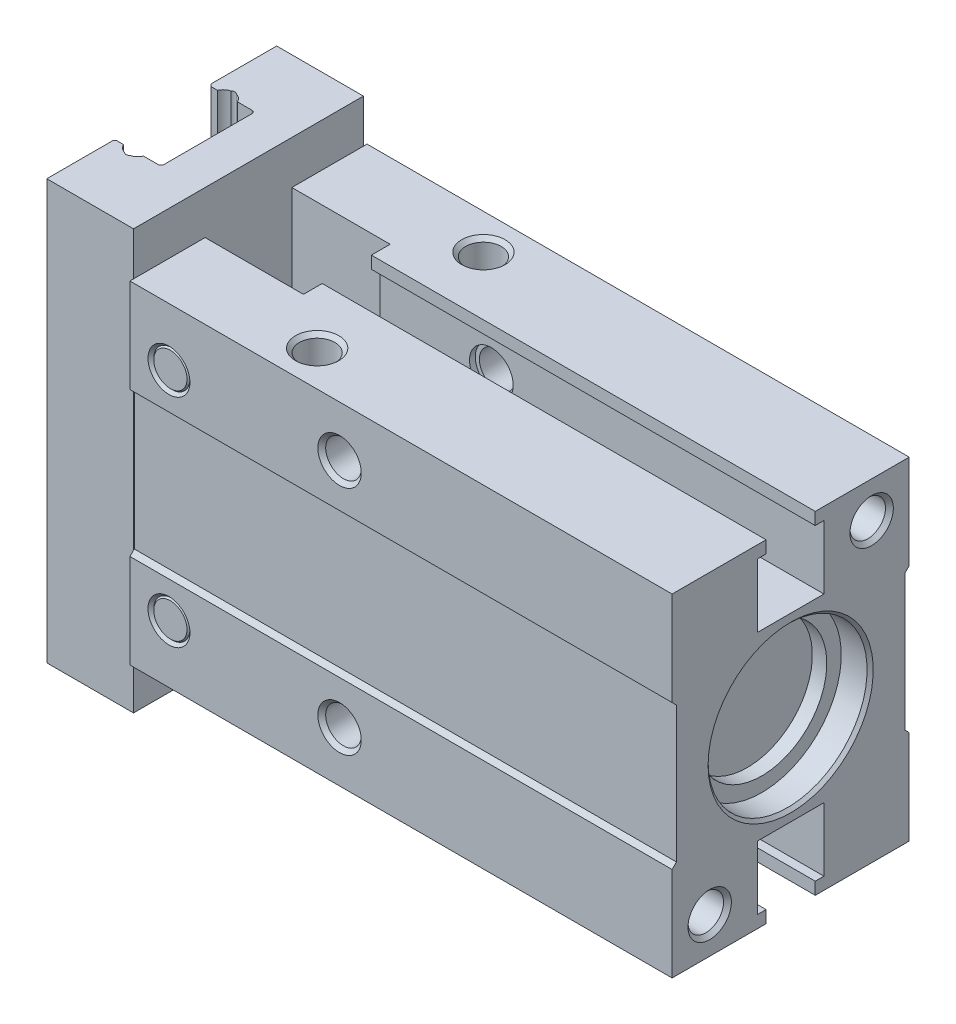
ISO-10303-21;
HEADER;
FILE_DESCRIPTION(('STEP AP214'),'2;1');
FILE_NAME('part.step','',(''),(''),'','','');
FILE_SCHEMA(('AUTOMOTIVE_DESIGN { 1 0 10303 214 1 1 1 1 }'));
ENDSEC;
DATA;
#1=APPLICATION_CONTEXT('core data for automotive mechanical design processes');
#2=APPLICATION_PROTOCOL_DEFINITION('international standard','automotive_design',2000,#1);
#3=PRODUCT_CONTEXT('',#1,'mechanical');
#4=PRODUCT('Part','Part','',(#3));
#5=PRODUCT_RELATED_PRODUCT_CATEGORY('part','',(#4));
#6=PRODUCT_DEFINITION_FORMATION('','',#4);
#7=PRODUCT_DEFINITION_CONTEXT('part definition',#1,'design');
#8=PRODUCT_DEFINITION('design','',#6,#7);
#9=PRODUCT_DEFINITION_SHAPE('','',#8);
#10=(LENGTH_UNIT() NAMED_UNIT(*) SI_UNIT(.MILLI.,.METRE.));
#11=(NAMED_UNIT(*) PLANE_ANGLE_UNIT() SI_UNIT($,.RADIAN.));
#12=(NAMED_UNIT(*) SI_UNIT($,.STERADIAN.) SOLID_ANGLE_UNIT());
#13=UNCERTAINTY_MEASURE_WITH_UNIT(LENGTH_MEASURE(1.E-05),#10,'distance_accuracy_value','');
#14=(GEOMETRIC_REPRESENTATION_CONTEXT(3) GLOBAL_UNCERTAINTY_ASSIGNED_CONTEXT((#13)) GLOBAL_UNIT_ASSIGNED_CONTEXT((#10,
#11,#12)) REPRESENTATION_CONTEXT('',''));
#15=CARTESIAN_POINT('',(0.,0.,0.));
#16=DIRECTION('',(0.,0.,1.));
#17=DIRECTION('',(1.,0.,0.));
#18=AXIS2_PLACEMENT_3D('',#15,#16,#17);
#19=CARTESIAN_POINT('',(-43.5,0.,0.));
#20=DIRECTION('',(1.,0.,0.));
#21=DIRECTION('',(0.,0.,-1.));
#22=AXIS2_PLACEMENT_3D('',#19,#20,#21);
#23=PLANE('',#22);
#24=DIRECTION('',(0.,0.,-1.));
#25=VECTOR('',#24,1.);
#26=CARTESIAN_POINT('',(-43.5,-14.5,7.95));
#27=LINE('',#26,#25);
#28=CARTESIAN_POINT('',(-43.5,-14.5,-3.39142135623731));
#29=VERTEX_POINT('',#28);
#30=CARTESIAN_POINT('',(-43.5,-14.5,-7.95));
#31=VERTEX_POINT('',#30);
#32=EDGE_CURVE('E406',#29,#31,#27,.T.);
#33=ORIENTED_EDGE('',*,*,#32,.F.);
#34=DIRECTION('',(0.,1.,0.));
#35=VECTOR('',#34,1.);
#36=CARTESIAN_POINT('',(-43.5,-14.5,-3.39142135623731));
#37=LINE('',#36,#35);
#38=CARTESIAN_POINT('',(-43.5,14.5,-3.39142135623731));
#39=VERTEX_POINT('',#38);
#40=EDGE_CURVE('E416',#29,#39,#37,.T.);
#41=ORIENTED_EDGE('',*,*,#40,.T.);
#42=DIRECTION('',(0.,0.,1.));
#43=VECTOR('',#42,1.);
#44=CARTESIAN_POINT('',(-43.5,14.5,-7.95));
#45=LINE('',#44,#43);
#46=CARTESIAN_POINT('',(-43.5,14.5,-7.95));
#47=VERTEX_POINT('',#46);
#48=EDGE_CURVE('E396',#47,#39,#45,.T.);
#49=ORIENTED_EDGE('',*,*,#48,.F.);
#50=DIRECTION('',(0.,1.,0.));
#51=VECTOR('',#50,1.);
#52=CARTESIAN_POINT('',(-43.5,-14.5,-7.95));
#53=LINE('',#52,#51);
#54=EDGE_CURVE('E409',#31,#47,#53,.T.);
#55=ORIENTED_EDGE('',*,*,#54,.F.);
#56=EDGE_LOOP('',(#33,#41,#49,#55));
#57=FACE_BOUND('',#56,.T.);
#58=ADVANCED_FACE('F16',(#57),#23,.F.);
#59=CARTESIAN_POINT('',(-37.5,0.,0.));
#60=DIRECTION('',(1.,0.,0.));
#61=DIRECTION('',(0.,0.,-1.));
#62=AXIS2_PLACEMENT_3D('',#59,#60,#61);
#63=PLANE('',#62);
#64=DIRECTION('',(0.,0.,-1.));
#65=VECTOR('',#64,1.);
#66=CARTESIAN_POINT('',(-37.5,-11.5,-1.7));
#67=LINE('',#66,#65);
#68=CARTESIAN_POINT('',(-37.5,-11.5,-7.95));
#69=VERTEX_POINT('',#68);
#70=CARTESIAN_POINT('',(-37.5,-11.5,-8.2));
#71=VERTEX_POINT('',#70);
#72=EDGE_CURVE('E571',#69,#71,#67,.T.);
#73=ORIENTED_EDGE('',*,*,#72,.F.);
#74=DIRECTION('',(0.,1.,0.));
#75=VECTOR('',#74,1.);
#76=CARTESIAN_POINT('',(-37.5,-14.5,-7.95));
#77=LINE('',#76,#75);
#78=CARTESIAN_POINT('',(-37.5,-4.75,-7.95));
#79=VERTEX_POINT('',#78);
#80=EDGE_CURVE('E401',#69,#79,#77,.T.);
#81=ORIENTED_EDGE('',*,*,#80,.T.);
#82=DIRECTION('',(0.,0.707106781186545,0.707106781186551));
#83=VECTOR('',#82,1.);
#84=CARTESIAN_POINT('',(-37.5,-5.,-8.2));
#85=LINE('',#84,#83);
#86=CARTESIAN_POINT('',(-37.5,-5.,-8.2));
#87=VERTEX_POINT('',#86);
#88=EDGE_CURVE('E578',#87,#79,#85,.T.);
#89=ORIENTED_EDGE('',*,*,#88,.F.);
#90=DIRECTION('',(0.,1.,0.));
#91=VECTOR('',#90,1.);
#92=CARTESIAN_POINT('',(-37.5,-11.5,-8.2));
#93=LINE('',#92,#91);
#94=EDGE_CURVE('E575',#71,#87,#93,.T.);
#95=ORIENTED_EDGE('',*,*,#94,.F.);
#96=EDGE_LOOP('',(#73,#81,#89,#95));
#97=FACE_BOUND('',#96,.T.);
#98=ADVANCED_FACE('F1109',(#97),#63,.F.);
#99=DIRECTION('',(0.,0.,1.));
#100=VECTOR('',#99,1.);
#101=CARTESIAN_POINT('',(-37.5,11.5,1.7));
#102=LINE('',#101,#100);
#103=CARTESIAN_POINT('',(-37.5,11.5,7.95));
#104=VERTEX_POINT('',#103);
#105=CARTESIAN_POINT('',(-37.5,11.5,8.2));
#106=VERTEX_POINT('',#105);
#107=EDGE_CURVE('E550',#104,#106,#102,.T.);
#108=ORIENTED_EDGE('',*,*,#107,.F.);
#109=DIRECTION('',(0.,-1.,0.));
#110=VECTOR('',#109,1.);
#111=CARTESIAN_POINT('',(-37.5,14.5,7.95));
#112=LINE('',#111,#110);
#113=CARTESIAN_POINT('',(-37.5,4.75,7.95));
#114=VERTEX_POINT('',#113);
#115=EDGE_CURVE('E11',#104,#114,#112,.T.);
#116=ORIENTED_EDGE('',*,*,#115,.T.);
#117=DIRECTION('',(0.,-0.707106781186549,-0.707106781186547));
#118=VECTOR('',#117,1.);
#119=CARTESIAN_POINT('',(-37.5,5.,8.2));
#120=LINE('',#119,#118);
#121=CARTESIAN_POINT('',(-37.5,5.,8.2));
#122=VERTEX_POINT('',#121);
#123=EDGE_CURVE('E554',#122,#114,#120,.T.);
#124=ORIENTED_EDGE('',*,*,#123,.F.);
#125=DIRECTION('',(0.,-1.,0.));
#126=VECTOR('',#125,1.);
#127=CARTESIAN_POINT('',(-37.5,11.5,8.2));
#128=LINE('',#127,#126);
#129=EDGE_CURVE('E549',#106,#122,#128,.T.);
#130=ORIENTED_EDGE('',*,*,#129,.F.);
#131=EDGE_LOOP('',(#108,#116,#124,#130));
#132=FACE_BOUND('',#131,.T.);
#133=ADVANCED_FACE('F930',(#132),#63,.F.);
#134=DIRECTION('',(0.,0.707106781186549,-0.707106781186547));
#135=VECTOR('',#134,1.);
#136=CARTESIAN_POINT('',(-37.5,4.7,-7.9));
#137=LINE('',#136,#135);
#138=CARTESIAN_POINT('',(-37.5,4.75,-7.95));
#139=VERTEX_POINT('',#138);
#140=CARTESIAN_POINT('',(-37.5,5.,-8.2));
#141=VERTEX_POINT('',#140);
#142=EDGE_CURVE('E584',#139,#141,#137,.T.);
#143=ORIENTED_EDGE('',*,*,#142,.F.);
#144=CARTESIAN_POINT('',(-37.5,11.5,-7.95));
#145=VERTEX_POINT('',#144);
#146=EDGE_CURVE('E786',#139,#145,#77,.T.);
#147=ORIENTED_EDGE('',*,*,#146,.T.);
#148=DIRECTION('',(0.,0.,1.));
#149=VECTOR('',#148,1.);
#150=CARTESIAN_POINT('',(-37.5,11.5,-8.2));
#151=LINE('',#150,#149);
#152=CARTESIAN_POINT('',(-37.5,11.5,-8.2));
#153=VERTEX_POINT('',#152);
#154=EDGE_CURVE('E591',#153,#145,#151,.T.);
#155=ORIENTED_EDGE('',*,*,#154,.F.);
#156=DIRECTION('',(0.,1.,0.));
#157=VECTOR('',#156,1.);
#158=CARTESIAN_POINT('',(-37.5,5.,-8.2));
#159=LINE('',#158,#157);
#160=EDGE_CURVE('E588',#141,#153,#159,.T.);
#161=ORIENTED_EDGE('',*,*,#160,.F.);
#162=EDGE_LOOP('',(#143,#147,#155,#161));
#163=FACE_BOUND('',#162,.T.);
#164=ADVANCED_FACE('F784',(#163),#63,.F.);
#165=CARTESIAN_POINT('',(-37.5,11.5,1.7));
#166=DIRECTION('',(0.,1.,0.));
#167=DIRECTION('',(0.,0.,1.));
#168=AXIS2_PLACEMENT_3D('',#165,#166,#167);
#169=PLANE('',#168);
#170=CARTESIAN_POINT('',(-27.,11.5,5.75));
#171=DIRECTION('',(0.,-1.,0.));
#172=DIRECTION('',(0.,0.,-1.));
#173=AXIS2_PLACEMENT_3D('',#170,#171,#172);
#174=CIRCLE('',#173,1.5);
#175=CARTESIAN_POINT('',(-27.,11.5,4.25));
#176=VERTEX_POINT('',#175);
#177=EDGE_CURVE('E2462',#176,#176,#174,.T.);
#178=ORIENTED_EDGE('',*,*,#177,.T.);
#179=EDGE_LOOP('',(#178));
#180=FACE_BOUND('',#179,.T.);
#181=DIRECTION('',(0.,0.,-1.));
#182=VECTOR('',#181,1.);
#183=CARTESIAN_POINT('',(-30.7,11.5,3.));
#184=LINE('',#183,#182);
#185=CARTESIAN_POINT('',(-30.7,11.5,3.));
#186=VERTEX_POINT('',#185);
#187=CARTESIAN_POINT('',(-30.7,11.5,1.7));
#188=VERTEX_POINT('',#187);
#189=EDGE_CURVE('E495',#186,#188,#184,.T.);
#190=ORIENTED_EDGE('',*,*,#189,.F.);
#191=DIRECTION('',(1.,0.,0.));
#192=VECTOR('',#191,1.);
#193=CARTESIAN_POINT('',(-37.5,11.5,3.));
#194=LINE('',#193,#192);
#195=CARTESIAN_POINT('',(-37.5,11.5,3.));
#196=VERTEX_POINT('',#195);
#197=EDGE_CURVE('E491',#196,#186,#194,.T.);
#198=ORIENTED_EDGE('',*,*,#197,.F.);
#199=EDGE_CURVE('E546',#196,#104,#102,.T.);
#200=ORIENTED_EDGE('',*,*,#199,.T.);
#201=ORIENTED_EDGE('',*,*,#107,.T.);
#202=DIRECTION('',(1.,0.,0.));
#203=VECTOR('',#202,1.);
#204=CARTESIAN_POINT('',(-37.5,11.5,8.2));
#205=LINE('',#204,#203);
#206=CARTESIAN_POINT('',(0.,11.5,8.2));
#207=VERTEX_POINT('',#206);
#208=EDGE_CURVE('E594',#106,#207,#205,.T.);
#209=ORIENTED_EDGE('',*,*,#208,.T.);
#210=DIRECTION('',(0.,0.,1.));
#211=VECTOR('',#210,1.);
#212=CARTESIAN_POINT('',(0.,11.5,1.7));
#213=LINE('',#212,#211);
#214=CARTESIAN_POINT('',(0.,11.5,1.7));
#215=VERTEX_POINT('',#214);
#216=EDGE_CURVE('E545',#215,#207,#213,.T.);
#217=ORIENTED_EDGE('',*,*,#216,.F.);
#218=DIRECTION('',(1.,0.,0.));
#219=VECTOR('',#218,1.);
#220=CARTESIAN_POINT('',(-37.5,11.5,1.7));
#221=LINE('',#220,#219);
#222=EDGE_CURVE('E678',#188,#215,#221,.T.);
#223=ORIENTED_EDGE('',*,*,#222,.F.);
#224=EDGE_LOOP('',(#190,#198,#200,#201,#209,#217,#223));
#225=FACE_BOUND('',#224,.T.);
#226=ADVANCED_FACE('F18',(#180,#225),#169,.T.);
#227=CARTESIAN_POINT('',(-37.5,10.65,1.7));
#228=DIRECTION('',(0.,0.,-1.));
#229=DIRECTION('',(-1.,0.,0.));
#230=AXIS2_PLACEMENT_3D('',#227,#228,#229);
#231=PLANE('',#230);
#232=DIRECTION('',(0.,-1.,0.));
#233=VECTOR('',#232,1.);
#234=CARTESIAN_POINT('',(-30.7,10.65,1.7));
#235=LINE('',#234,#233);
#236=CARTESIAN_POINT('',(-30.7,10.65,1.7));
#237=VERTEX_POINT('',#236);
#238=EDGE_CURVE('E543',#188,#237,#235,.T.);
#239=ORIENTED_EDGE('',*,*,#238,.F.);
#240=ORIENTED_EDGE('',*,*,#222,.T.);
#241=DIRECTION('',(0.,1.,0.));
#242=VECTOR('',#241,1.);
#243=CARTESIAN_POINT('',(0.,10.65,1.7));
#244=LINE('',#243,#242);
#245=CARTESIAN_POINT('',(0.,10.65,1.7));
#246=VERTEX_POINT('',#245);
#247=EDGE_CURVE('E675',#246,#215,#244,.T.);
#248=ORIENTED_EDGE('',*,*,#247,.F.);
#249=DIRECTION('',(1.,0.,0.));
#250=VECTOR('',#249,1.);
#251=CARTESIAN_POINT('',(-37.5,10.65,1.7));
#252=LINE('',#251,#250);
#253=EDGE_CURVE('E680',#237,#246,#252,.T.);
#254=ORIENTED_EDGE('',*,*,#253,.F.);
#255=EDGE_LOOP('',(#239,#240,#248,#254));
#256=FACE_BOUND('',#255,.T.);
#257=ADVANCED_FACE('F823',(#256),#231,.T.);
#258=CARTESIAN_POINT('',(-37.5,10.65,2.3));
#259=DIRECTION('',(0.,-1.,0.));
#260=DIRECTION('',(0.,0.,-1.));
#261=AXIS2_PLACEMENT_3D('',#258,#259,#260);
#262=PLANE('',#261);
#263=DIRECTION('',(0.,0.,1.));
#264=VECTOR('',#263,1.);
#265=CARTESIAN_POINT('',(-30.7,10.65,2.3));
#266=LINE('',#265,#264);
#267=CARTESIAN_POINT('',(-30.7,10.65,2.3));
#268=VERTEX_POINT('',#267);
#269=EDGE_CURVE('E541',#237,#268,#266,.T.);
#270=ORIENTED_EDGE('',*,*,#269,.F.);
#271=ORIENTED_EDGE('',*,*,#253,.T.);
#272=DIRECTION('',(0.,0.,-1.));
#273=VECTOR('',#272,1.);
#274=CARTESIAN_POINT('',(0.,10.65,2.3));
#275=LINE('',#274,#273);
#276=CARTESIAN_POINT('',(0.,10.65,2.3));
#277=VERTEX_POINT('',#276);
#278=EDGE_CURVE('E672',#277,#246,#275,.T.);
#279=ORIENTED_EDGE('',*,*,#278,.F.);
#280=DIRECTION('',(1.,0.,0.));
#281=VECTOR('',#280,1.);
#282=CARTESIAN_POINT('',(-37.5,10.65,2.3));
#283=LINE('',#282,#281);
#284=EDGE_CURVE('E682',#268,#277,#283,.T.);
#285=ORIENTED_EDGE('',*,*,#284,.F.);
#286=EDGE_LOOP('',(#270,#271,#279,#285));
#287=FACE_BOUND('',#286,.T.);
#288=ADVANCED_FACE('F818',(#287),#262,.T.);
#289=CARTESIAN_POINT('',(-37.5,6.25,2.3));
#290=DIRECTION('',(0.,0.,-1.));
#291=DIRECTION('',(-1.,0.,0.));
#292=AXIS2_PLACEMENT_3D('',#289,#290,#291);
#293=PLANE('',#292);
#294=CARTESIAN_POINT('',(-23.,8.,2.3));
#295=DIRECTION('',(0.,0.,-1.));
#296=DIRECTION('',(-1.,0.,0.));
#297=AXIS2_PLACEMENT_3D('',#294,#295,#296);
#298=CIRCLE('',#297,1.51);
#299=CARTESIAN_POINT('',(-24.51,8.,2.3));
#300=VERTEX_POINT('',#299);
#301=EDGE_CURVE('E485',#300,#300,#298,.F.);
#302=ORIENTED_EDGE('',*,*,#301,.T.);
#303=EDGE_LOOP('',(#302));
#304=FACE_BOUND('',#303,.T.);
#305=DIRECTION('',(0.,-1.,0.));
#306=VECTOR('',#305,1.);
#307=CARTESIAN_POINT('',(-30.7,6.25,2.3));
#308=LINE('',#307,#306);
#309=CARTESIAN_POINT('',(-30.7,6.25,2.3));
#310=VERTEX_POINT('',#309);
#311=EDGE_CURVE('E539',#268,#310,#308,.T.);
#312=ORIENTED_EDGE('',*,*,#311,.F.);
#313=ORIENTED_EDGE('',*,*,#284,.T.);
#314=DIRECTION('',(0.,1.,0.));
#315=VECTOR('',#314,1.);
#316=CARTESIAN_POINT('',(0.,6.25,2.3));
#317=LINE('',#316,#315);
#318=CARTESIAN_POINT('',(0.,6.25,2.3));
#319=VERTEX_POINT('',#318);
#320=EDGE_CURVE('E669',#319,#277,#317,.T.);
#321=ORIENTED_EDGE('',*,*,#320,.F.);
#322=DIRECTION('',(1.,0.,0.));
#323=VECTOR('',#322,1.);
#324=CARTESIAN_POINT('',(-37.5,6.25,2.3));
#325=LINE('',#324,#323);
#326=EDGE_CURVE('E684',#310,#319,#325,.T.);
#327=ORIENTED_EDGE('',*,*,#326,.F.);
#328=EDGE_LOOP('',(#312,#313,#321,#327));
#329=FACE_BOUND('',#328,.T.);
#330=ADVANCED_FACE('F813',(#304,#329),#293,.T.);
#331=CARTESIAN_POINT('',(-37.5,6.25,-2.3));
#332=DIRECTION('',(0.,1.,0.));
#333=DIRECTION('',(0.,0.,1.));
#334=AXIS2_PLACEMENT_3D('',#331,#332,#333);
#335=PLANE('',#334);
#336=DIRECTION('',(0.,0.,-1.));
#337=VECTOR('',#336,1.);
#338=CARTESIAN_POINT('',(-30.7,6.25,-2.3));
#339=LINE('',#338,#337);
#340=CARTESIAN_POINT('',(-30.7,6.25,-2.3));
#341=VERTEX_POINT('',#340);
#342=EDGE_CURVE('E537',#310,#341,#339,.T.);
#343=ORIENTED_EDGE('',*,*,#342,.F.);
#344=ORIENTED_EDGE('',*,*,#326,.T.);
#345=DIRECTION('',(0.,0.,1.));
#346=VECTOR('',#345,1.);
#347=CARTESIAN_POINT('',(0.,6.25,-2.3));
#348=LINE('',#347,#346);
#349=CARTESIAN_POINT('',(0.,6.25,-2.3));
#350=VERTEX_POINT('',#349);
#351=EDGE_CURVE('E666',#350,#319,#348,.T.);
#352=ORIENTED_EDGE('',*,*,#351,.F.);
#353=DIRECTION('',(1.,0.,0.));
#354=VECTOR('',#353,1.);
#355=CARTESIAN_POINT('',(-37.5,6.25,-2.3));
#356=LINE('',#355,#354);
#357=EDGE_CURVE('E686',#341,#350,#356,.T.);
#358=ORIENTED_EDGE('',*,*,#357,.F.);
#359=EDGE_LOOP('',(#343,#344,#352,#358));
#360=FACE_BOUND('',#359,.T.);
#361=ADVANCED_FACE('F809',(#360),#335,.T.);
#362=CARTESIAN_POINT('',(-37.5,10.65,-2.3));
#363=DIRECTION('',(0.,0.,1.));
#364=DIRECTION('',(1.,0.,0.));
#365=AXIS2_PLACEMENT_3D('',#362,#363,#364);
#366=PLANE('',#365);
#367=CARTESIAN_POINT('',(-23.,8.,-2.3));
#368=DIRECTION('',(0.,0.,1.));
#369=DIRECTION('',(1.,0.,0.));
#370=AXIS2_PLACEMENT_3D('',#367,#368,#369);
#371=CIRCLE('',#370,1.51);
#372=CARTESIAN_POINT('',(-21.49,8.,-2.3));
#373=VERTEX_POINT('',#372);
#374=EDGE_CURVE('E484',#373,#373,#371,.F.);
#375=ORIENTED_EDGE('',*,*,#374,.T.);
#376=EDGE_LOOP('',(#375));
#377=FACE_BOUND('',#376,.T.);
#378=DIRECTION('',(0.,1.,0.));
#379=VECTOR('',#378,1.);
#380=CARTESIAN_POINT('',(-30.7,10.65,-2.3));
#381=LINE('',#380,#379);
#382=CARTESIAN_POINT('',(-30.7,10.65,-2.3));
#383=VERTEX_POINT('',#382);
#384=EDGE_CURVE('E535',#341,#383,#381,.T.);
#385=ORIENTED_EDGE('',*,*,#384,.F.);
#386=ORIENTED_EDGE('',*,*,#357,.T.);
#387=DIRECTION('',(0.,-1.,0.));
#388=VECTOR('',#387,1.);
#389=CARTESIAN_POINT('',(0.,10.65,-2.3));
#390=LINE('',#389,#388);
#391=CARTESIAN_POINT('',(0.,10.65,-2.3));
#392=VERTEX_POINT('',#391);
#393=EDGE_CURVE('E663',#392,#350,#390,.T.);
#394=ORIENTED_EDGE('',*,*,#393,.F.);
#395=DIRECTION('',(1.,0.,0.));
#396=VECTOR('',#395,1.);
#397=CARTESIAN_POINT('',(-37.5,10.65,-2.3));
#398=LINE('',#397,#396);
#399=EDGE_CURVE('E688',#383,#392,#398,.T.);
#400=ORIENTED_EDGE('',*,*,#399,.F.);
#401=EDGE_LOOP('',(#385,#386,#394,#400));
#402=FACE_BOUND('',#401,.T.);
#403=ADVANCED_FACE('F735',(#377,#402),#366,.T.);
#404=CARTESIAN_POINT('',(-37.5,10.65,-1.7));
#405=DIRECTION('',(0.,-1.,0.));
#406=DIRECTION('',(0.,0.,-1.));
#407=AXIS2_PLACEMENT_3D('',#404,#405,#406);
#408=PLANE('',#407);
#409=DIRECTION('',(0.,0.,1.));
#410=VECTOR('',#409,1.);
#411=CARTESIAN_POINT('',(-30.7,10.65,-1.7));
#412=LINE('',#411,#410);
#413=CARTESIAN_POINT('',(-30.7,10.65,-1.7));
#414=VERTEX_POINT('',#413);
#415=EDGE_CURVE('E533',#383,#414,#412,.T.);
#416=ORIENTED_EDGE('',*,*,#415,.F.);
#417=ORIENTED_EDGE('',*,*,#399,.T.);
#418=DIRECTION('',(0.,0.,-1.));
#419=VECTOR('',#418,1.);
#420=CARTESIAN_POINT('',(0.,10.65,-1.7));
#421=LINE('',#420,#419);
#422=CARTESIAN_POINT('',(0.,10.65,-1.7));
#423=VERTEX_POINT('',#422);
#424=EDGE_CURVE('E660',#423,#392,#421,.T.);
#425=ORIENTED_EDGE('',*,*,#424,.F.);
#426=DIRECTION('',(1.,0.,0.));
#427=VECTOR('',#426,1.);
#428=CARTESIAN_POINT('',(-37.5,10.65,-1.7));
#429=LINE('',#428,#427);
#430=EDGE_CURVE('E690',#414,#423,#429,.T.);
#431=ORIENTED_EDGE('',*,*,#430,.F.);
#432=EDGE_LOOP('',(#416,#417,#425,#431));
#433=FACE_BOUND('',#432,.T.);
#434=ADVANCED_FACE('F800',(#433),#408,.T.);
#435=CARTESIAN_POINT('',(-37.5,11.5,-1.7));
#436=DIRECTION('',(0.,0.,1.));
#437=DIRECTION('',(1.,0.,0.));
#438=AXIS2_PLACEMENT_3D('',#435,#436,#437);
#439=PLANE('',#438);
#440=DIRECTION('',(0.,1.,0.));
#441=VECTOR('',#440,1.);
#442=CARTESIAN_POINT('',(-30.7,11.5,-1.7));
#443=LINE('',#442,#441);
#444=CARTESIAN_POINT('',(-30.7,11.5,-1.7));
#445=VERTEX_POINT('',#444);
#446=EDGE_CURVE('E531',#414,#445,#443,.T.);
#447=ORIENTED_EDGE('',*,*,#446,.F.);
#448=ORIENTED_EDGE('',*,*,#430,.T.);
#449=DIRECTION('',(0.,-1.,0.));
#450=VECTOR('',#449,1.);
#451=CARTESIAN_POINT('',(0.,11.5,-1.7));
#452=LINE('',#451,#450);
#453=CARTESIAN_POINT('',(0.,11.5,-1.7));
#454=VERTEX_POINT('',#453);
#455=EDGE_CURVE('E657',#454,#423,#452,.T.);
#456=ORIENTED_EDGE('',*,*,#455,.F.);
#457=DIRECTION('',(1.,0.,0.));
#458=VECTOR('',#457,1.);
#459=CARTESIAN_POINT('',(-37.5,11.5,-1.7));
#460=LINE('',#459,#458);
#461=EDGE_CURVE('E692',#445,#454,#460,.T.);
#462=ORIENTED_EDGE('',*,*,#461,.F.);
#463=EDGE_LOOP('',(#447,#448,#456,#462));
#464=FACE_BOUND('',#463,.T.);
#465=ADVANCED_FACE('F796',(#464),#439,.T.);
#466=CARTESIAN_POINT('',(-37.5,11.5,-8.2));
#467=DIRECTION('',(0.,1.,0.));
#468=DIRECTION('',(0.,0.,1.));
#469=AXIS2_PLACEMENT_3D('',#466,#467,#468);
#470=PLANE('',#469);
#471=CARTESIAN_POINT('',(-27.,11.5,-5.75));
#472=DIRECTION('',(0.,-1.,0.));
#473=DIRECTION('',(0.,0.,-1.));
#474=AXIS2_PLACEMENT_3D('',#471,#472,#473);
#475=CIRCLE('',#474,1.5);
#476=CARTESIAN_POINT('',(-27.,11.5,-7.25));
#477=VERTEX_POINT('',#476);
#478=EDGE_CURVE('E2615',#477,#477,#475,.T.);
#479=ORIENTED_EDGE('',*,*,#478,.T.);
#480=EDGE_LOOP('',(#479));
#481=FACE_BOUND('',#480,.T.);
#482=DIRECTION('',(-1.,0.,0.));
#483=VECTOR('',#482,1.);
#484=CARTESIAN_POINT('',(-30.7,11.5,-3.));
#485=LINE('',#484,#483);
#486=CARTESIAN_POINT('',(-30.7,11.5,-3.));
#487=VERTEX_POINT('',#486);
#488=CARTESIAN_POINT('',(-37.5,11.5,-3.));
#489=VERTEX_POINT('',#488);
#490=EDGE_CURVE('E488',#487,#489,#485,.T.);
#491=ORIENTED_EDGE('',*,*,#490,.F.);
#492=EDGE_CURVE('E494',#445,#487,#184,.T.);
#493=ORIENTED_EDGE('',*,*,#492,.F.);
#494=ORIENTED_EDGE('',*,*,#461,.T.);
#495=DIRECTION('',(0.,0.,1.));
#496=VECTOR('',#495,1.);
#497=CARTESIAN_POINT('',(0.,11.5,-8.2));
#498=LINE('',#497,#496);
#499=CARTESIAN_POINT('',(0.,11.5,-8.2));
#500=VERTEX_POINT('',#499);
#501=EDGE_CURVE('E654',#500,#454,#498,.T.);
#502=ORIENTED_EDGE('',*,*,#501,.F.);
#503=DIRECTION('',(1.,0.,0.));
#504=VECTOR('',#503,1.);
#505=CARTESIAN_POINT('',(-37.5,11.5,-8.2));
#506=LINE('',#505,#504);
#507=EDGE_CURVE('E694',#153,#500,#506,.T.);
#508=ORIENTED_EDGE('',*,*,#507,.F.);
#509=ORIENTED_EDGE('',*,*,#154,.T.);
#510=EDGE_CURVE('E436',#145,#489,#151,.T.);
#511=ORIENTED_EDGE('',*,*,#510,.T.);
#512=EDGE_LOOP('',(#491,#493,#494,#502,#508,#509,#511));
#513=FACE_BOUND('',#512,.T.);
#514=ADVANCED_FACE('F768',(#481,#513),#470,.T.);
#515=CARTESIAN_POINT('',(-37.5,5.,-8.2));
#516=DIRECTION('',(0.,0.,-1.));
#517=DIRECTION('',(-1.,0.,0.));
#518=AXIS2_PLACEMENT_3D('',#515,#516,#517);
#519=PLANE('',#518);
#520=CARTESIAN_POINT('',(-34.8,7.5,-8.2));
#521=DIRECTION('',(0.,0.,1.));
#522=DIRECTION('',(1.,0.,0.));
#523=AXIS2_PLACEMENT_3D('',#520,#521,#522);
#524=CIRCLE('',#523,1.45);
#525=CARTESIAN_POINT('',(-33.35,7.5,-8.2));
#526=VERTEX_POINT('',#525);
#527=EDGE_CURVE('E2535',#526,#526,#524,.T.);
#528=ORIENTED_EDGE('',*,*,#527,.T.);
#529=EDGE_LOOP('',(#528));
#530=FACE_BOUND('',#529,.T.);
#531=CARTESIAN_POINT('',(-23.,8.,-8.2));
#532=DIRECTION('',(0.,0.,1.));
#533=DIRECTION('',(1.,0.,0.));
#534=AXIS2_PLACEMENT_3D('',#531,#532,#533);
#535=CIRCLE('',#534,1.5);
#536=CARTESIAN_POINT('',(-21.5,8.,-8.2));
#537=VERTEX_POINT('',#536);
#538=EDGE_CURVE('E460',#537,#537,#535,.T.);
#539=ORIENTED_EDGE('',*,*,#538,.T.);
#540=EDGE_LOOP('',(#539));
#541=FACE_BOUND('',#540,.T.);
#542=DIRECTION('',(0.,1.,0.));
#543=VECTOR('',#542,1.);
#544=CARTESIAN_POINT('',(0.,5.,-8.2));
#545=LINE('',#544,#543);
#546=CARTESIAN_POINT('',(0.,5.,-8.2));
#547=VERTEX_POINT('',#546);
#548=EDGE_CURVE('E651',#547,#500,#545,.T.);
#549=ORIENTED_EDGE('',*,*,#548,.F.);
#550=DIRECTION('',(1.,0.,0.));
#551=VECTOR('',#550,1.);
#552=CARTESIAN_POINT('',(-37.5,5.,-8.2));
#553=LINE('',#552,#551);
#554=EDGE_CURVE('E696',#141,#547,#553,.T.);
#555=ORIENTED_EDGE('',*,*,#554,.F.);
#556=ORIENTED_EDGE('',*,*,#160,.T.);
#557=ORIENTED_EDGE('',*,*,#507,.T.);
#558=EDGE_LOOP('',(#549,#555,#556,#557));
#559=FACE_BOUND('',#558,.T.);
#560=ADVANCED_FACE('F764',(#530,#541,#559),#519,.T.);
#561=CARTESIAN_POINT('',(-37.5,4.7,-7.9));
#562=DIRECTION('',(0.,-0.707106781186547,-0.707106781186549));
#563=DIRECTION('',(0.,0.707106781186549,-0.707106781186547));
#564=AXIS2_PLACEMENT_3D('',#561,#562,#563);
#565=PLANE('',#564);
#566=DIRECTION('',(0.,0.707106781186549,-0.707106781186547));
#567=VECTOR('',#566,1.);
#568=CARTESIAN_POINT('',(0.,4.7,-7.9));
#569=LINE('',#568,#567);
#570=CARTESIAN_POINT('',(0.,4.7,-7.9));
#571=VERTEX_POINT('',#570);
#572=EDGE_CURVE('E648',#571,#547,#569,.T.);
#573=ORIENTED_EDGE('',*,*,#572,.F.);
#574=DIRECTION('',(1.,0.,0.));
#575=VECTOR('',#574,1.);
#576=CARTESIAN_POINT('',(-37.5,4.7,-7.9));
#577=LINE('',#576,#575);
#578=CARTESIAN_POINT('',(-37.5,4.7,-7.9));
#579=VERTEX_POINT('',#578);
#580=EDGE_CURVE('E698',#579,#571,#577,.T.);
#581=ORIENTED_EDGE('',*,*,#580,.F.);
#582=EDGE_CURVE('E585',#579,#139,#137,.T.);
#583=ORIENTED_EDGE('',*,*,#582,.T.);
#584=ORIENTED_EDGE('',*,*,#142,.T.);
#585=ORIENTED_EDGE('',*,*,#554,.T.);
#586=EDGE_LOOP('',(#573,#581,#583,#584,#585));
#587=FACE_BOUND('',#586,.T.);
#588=ADVANCED_FACE('F767',(#587),#565,.T.);
#589=CARTESIAN_POINT('',(-37.5,-4.7,-7.9));
#590=DIRECTION('',(0.,0.,-1.));
#591=DIRECTION('',(-1.,0.,0.));
#592=AXIS2_PLACEMENT_3D('',#589,#590,#591);
#593=PLANE('',#592);
#594=DIRECTION('',(0.,1.,0.));
#595=VECTOR('',#594,1.);
#596=CARTESIAN_POINT('',(0.,-4.7,-7.9));
#597=LINE('',#596,#595);
#598=CARTESIAN_POINT('',(0.,-4.7,-7.9));
#599=VERTEX_POINT('',#598);
#600=EDGE_CURVE('E645',#599,#571,#597,.T.);
#601=ORIENTED_EDGE('',*,*,#600,.F.);
#602=DIRECTION('',(1.,0.,0.));
#603=VECTOR('',#602,1.);
#604=CARTESIAN_POINT('',(-37.5,-4.7,-7.9));
#605=LINE('',#604,#603);
#606=CARTESIAN_POINT('',(-37.5,-4.7,-7.9));
#607=VERTEX_POINT('',#606);
#608=EDGE_CURVE('E700',#607,#599,#605,.T.);
#609=ORIENTED_EDGE('',*,*,#608,.F.);
#610=DIRECTION('',(0.,1.,0.));
#611=VECTOR('',#610,1.);
#612=CARTESIAN_POINT('',(-37.5,-4.7,-7.9));
#613=LINE('',#612,#611);
#614=EDGE_CURVE('E581',#607,#579,#613,.T.);
#615=ORIENTED_EDGE('',*,*,#614,.T.);
#616=ORIENTED_EDGE('',*,*,#580,.T.);
#617=EDGE_LOOP('',(#601,#609,#615,#616));
#618=FACE_BOUND('',#617,.T.);
#619=ADVANCED_FACE('F909',(#618),#593,.T.);
#620=CARTESIAN_POINT('',(-37.5,-5.,-8.2));
#621=DIRECTION('',(0.,0.707106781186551,-0.707106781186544));
#622=DIRECTION('',(0.,0.707106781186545,0.707106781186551));
#623=AXIS2_PLACEMENT_3D('',#620,#621,#622);
#624=PLANE('',#623);
#625=DIRECTION('',(0.,0.707106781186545,0.707106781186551));
#626=VECTOR('',#625,1.);
#627=CARTESIAN_POINT('',(0.,-5.,-8.2));
#628=LINE('',#627,#626);
#629=CARTESIAN_POINT('',(0.,-5.,-8.2));
#630=VERTEX_POINT('',#629);
#631=EDGE_CURVE('E642',#630,#599,#628,.T.);
#632=ORIENTED_EDGE('',*,*,#631,.F.);
#633=DIRECTION('',(1.,0.,0.));
#634=VECTOR('',#633,1.);
#635=CARTESIAN_POINT('',(-37.5,-5.,-8.2));
#636=LINE('',#635,#634);
#637=EDGE_CURVE('E702',#87,#630,#636,.T.);
#638=ORIENTED_EDGE('',*,*,#637,.F.);
#639=ORIENTED_EDGE('',*,*,#88,.T.);
#640=EDGE_CURVE('E425',#79,#607,#85,.T.);
#641=ORIENTED_EDGE('',*,*,#640,.T.);
#642=ORIENTED_EDGE('',*,*,#608,.T.);
#643=EDGE_LOOP('',(#632,#638,#639,#641,#642));
#644=FACE_BOUND('',#643,.T.);
#645=ADVANCED_FACE('F904',(#644),#624,.T.);
#646=CARTESIAN_POINT('',(-37.5,-11.5,-8.2));
#647=DIRECTION('',(0.,0.,-1.));
#648=DIRECTION('',(-1.,0.,0.));
#649=AXIS2_PLACEMENT_3D('',#646,#647,#648);
#650=PLANE('',#649);
#651=CARTESIAN_POINT('',(-34.8,-7.5,-8.2));
#652=DIRECTION('',(0.,0.,1.));
#653=DIRECTION('',(1.,0.,0.));
#654=AXIS2_PLACEMENT_3D('',#651,#652,#653);
#655=CIRCLE('',#654,1.45);
#656=CARTESIAN_POINT('',(-33.35,-7.5,-8.2));
#657=VERTEX_POINT('',#656);
#658=EDGE_CURVE('E2519',#657,#657,#655,.T.);
#659=ORIENTED_EDGE('',*,*,#658,.T.);
#660=EDGE_LOOP('',(#659));
#661=FACE_BOUND('',#660,.T.);
#662=CARTESIAN_POINT('',(-23.,-8.,-8.2));
#663=DIRECTION('',(0.,0.,1.));
#664=DIRECTION('',(1.,0.,0.));
#665=AXIS2_PLACEMENT_3D('',#662,#663,#664);
#666=CIRCLE('',#665,1.5);
#667=CARTESIAN_POINT('',(-21.5,-8.,-8.2));
#668=VERTEX_POINT('',#667);
#669=EDGE_CURVE('E432',#668,#668,#666,.T.);
#670=ORIENTED_EDGE('',*,*,#669,.T.);
#671=EDGE_LOOP('',(#670));
#672=FACE_BOUND('',#671,.T.);
#673=DIRECTION('',(0.,1.,0.));
#674=VECTOR('',#673,1.);
#675=CARTESIAN_POINT('',(0.,-11.5,-8.2));
#676=LINE('',#675,#674);
#677=CARTESIAN_POINT('',(0.,-11.5,-8.2));
#678=VERTEX_POINT('',#677);
#679=EDGE_CURVE('E639',#678,#630,#676,.T.);
#680=ORIENTED_EDGE('',*,*,#679,.F.);
#681=DIRECTION('',(1.,0.,0.));
#682=VECTOR('',#681,1.);
#683=CARTESIAN_POINT('',(-37.5,-11.5,-8.2));
#684=LINE('',#683,#682);
#685=EDGE_CURVE('E704',#71,#678,#684,.T.);
#686=ORIENTED_EDGE('',*,*,#685,.F.);
#687=ORIENTED_EDGE('',*,*,#94,.T.);
#688=ORIENTED_EDGE('',*,*,#637,.T.);
#689=EDGE_LOOP('',(#680,#686,#687,#688));
#690=FACE_BOUND('',#689,.T.);
#691=ADVANCED_FACE('F901',(#661,#672,#690),#650,.T.);
#692=CARTESIAN_POINT('',(-37.5,-11.5,-1.7));
#693=DIRECTION('',(0.,-1.,0.));
#694=DIRECTION('',(0.,0.,-1.));
#695=AXIS2_PLACEMENT_3D('',#692,#693,#694);
#696=PLANE('',#695);
#697=CARTESIAN_POINT('',(-7.5,-11.5,-5.));
#698=DIRECTION('',(0.,1.,0.));
#699=DIRECTION('',(0.,0.,1.));
#700=AXIS2_PLACEMENT_3D('',#697,#698,#699);
#701=CIRCLE('',#700,1.5);
#702=CARTESIAN_POINT('',(-7.5,-11.5,-3.5));
#703=VERTEX_POINT('',#702);
#704=EDGE_CURVE('E2480',#703,#703,#701,.T.);
#705=ORIENTED_EDGE('',*,*,#704,.T.);
#706=EDGE_LOOP('',(#705));
#707=FACE_BOUND('',#706,.T.);
#708=DIRECTION('',(-1.,0.,0.));
#709=VECTOR('',#708,1.);
#710=CARTESIAN_POINT('',(-30.7,-11.5,-3.));
#711=LINE('',#710,#709);
#712=CARTESIAN_POINT('',(-30.7,-11.5,-3.));
#713=VERTEX_POINT('',#712);
#714=CARTESIAN_POINT('',(-37.5,-11.5,-3.));
#715=VERTEX_POINT('',#714);
#716=EDGE_CURVE('E497',#713,#715,#711,.T.);
#717=ORIENTED_EDGE('',*,*,#716,.T.);
#718=EDGE_CURVE('E572',#715,#69,#67,.T.);
#719=ORIENTED_EDGE('',*,*,#718,.T.);
#720=ORIENTED_EDGE('',*,*,#72,.T.);
#721=ORIENTED_EDGE('',*,*,#685,.T.);
#722=DIRECTION('',(0.,0.,-1.));
#723=VECTOR('',#722,1.);
#724=CARTESIAN_POINT('',(0.,-11.5,-1.7));
#725=LINE('',#724,#723);
#726=CARTESIAN_POINT('',(0.,-11.5,-1.7));
#727=VERTEX_POINT('',#726);
#728=EDGE_CURVE('E636',#727,#678,#725,.T.);
#729=ORIENTED_EDGE('',*,*,#728,.F.);
#730=DIRECTION('',(1.,0.,0.));
#731=VECTOR('',#730,1.);
#732=CARTESIAN_POINT('',(-37.5,-11.5,-1.7));
#733=LINE('',#732,#731);
#734=CARTESIAN_POINT('',(-30.7,-11.5,-1.7));
#735=VERTEX_POINT('',#734);
#736=EDGE_CURVE('E706',#735,#727,#733,.T.);
#737=ORIENTED_EDGE('',*,*,#736,.F.);
#738=DIRECTION('',(0.,0.,-1.));
#739=VECTOR('',#738,1.);
#740=CARTESIAN_POINT('',(-30.7,-11.5,3.));
#741=LINE('',#740,#739);
#742=EDGE_CURVE('E503',#735,#713,#741,.T.);
#743=ORIENTED_EDGE('',*,*,#742,.T.);
#744=EDGE_LOOP('',(#717,#719,#720,#721,#729,#737,#743));
#745=FACE_BOUND('',#744,.T.);
#746=ADVANCED_FACE('F895',(#707,#745),#696,.T.);
#747=CARTESIAN_POINT('',(-37.5,-10.65,-1.7));
#748=DIRECTION('',(0.,0.,1.));
#749=DIRECTION('',(1.,0.,0.));
#750=AXIS2_PLACEMENT_3D('',#747,#748,#749);
#751=PLANE('',#750);
#752=DIRECTION('',(0.,1.,0.));
#753=VECTOR('',#752,1.);
#754=CARTESIAN_POINT('',(-30.7,-10.65,-1.7));
#755=LINE('',#754,#753);
#756=CARTESIAN_POINT('',(-30.7,-10.65,-1.7));
#757=VERTEX_POINT('',#756);
#758=EDGE_CURVE('E529',#735,#757,#755,.T.);
#759=ORIENTED_EDGE('',*,*,#758,.F.);
#760=ORIENTED_EDGE('',*,*,#736,.T.);
#761=DIRECTION('',(0.,-1.,0.));
#762=VECTOR('',#761,1.);
#763=CARTESIAN_POINT('',(0.,-10.65,-1.7));
#764=LINE('',#763,#762);
#765=CARTESIAN_POINT('',(0.,-10.65,-1.7));
#766=VERTEX_POINT('',#765);
#767=EDGE_CURVE('E633',#766,#727,#764,.T.);
#768=ORIENTED_EDGE('',*,*,#767,.F.);
#769=DIRECTION('',(1.,0.,0.));
#770=VECTOR('',#769,1.);
#771=CARTESIAN_POINT('',(-37.5,-10.65,-1.7));
#772=LINE('',#771,#770);
#773=EDGE_CURVE('E708',#757,#766,#772,.T.);
#774=ORIENTED_EDGE('',*,*,#773,.F.);
#775=EDGE_LOOP('',(#759,#760,#768,#774));
#776=FACE_BOUND('',#775,.T.);
#777=ADVANCED_FACE('F891',(#776),#751,.T.);
#778=CARTESIAN_POINT('',(-37.5,-10.65,-2.3));
#779=DIRECTION('',(0.,1.,0.));
#780=DIRECTION('',(0.,0.,1.));
#781=AXIS2_PLACEMENT_3D('',#778,#779,#780);
#782=PLANE('',#781);
#783=DIRECTION('',(0.,0.,-1.));
#784=VECTOR('',#783,1.);
#785=CARTESIAN_POINT('',(-30.7,-10.65,-2.3));
#786=LINE('',#785,#784);
#787=CARTESIAN_POINT('',(-30.7,-10.65,-2.3));
#788=VERTEX_POINT('',#787);
#789=EDGE_CURVE('E527',#757,#788,#786,.T.);
#790=ORIENTED_EDGE('',*,*,#789,.F.);
#791=ORIENTED_EDGE('',*,*,#773,.T.);
#792=DIRECTION('',(0.,0.,1.));
#793=VECTOR('',#792,1.);
#794=CARTESIAN_POINT('',(0.,-10.65,-2.3));
#795=LINE('',#794,#793);
#796=CARTESIAN_POINT('',(0.,-10.65,-2.3));
#797=VERTEX_POINT('',#796);
#798=EDGE_CURVE('E630',#797,#766,#795,.T.);
#799=ORIENTED_EDGE('',*,*,#798,.F.);
#800=DIRECTION('',(1.,0.,0.));
#801=VECTOR('',#800,1.);
#802=CARTESIAN_POINT('',(-37.5,-10.65,-2.3));
#803=LINE('',#802,#801);
#804=EDGE_CURVE('E710',#788,#797,#803,.T.);
#805=ORIENTED_EDGE('',*,*,#804,.F.);
#806=EDGE_LOOP('',(#790,#791,#799,#805));
#807=FACE_BOUND('',#806,.T.);
#808=ADVANCED_FACE('F885',(#807),#782,.T.);
#809=CARTESIAN_POINT('',(-37.5,-6.25,-2.3));
#810=DIRECTION('',(0.,0.,1.));
#811=DIRECTION('',(1.,0.,0.));
#812=AXIS2_PLACEMENT_3D('',#809,#810,#811);
#813=PLANE('',#812);
#814=CARTESIAN_POINT('',(-23.,-8.,-2.3));
#815=DIRECTION('',(0.,0.,1.));
#816=DIRECTION('',(1.,0.,0.));
#817=AXIS2_PLACEMENT_3D('',#814,#815,#816);
#818=CIRCLE('',#817,1.51);
#819=CARTESIAN_POINT('',(-21.49,-8.,-2.3));
#820=VERTEX_POINT('',#819);
#821=EDGE_CURVE('E457',#820,#820,#818,.F.);
#822=ORIENTED_EDGE('',*,*,#821,.T.);
#823=EDGE_LOOP('',(#822));
#824=FACE_BOUND('',#823,.T.);
#825=DIRECTION('',(0.,1.,0.));
#826=VECTOR('',#825,1.);
#827=CARTESIAN_POINT('',(-30.7,-6.25,-2.3));
#828=LINE('',#827,#826);
#829=CARTESIAN_POINT('',(-30.7,-6.25,-2.3));
#830=VERTEX_POINT('',#829);
#831=EDGE_CURVE('E525',#788,#830,#828,.T.);
#832=ORIENTED_EDGE('',*,*,#831,.F.);
#833=ORIENTED_EDGE('',*,*,#804,.T.);
#834=DIRECTION('',(0.,-1.,0.));
#835=VECTOR('',#834,1.);
#836=CARTESIAN_POINT('',(0.,-6.25,-2.3));
#837=LINE('',#836,#835);
#838=CARTESIAN_POINT('',(0.,-6.25,-2.3));
#839=VERTEX_POINT('',#838);
#840=EDGE_CURVE('E627',#839,#797,#837,.T.);
#841=ORIENTED_EDGE('',*,*,#840,.F.);
#842=DIRECTION('',(1.,0.,0.));
#843=VECTOR('',#842,1.);
#844=CARTESIAN_POINT('',(-37.5,-6.25,-2.3));
#845=LINE('',#844,#843);
#846=EDGE_CURVE('E712',#830,#839,#845,.T.);
#847=ORIENTED_EDGE('',*,*,#846,.F.);
#848=EDGE_LOOP('',(#832,#833,#841,#847));
#849=FACE_BOUND('',#848,.T.);
#850=ADVANCED_FACE('F880',(#824,#849),#813,.T.);
#851=CARTESIAN_POINT('',(-37.5,-6.25,2.3));
#852=DIRECTION('',(0.,-1.,0.));
#853=DIRECTION('',(0.,0.,-1.));
#854=AXIS2_PLACEMENT_3D('',#851,#852,#853);
#855=PLANE('',#854);
#856=DIRECTION('',(0.,0.,1.));
#857=VECTOR('',#856,1.);
#858=CARTESIAN_POINT('',(-30.7,-6.25,2.3));
#859=LINE('',#858,#857);
#860=CARTESIAN_POINT('',(-30.7,-6.25,2.3));
#861=VERTEX_POINT('',#860);
#862=EDGE_CURVE('E523',#830,#861,#859,.T.);
#863=ORIENTED_EDGE('',*,*,#862,.F.);
#864=ORIENTED_EDGE('',*,*,#846,.T.);
#865=DIRECTION('',(0.,0.,-1.));
#866=VECTOR('',#865,1.);
#867=CARTESIAN_POINT('',(0.,-6.25,2.3));
#868=LINE('',#867,#866);
#869=CARTESIAN_POINT('',(0.,-6.25,2.3));
#870=VERTEX_POINT('',#869);
#871=EDGE_CURVE('E624',#870,#839,#868,.T.);
#872=ORIENTED_EDGE('',*,*,#871,.F.);
#873=DIRECTION('',(1.,0.,0.));
#874=VECTOR('',#873,1.);
#875=CARTESIAN_POINT('',(-37.5,-6.25,2.3));
#876=LINE('',#875,#874);
#877=EDGE_CURVE('E714',#861,#870,#876,.T.);
#878=ORIENTED_EDGE('',*,*,#877,.F.);
#879=EDGE_LOOP('',(#863,#864,#872,#878));
#880=FACE_BOUND('',#879,.T.);
#881=ADVANCED_FACE('F876',(#880),#855,.T.);
#882=CARTESIAN_POINT('',(-37.5,-10.65,2.3));
#883=DIRECTION('',(0.,0.,-1.));
#884=DIRECTION('',(-1.,0.,0.));
#885=AXIS2_PLACEMENT_3D('',#882,#883,#884);
#886=PLANE('',#885);
#887=CARTESIAN_POINT('',(-23.,-8.,2.3));
#888=DIRECTION('',(0.,0.,-1.));
#889=DIRECTION('',(-1.,0.,0.));
#890=AXIS2_PLACEMENT_3D('',#887,#888,#889);
#891=CIRCLE('',#890,1.51);
#892=CARTESIAN_POINT('',(-24.51,-8.,2.3));
#893=VERTEX_POINT('',#892);
#894=EDGE_CURVE('E20',#893,#893,#891,.F.);
#895=ORIENTED_EDGE('',*,*,#894,.T.);
#896=EDGE_LOOP('',(#895));
#897=FACE_BOUND('',#896,.T.);
#898=DIRECTION('',(0.,-1.,0.));
#899=VECTOR('',#898,1.);
#900=CARTESIAN_POINT('',(-30.7,-10.65,2.3));
#901=LINE('',#900,#899);
#902=CARTESIAN_POINT('',(-30.7,-10.65,2.3));
#903=VERTEX_POINT('',#902);
#904=EDGE_CURVE('E521',#861,#903,#901,.T.);
#905=ORIENTED_EDGE('',*,*,#904,.F.);
#906=ORIENTED_EDGE('',*,*,#877,.T.);
#907=DIRECTION('',(0.,1.,0.));
#908=VECTOR('',#907,1.);
#909=CARTESIAN_POINT('',(0.,-10.65,2.3));
#910=LINE('',#909,#908);
#911=CARTESIAN_POINT('',(0.,-10.65,2.3));
#912=VERTEX_POINT('',#911);
#913=EDGE_CURVE('E621',#912,#870,#910,.T.);
#914=ORIENTED_EDGE('',*,*,#913,.F.);
#915=DIRECTION('',(1.,0.,0.));
#916=VECTOR('',#915,1.);
#917=CARTESIAN_POINT('',(-37.5,-10.65,2.3));
#918=LINE('',#917,#916);
#919=EDGE_CURVE('E716',#903,#912,#918,.T.);
#920=ORIENTED_EDGE('',*,*,#919,.F.);
#921=EDGE_LOOP('',(#905,#906,#914,#920));
#922=FACE_BOUND('',#921,.T.);
#923=ADVANCED_FACE('F870',(#897,#922),#886,.T.);
#924=CARTESIAN_POINT('',(-37.5,-10.65,1.7));
#925=DIRECTION('',(0.,1.,0.));
#926=DIRECTION('',(0.,0.,1.));
#927=AXIS2_PLACEMENT_3D('',#924,#925,#926);
#928=PLANE('',#927);
#929=DIRECTION('',(0.,0.,-1.));
#930=VECTOR('',#929,1.);
#931=CARTESIAN_POINT('',(-30.7,-10.65,1.7));
#932=LINE('',#931,#930);
#933=CARTESIAN_POINT('',(-30.7,-10.65,1.7));
#934=VERTEX_POINT('',#933);
#935=EDGE_CURVE('E519',#903,#934,#932,.T.);
#936=ORIENTED_EDGE('',*,*,#935,.F.);
#937=ORIENTED_EDGE('',*,*,#919,.T.);
#938=DIRECTION('',(0.,0.,1.));
#939=VECTOR('',#938,1.);
#940=CARTESIAN_POINT('',(0.,-10.65,1.7));
#941=LINE('',#940,#939);
#942=CARTESIAN_POINT('',(0.,-10.65,1.7));
#943=VERTEX_POINT('',#942);
#944=EDGE_CURVE('E618',#943,#912,#941,.T.);
#945=ORIENTED_EDGE('',*,*,#944,.F.);
#946=DIRECTION('',(1.,0.,0.));
#947=VECTOR('',#946,1.);
#948=CARTESIAN_POINT('',(-37.5,-10.65,1.7));
#949=LINE('',#948,#947);
#950=EDGE_CURVE('E718',#934,#943,#949,.T.);
#951=ORIENTED_EDGE('',*,*,#950,.F.);
#952=EDGE_LOOP('',(#936,#937,#945,#951));
#953=FACE_BOUND('',#952,.T.);
#954=ADVANCED_FACE('F865',(#953),#928,.T.);
#955=CARTESIAN_POINT('',(-37.5,-11.5,1.7));
#956=DIRECTION('',(0.,0.,-1.));
#957=DIRECTION('',(-1.,0.,0.));
#958=AXIS2_PLACEMENT_3D('',#955,#956,#957);
#959=PLANE('',#958);
#960=DIRECTION('',(0.,-1.,0.));
#961=VECTOR('',#960,1.);
#962=CARTESIAN_POINT('',(-30.7,-11.5,1.7));
#963=LINE('',#962,#961);
#964=CARTESIAN_POINT('',(-30.7,-11.5,1.7));
#965=VERTEX_POINT('',#964);
#966=EDGE_CURVE('E511',#934,#965,#963,.T.);
#967=ORIENTED_EDGE('',*,*,#966,.F.);
#968=ORIENTED_EDGE('',*,*,#950,.T.);
#969=DIRECTION('',(0.,1.,0.));
#970=VECTOR('',#969,1.);
#971=CARTESIAN_POINT('',(0.,-11.5,1.7));
#972=LINE('',#971,#970);
#973=CARTESIAN_POINT('',(0.,-11.5,1.7));
#974=VERTEX_POINT('',#973);
#975=EDGE_CURVE('E615',#974,#943,#972,.T.);
#976=ORIENTED_EDGE('',*,*,#975,.F.);
#977=DIRECTION('',(1.,0.,0.));
#978=VECTOR('',#977,1.);
#979=CARTESIAN_POINT('',(-37.5,-11.5,1.7));
#980=LINE('',#979,#978);
#981=EDGE_CURVE('E720',#965,#974,#980,.T.);
#982=ORIENTED_EDGE('',*,*,#981,.F.);
#983=EDGE_LOOP('',(#967,#968,#976,#982));
#984=FACE_BOUND('',#983,.T.);
#985=ADVANCED_FACE('F861',(#984),#959,.T.);
#986=CARTESIAN_POINT('',(-37.5,-11.5,8.2));
#987=DIRECTION('',(0.,-1.,0.));
#988=DIRECTION('',(0.,0.,-1.));
#989=AXIS2_PLACEMENT_3D('',#986,#987,#988);
#990=PLANE('',#989);
#991=CARTESIAN_POINT('',(-19.,-11.5,5.));
#992=DIRECTION('',(0.,1.,0.));
#993=DIRECTION('',(0.,0.,1.));
#994=AXIS2_PLACEMENT_3D('',#991,#992,#993);
#995=CIRCLE('',#994,1.5);
#996=CARTESIAN_POINT('',(-19.,-11.5,6.5));
#997=VERTEX_POINT('',#996);
#998=EDGE_CURVE('E2495',#997,#997,#995,.T.);
#999=ORIENTED_EDGE('',*,*,#998,.T.);
#1000=EDGE_LOOP('',(#999));
#1001=FACE_BOUND('',#1000,.T.);
#1002=CARTESIAN_POINT('',(-30.7,-11.5,3.));
#1003=VERTEX_POINT('',#1002);
#1004=EDGE_CURVE('E504',#1003,#965,#741,.T.);
#1005=ORIENTED_EDGE('',*,*,#1004,.T.);
#1006=ORIENTED_EDGE('',*,*,#981,.T.);
#1007=DIRECTION('',(0.,0.,-1.));
#1008=VECTOR('',#1007,1.);
#1009=CARTESIAN_POINT('',(0.,-11.5,8.2));
#1010=LINE('',#1009,#1008);
#1011=CARTESIAN_POINT('',(0.,-11.5,8.2));
#1012=VERTEX_POINT('',#1011);
#1013=EDGE_CURVE('E612',#1012,#974,#1010,.T.);
#1014=ORIENTED_EDGE('',*,*,#1013,.F.);
#1015=DIRECTION('',(1.,0.,0.));
#1016=VECTOR('',#1015,1.);
#1017=CARTESIAN_POINT('',(-37.5,-11.5,8.2));
#1018=LINE('',#1017,#1016);
#1019=CARTESIAN_POINT('',(-37.5,-11.5,8.2));
#1020=VERTEX_POINT('',#1019);
#1021=EDGE_CURVE('E722',#1020,#1012,#1018,.T.);
#1022=ORIENTED_EDGE('',*,*,#1021,.F.);
#1023=DIRECTION('',(0.,0.,-1.));
#1024=VECTOR('',#1023,1.);
#1025=CARTESIAN_POINT('',(-37.5,-11.5,8.2));
#1026=LINE('',#1025,#1024);
#1027=CARTESIAN_POINT('',(-37.5,-11.5,7.95));
#1028=VERTEX_POINT('',#1027);
#1029=EDGE_CURVE('E568',#1020,#1028,#1026,.T.);
#1030=ORIENTED_EDGE('',*,*,#1029,.T.);
#1031=CARTESIAN_POINT('',(-37.5,-11.5,3.));
#1032=VERTEX_POINT('',#1031);
#1033=EDGE_CURVE('E567',#1028,#1032,#1026,.T.);
#1034=ORIENTED_EDGE('',*,*,#1033,.T.);
#1035=DIRECTION('',(1.,0.,0.));
#1036=VECTOR('',#1035,1.);
#1037=CARTESIAN_POINT('',(-37.5,-11.5,3.));
#1038=LINE('',#1037,#1036);
#1039=EDGE_CURVE('E500',#1032,#1003,#1038,.T.);
#1040=ORIENTED_EDGE('',*,*,#1039,.T.);
#1041=EDGE_LOOP('',(#1005,#1006,#1014,#1022,#1030,#1034,#1040));
#1042=FACE_BOUND('',#1041,.T.);
#1043=ADVANCED_FACE('F855',(#1001,#1042),#990,.T.);
#1044=CARTESIAN_POINT('',(-37.5,-5.,8.2));
#1045=DIRECTION('',(0.,0.,1.));
#1046=DIRECTION('',(1.,0.,0.));
#1047=AXIS2_PLACEMENT_3D('',#1044,#1045,#1046);
#1048=PLANE('',#1047);
#1049=CARTESIAN_POINT('',(-34.8,-7.5,8.2));
#1050=DIRECTION('',(0.,0.,1.));
#1051=DIRECTION('',(1.,0.,0.));
#1052=AXIS2_PLACEMENT_3D('',#1049,#1050,#1051);
#1053=CIRCLE('',#1052,1.45000000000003);
#1054=CARTESIAN_POINT('',(-33.35,-7.5,8.2));
#1055=VERTEX_POINT('',#1054);
#1056=EDGE_CURVE('E2516',#1055,#1055,#1053,.T.);
#1057=ORIENTED_EDGE('',*,*,#1056,.F.);
#1058=EDGE_LOOP('',(#1057));
#1059=FACE_BOUND('',#1058,.T.);
#1060=CARTESIAN_POINT('',(-23.,-8.,8.2));
#1061=DIRECTION('',(0.,0.,1.));
#1062=DIRECTION('',(1.,0.,0.));
#1063=AXIS2_PLACEMENT_3D('',#1060,#1061,#1062);
#1064=CIRCLE('',#1063,1.5);
#1065=CARTESIAN_POINT('',(-21.5,-8.,8.2));
#1066=VERTEX_POINT('',#1065);
#1067=EDGE_CURVE('E454',#1066,#1066,#1064,.T.);
#1068=ORIENTED_EDGE('',*,*,#1067,.F.);
#1069=EDGE_LOOP('',(#1068));
#1070=FACE_BOUND('',#1069,.T.);
#1071=DIRECTION('',(0.,-1.,0.));
#1072=VECTOR('',#1071,1.);
#1073=CARTESIAN_POINT('',(0.,-5.,8.2));
#1074=LINE('',#1073,#1072);
#1075=CARTESIAN_POINT('',(0.,-5.,8.2));
#1076=VERTEX_POINT('',#1075);
#1077=EDGE_CURVE('E609',#1076,#1012,#1074,.T.);
#1078=ORIENTED_EDGE('',*,*,#1077,.F.);
#1079=DIRECTION('',(1.,0.,0.));
#1080=VECTOR('',#1079,1.);
#1081=CARTESIAN_POINT('',(-37.5,-5.,8.2));
#1082=LINE('',#1081,#1080);
#1083=CARTESIAN_POINT('',(-37.5,-5.,8.2));
#1084=VERTEX_POINT('',#1083);
#1085=EDGE_CURVE('E724',#1084,#1076,#1082,.T.);
#1086=ORIENTED_EDGE('',*,*,#1085,.F.);
#1087=DIRECTION('',(0.,-1.,0.));
#1088=VECTOR('',#1087,1.);
#1089=CARTESIAN_POINT('',(-37.5,-5.,8.2));
#1090=LINE('',#1089,#1088);
#1091=EDGE_CURVE('E564',#1084,#1020,#1090,.T.);
#1092=ORIENTED_EDGE('',*,*,#1091,.T.);
#1093=ORIENTED_EDGE('',*,*,#1021,.T.);
#1094=EDGE_LOOP('',(#1078,#1086,#1092,#1093));
#1095=FACE_BOUND('',#1094,.T.);
#1096=ADVANCED_FACE('F851',(#1059,#1070,#1095),#1048,.T.);
#1097=CARTESIAN_POINT('',(-37.5,-4.7,7.9));
#1098=DIRECTION('',(0.,0.70710678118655,0.707106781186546));
#1099=DIRECTION('',(0.,-0.707106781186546,0.70710678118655));
#1100=AXIS2_PLACEMENT_3D('',#1097,#1098,#1099);
#1101=PLANE('',#1100);
#1102=DIRECTION('',(0.,-0.707106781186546,0.70710678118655));
#1103=VECTOR('',#1102,1.);
#1104=CARTESIAN_POINT('',(0.,-4.7,7.9));
#1105=LINE('',#1104,#1103);
#1106=CARTESIAN_POINT('',(0.,-4.7,7.9));
#1107=VERTEX_POINT('',#1106);
#1108=EDGE_CURVE('E606',#1107,#1076,#1105,.T.);
#1109=ORIENTED_EDGE('',*,*,#1108,.F.);
#1110=DIRECTION('',(1.,0.,0.));
#1111=VECTOR('',#1110,1.);
#1112=CARTESIAN_POINT('',(-37.5,-4.7,7.9));
#1113=LINE('',#1112,#1111);
#1114=CARTESIAN_POINT('',(-37.5,-4.7,7.9));
#1115=VERTEX_POINT('',#1114);
#1116=EDGE_CURVE('E726',#1115,#1107,#1113,.T.);
#1117=ORIENTED_EDGE('',*,*,#1116,.F.);
#1118=DIRECTION('',(0.,-0.707106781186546,0.70710678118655));
#1119=VECTOR('',#1118,1.);
#1120=CARTESIAN_POINT('',(-37.5,-4.7,7.9));
#1121=LINE('',#1120,#1119);
#1122=CARTESIAN_POINT('',(-37.5,-4.75,7.95));
#1123=VERTEX_POINT('',#1122);
#1124=EDGE_CURVE('E561',#1115,#1123,#1121,.T.);
#1125=ORIENTED_EDGE('',*,*,#1124,.T.);
#1126=EDGE_CURVE('E560',#1123,#1084,#1121,.T.);
#1127=ORIENTED_EDGE('',*,*,#1126,.T.);
#1128=ORIENTED_EDGE('',*,*,#1085,.T.);
#1129=EDGE_LOOP('',(#1109,#1117,#1125,#1127,#1128));
#1130=FACE_BOUND('',#1129,.T.);
#1131=ADVANCED_FACE('F846',(#1130),#1101,.T.);
#1132=CARTESIAN_POINT('',(-37.5,4.7,7.9));
#1133=DIRECTION('',(0.,0.,1.));
#1134=DIRECTION('',(1.,0.,0.));
#1135=AXIS2_PLACEMENT_3D('',#1132,#1133,#1134);
#1136=PLANE('',#1135);
#1137=DIRECTION('',(0.,-1.,0.));
#1138=VECTOR('',#1137,1.);
#1139=CARTESIAN_POINT('',(0.,4.7,7.9));
#1140=LINE('',#1139,#1138);
#1141=CARTESIAN_POINT('',(0.,4.7,7.9));
#1142=VERTEX_POINT('',#1141);
#1143=EDGE_CURVE('E603',#1142,#1107,#1140,.T.);
#1144=ORIENTED_EDGE('',*,*,#1143,.F.);
#1145=DIRECTION('',(1.,0.,0.));
#1146=VECTOR('',#1145,1.);
#1147=CARTESIAN_POINT('',(-37.5,4.7,7.9));
#1148=LINE('',#1147,#1146);
#1149=CARTESIAN_POINT('',(-37.5,4.7,7.9));
#1150=VERTEX_POINT('',#1149);
#1151=EDGE_CURVE('E728',#1150,#1142,#1148,.T.);
#1152=ORIENTED_EDGE('',*,*,#1151,.F.);
#1153=DIRECTION('',(0.,-1.,0.));
#1154=VECTOR('',#1153,1.);
#1155=CARTESIAN_POINT('',(-37.5,4.7,7.9));
#1156=LINE('',#1155,#1154);
#1157=EDGE_CURVE('E557',#1150,#1115,#1156,.T.);
#1158=ORIENTED_EDGE('',*,*,#1157,.T.);
#1159=ORIENTED_EDGE('',*,*,#1116,.T.);
#1160=EDGE_LOOP('',(#1144,#1152,#1158,#1159));
#1161=FACE_BOUND('',#1160,.T.);
#1162=ADVANCED_FACE('F841',(#1161),#1136,.T.);
#1163=CARTESIAN_POINT('',(-37.5,5.,8.2));
#1164=DIRECTION('',(0.,-0.707106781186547,0.707106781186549));
#1165=DIRECTION('',(0.,-0.707106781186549,-0.707106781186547));
#1166=AXIS2_PLACEMENT_3D('',#1163,#1164,#1165);
#1167=PLANE('',#1166);
#1168=DIRECTION('',(0.,-0.707106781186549,-0.707106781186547));
#1169=VECTOR('',#1168,1.);
#1170=CARTESIAN_POINT('',(0.,5.,8.2));
#1171=LINE('',#1170,#1169);
#1172=CARTESIAN_POINT('',(0.,5.,8.2));
#1173=VERTEX_POINT('',#1172);
#1174=EDGE_CURVE('E600',#1173,#1142,#1171,.T.);
#1175=ORIENTED_EDGE('',*,*,#1174,.F.);
#1176=DIRECTION('',(1.,0.,0.));
#1177=VECTOR('',#1176,1.);
#1178=CARTESIAN_POINT('',(-37.5,5.,8.2));
#1179=LINE('',#1178,#1177);
#1180=EDGE_CURVE('E730',#122,#1173,#1179,.T.);
#1181=ORIENTED_EDGE('',*,*,#1180,.F.);
#1182=ORIENTED_EDGE('',*,*,#123,.T.);
#1183=EDGE_CURVE('E553',#114,#1150,#120,.T.);
#1184=ORIENTED_EDGE('',*,*,#1183,.T.);
#1185=ORIENTED_EDGE('',*,*,#1151,.T.);
#1186=EDGE_LOOP('',(#1175,#1181,#1182,#1184,#1185));
#1187=FACE_BOUND('',#1186,.T.);
#1188=ADVANCED_FACE('F836',(#1187),#1167,.T.);
#1189=CARTESIAN_POINT('',(-37.5,11.5,8.2));
#1190=DIRECTION('',(0.,0.,1.));
#1191=DIRECTION('',(1.,0.,0.));
#1192=AXIS2_PLACEMENT_3D('',#1189,#1190,#1191);
#1193=PLANE('',#1192);
#1194=CARTESIAN_POINT('',(-34.8,7.5,8.2));
#1195=DIRECTION('',(0.,0.,1.));
#1196=DIRECTION('',(1.,0.,0.));
#1197=AXIS2_PLACEMENT_3D('',#1194,#1195,#1196);
#1198=CIRCLE('',#1197,1.45);
#1199=CARTESIAN_POINT('',(-33.35,7.5,8.2));
#1200=VERTEX_POINT('',#1199);
#1201=EDGE_CURVE('E1248',#1200,#1200,#1198,.T.);
#1202=ORIENTED_EDGE('',*,*,#1201,.F.);
#1203=EDGE_LOOP('',(#1202));
#1204=FACE_BOUND('',#1203,.T.);
#1205=CARTESIAN_POINT('',(-23.,8.,8.2));
#1206=DIRECTION('',(0.,0.,1.));
#1207=DIRECTION('',(1.,0.,0.));
#1208=AXIS2_PLACEMENT_3D('',#1205,#1206,#1207);
#1209=CIRCLE('',#1208,1.5);
#1210=CARTESIAN_POINT('',(-21.5,8.,8.2));
#1211=VERTEX_POINT('',#1210);
#1212=EDGE_CURVE('E481',#1211,#1211,#1209,.T.);
#1213=ORIENTED_EDGE('',*,*,#1212,.F.);
#1214=EDGE_LOOP('',(#1213));
#1215=FACE_BOUND('',#1214,.T.);
#1216=DIRECTION('',(0.,-1.,0.));
#1217=VECTOR('',#1216,1.);
#1218=CARTESIAN_POINT('',(0.,11.5,8.2));
#1219=LINE('',#1218,#1217);
#1220=EDGE_CURVE('E597',#207,#1173,#1219,.T.);
#1221=ORIENTED_EDGE('',*,*,#1220,.F.);
#1222=ORIENTED_EDGE('',*,*,#208,.F.);
#1223=ORIENTED_EDGE('',*,*,#129,.T.);
#1224=ORIENTED_EDGE('',*,*,#1180,.T.);
#1225=EDGE_LOOP('',(#1221,#1222,#1223,#1224));
#1226=FACE_BOUND('',#1225,.T.);
#1227=ADVANCED_FACE('F832',(#1204,#1215,#1226),#1193,.T.);
#1228=ORIENTED_EDGE('',*,*,#1126,.F.);
#1229=EDGE_CURVE('E25',#1123,#1028,#112,.T.);
#1230=ORIENTED_EDGE('',*,*,#1229,.T.);
#1231=ORIENTED_EDGE('',*,*,#1029,.F.);
#1232=ORIENTED_EDGE('',*,*,#1091,.F.);
#1233=EDGE_LOOP('',(#1228,#1230,#1231,#1232));
#1234=FACE_BOUND('',#1233,.T.);
#1235=ADVANCED_FACE('F940',(#1234),#63,.F.);
#1236=CARTESIAN_POINT('',(0.,0.,0.));
#1237=DIRECTION('',(1.,0.,0.));
#1238=DIRECTION('',(0.,0.,-1.));
#1239=AXIS2_PLACEMENT_3D('',#1236,#1237,#1238);
#1240=PLANE('',#1239);
#1241=CARTESIAN_POINT('',(0.,9.,-5.6));
#1242=DIRECTION('',(-1.,0.,0.));
#1243=DIRECTION('',(0.,0.,1.));
#1244=AXIS2_PLACEMENT_3D('',#1241,#1242,#1243);
#1245=CIRCLE('',#1244,1.5);
#1246=CARTESIAN_POINT('',(0.,9.,-4.1));
#1247=VERTEX_POINT('',#1246);
#1248=EDGE_CURVE('E2654',#1247,#1247,#1245,.T.);
#1249=ORIENTED_EDGE('',*,*,#1248,.T.);
#1250=EDGE_LOOP('',(#1249));
#1251=FACE_BOUND('',#1250,.T.);
#1252=CARTESIAN_POINT('',(0.,-9.,5.6));
#1253=DIRECTION('',(-1.,0.,0.));
#1254=DIRECTION('',(0.,0.,1.));
#1255=AXIS2_PLACEMENT_3D('',#1252,#1253,#1254);
#1256=CIRCLE('',#1255,1.5);
#1257=CARTESIAN_POINT('',(0.,-9.,7.1));
#1258=VERTEX_POINT('',#1257);
#1259=EDGE_CURVE('E2642',#1258,#1258,#1256,.T.);
#1260=ORIENTED_EDGE('',*,*,#1259,.T.);
#1261=EDGE_LOOP('',(#1260));
#1262=FACE_BOUND('',#1261,.T.);
#1263=CARTESIAN_POINT('',(0.,0.,0.));
#1264=DIRECTION('',(-1.,0.,0.));
#1265=DIRECTION('',(0.,0.,1.));
#1266=AXIS2_PLACEMENT_3D('',#1263,#1264,#1265);
#1267=CIRCLE('',#1266,5.71213203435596);
#1268=CARTESIAN_POINT('',(0.,0.,5.71213203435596));
#1269=VERTEX_POINT('',#1268);
#1270=EDGE_CURVE('E2630',#1269,#1269,#1267,.T.);
#1271=ORIENTED_EDGE('',*,*,#1270,.T.);
#1272=EDGE_LOOP('',(#1271));
#1273=FACE_BOUND('',#1272,.T.);
#1274=ORIENTED_EDGE('',*,*,#216,.T.);
#1275=ORIENTED_EDGE('',*,*,#1220,.T.);
#1276=ORIENTED_EDGE('',*,*,#1174,.T.);
#1277=ORIENTED_EDGE('',*,*,#1143,.T.);
#1278=ORIENTED_EDGE('',*,*,#1108,.T.);
#1279=ORIENTED_EDGE('',*,*,#1077,.T.);
#1280=ORIENTED_EDGE('',*,*,#1013,.T.);
#1281=ORIENTED_EDGE('',*,*,#975,.T.);
#1282=ORIENTED_EDGE('',*,*,#944,.T.);
#1283=ORIENTED_EDGE('',*,*,#913,.T.);
#1284=ORIENTED_EDGE('',*,*,#871,.T.);
#1285=ORIENTED_EDGE('',*,*,#840,.T.);
#1286=ORIENTED_EDGE('',*,*,#798,.T.);
#1287=ORIENTED_EDGE('',*,*,#767,.T.);
#1288=ORIENTED_EDGE('',*,*,#728,.T.);
#1289=ORIENTED_EDGE('',*,*,#679,.T.);
#1290=ORIENTED_EDGE('',*,*,#631,.T.);
#1291=ORIENTED_EDGE('',*,*,#600,.T.);
#1292=ORIENTED_EDGE('',*,*,#572,.T.);
#1293=ORIENTED_EDGE('',*,*,#548,.T.);
#1294=ORIENTED_EDGE('',*,*,#501,.T.);
#1295=ORIENTED_EDGE('',*,*,#455,.T.);
#1296=ORIENTED_EDGE('',*,*,#424,.T.);
#1297=ORIENTED_EDGE('',*,*,#393,.T.);
#1298=ORIENTED_EDGE('',*,*,#351,.T.);
#1299=ORIENTED_EDGE('',*,*,#320,.T.);
#1300=ORIENTED_EDGE('',*,*,#278,.T.);
#1301=ORIENTED_EDGE('',*,*,#247,.T.);
#1302=EDGE_LOOP('',(#1274,#1275,#1276,#1277,#1278,#1279,#1280,#1281,#1282,#1283,#1284,#1285,
#1286,#1287,#1288,#1289,#1290,#1291,#1292,#1293,#1294,#1295,#1296,#1297,#1298,#1299,#1300,#1301));
#1303=FACE_BOUND('',#1302,.T.);
#1304=ADVANCED_FACE('F777',(#1251,#1262,#1273,#1303),#1240,.T.);
#1305=CARTESIAN_POINT('',(-30.7,-11.5,-3.));
#1306=DIRECTION('',(0.,0.,-1.));
#1307=DIRECTION('',(-1.,0.,0.));
#1308=AXIS2_PLACEMENT_3D('',#1305,#1306,#1307);
#1309=PLANE('',#1308);
#1310=DIRECTION('',(0.,1.,0.));
#1311=VECTOR('',#1310,1.);
#1312=CARTESIAN_POINT('',(-37.5,-11.5,-3.));
#1313=LINE('',#1312,#1311);
#1314=EDGE_CURVE('E507',#715,#489,#1313,.T.);
#1315=ORIENTED_EDGE('',*,*,#1314,.F.);
#1316=ORIENTED_EDGE('',*,*,#716,.F.);
#1317=DIRECTION('',(0.,1.,0.));
#1318=VECTOR('',#1317,1.);
#1319=CARTESIAN_POINT('',(-30.7,-11.5,-3.));
#1320=LINE('',#1319,#1318);
#1321=EDGE_CURVE('E508',#713,#487,#1320,.T.);
#1322=ORIENTED_EDGE('',*,*,#1321,.T.);
#1323=ORIENTED_EDGE('',*,*,#490,.T.);
#1324=EDGE_LOOP('',(#1315,#1316,#1322,#1323));
#1325=FACE_BOUND('',#1324,.T.);
#1326=ADVANCED_FACE('F1172',(#1325),#1309,.F.);
#1327=CARTESIAN_POINT('',(-30.7,-11.5,3.));
#1328=DIRECTION('',(1.,0.,0.));
#1329=DIRECTION('',(0.,0.,-1.));
#1330=AXIS2_PLACEMENT_3D('',#1327,#1328,#1329);
#1331=PLANE('',#1330);
#1332=ORIENTED_EDGE('',*,*,#238,.T.);
#1333=ORIENTED_EDGE('',*,*,#269,.T.);
#1334=ORIENTED_EDGE('',*,*,#311,.T.);
#1335=ORIENTED_EDGE('',*,*,#342,.T.);
#1336=ORIENTED_EDGE('',*,*,#384,.T.);
#1337=ORIENTED_EDGE('',*,*,#415,.T.);
#1338=ORIENTED_EDGE('',*,*,#446,.T.);
#1339=ORIENTED_EDGE('',*,*,#492,.T.);
#1340=ORIENTED_EDGE('',*,*,#1321,.F.);
#1341=ORIENTED_EDGE('',*,*,#742,.F.);
#1342=ORIENTED_EDGE('',*,*,#758,.T.);
#1343=ORIENTED_EDGE('',*,*,#789,.T.);
#1344=ORIENTED_EDGE('',*,*,#831,.T.);
#1345=ORIENTED_EDGE('',*,*,#862,.T.);
#1346=ORIENTED_EDGE('',*,*,#904,.T.);
#1347=ORIENTED_EDGE('',*,*,#935,.T.);
#1348=ORIENTED_EDGE('',*,*,#966,.T.);
#1349=ORIENTED_EDGE('',*,*,#1004,.F.);
#1350=DIRECTION('',(0.,1.,0.));
#1351=VECTOR('',#1350,1.);
#1352=CARTESIAN_POINT('',(-30.7,-11.5,3.));
#1353=LINE('',#1352,#1351);
#1354=EDGE_CURVE('E512',#1003,#186,#1353,.T.);
#1355=ORIENTED_EDGE('',*,*,#1354,.T.);
#1356=ORIENTED_EDGE('',*,*,#189,.T.);
#1357=EDGE_LOOP('',(#1332,#1333,#1334,#1335,#1336,#1337,#1338,#1339,#1340,#1341,#1342,#1343,
#1344,#1345,#1346,#1347,#1348,#1349,#1355,#1356));
#1358=FACE_BOUND('',#1357,.T.);
#1359=ADVANCED_FACE('F1169',(#1358),#1331,.F.);
#1360=CARTESIAN_POINT('',(-37.5,-11.5,3.));
#1361=DIRECTION('',(0.,0.,1.));
#1362=DIRECTION('',(1.,0.,0.));
#1363=AXIS2_PLACEMENT_3D('',#1360,#1361,#1362);
#1364=PLANE('',#1363);
#1365=ORIENTED_EDGE('',*,*,#1354,.F.);
#1366=ORIENTED_EDGE('',*,*,#1039,.F.);
#1367=DIRECTION('',(0.,1.,0.));
#1368=VECTOR('',#1367,1.);
#1369=CARTESIAN_POINT('',(-37.5,-11.5,3.));
#1370=LINE('',#1369,#1368);
#1371=EDGE_CURVE('E514',#1032,#196,#1370,.T.);
#1372=ORIENTED_EDGE('',*,*,#1371,.T.);
#1373=ORIENTED_EDGE('',*,*,#197,.T.);
#1374=EDGE_LOOP('',(#1365,#1366,#1372,#1373));
#1375=FACE_BOUND('',#1374,.T.);
#1376=ADVANCED_FACE('F933',(#1375),#1364,.F.);
#1377=CARTESIAN_POINT('',(-23.,9.2295,2.7));
#1378=DIRECTION('',(0.,0.,-1.));
#1379=DIRECTION('',(-1.,0.,0.));
#1380=AXIS2_PLACEMENT_3D('',#1377,#1378,#1379);
#1381=PLANE('',#1380);
#1382=CARTESIAN_POINT('',(-23.,8.,2.7));
#1383=DIRECTION('',(0.,0.,1.));
#1384=DIRECTION('',(1.,0.,0.));
#1385=AXIS2_PLACEMENT_3D('',#1382,#1383,#1384);
#1386=CIRCLE('',#1385,1.2295);
#1387=CARTESIAN_POINT('',(-21.7705,8.,2.7));
#1388=VERTEX_POINT('',#1387);
#1389=EDGE_CURVE('E475',#1388,#1388,#1386,.T.);
#1390=ORIENTED_EDGE('',*,*,#1389,.T.);
#1391=EDGE_LOOP('',(#1390));
#1392=FACE_BOUND('',#1391,.T.);
#1393=CARTESIAN_POINT('',(-23.,8.,2.7));
#1394=DIRECTION('',(0.,0.,1.));
#1395=DIRECTION('',(1.,0.,0.));
#1396=AXIS2_PLACEMENT_3D('',#1393,#1394,#1395);
#1397=CIRCLE('',#1396,1.51);
#1398=CARTESIAN_POINT('',(-21.49,8.,2.7));
#1399=VERTEX_POINT('',#1398);
#1400=EDGE_CURVE('E472',#1399,#1399,#1397,.T.);
#1401=ORIENTED_EDGE('',*,*,#1400,.F.);
#1402=EDGE_LOOP('',(#1401));
#1403=FACE_BOUND('',#1402,.T.);
#1404=ADVANCED_FACE('F1157',(#1392,#1403),#1381,.T.);
#1405=CARTESIAN_POINT('',(-23.,8.,-8.2));
#1406=DIRECTION('',(0.,0.,1.));
#1407=DIRECTION('',(1.,0.,0.));
#1408=AXIS2_PLACEMENT_3D('',#1405,#1406,#1407);
#1409=CYLINDRICAL_SURFACE('',#1408,1.2295);
#1410=CARTESIAN_POINT('',(-23.,8.,7.9295));
#1411=DIRECTION('',(0.,0.,1.));
#1412=DIRECTION('',(1.,0.,0.));
#1413=AXIS2_PLACEMENT_3D('',#1410,#1411,#1412);
#1414=CIRCLE('',#1413,1.2295);
#1415=CARTESIAN_POINT('',(-21.7705,8.,7.9295));
#1416=VERTEX_POINT('',#1415);
#1417=EDGE_CURVE('E478',#1416,#1416,#1414,.T.);
#1418=ORIENTED_EDGE('',*,*,#1417,.T.);
#1419=EDGE_LOOP('',(#1418));
#1420=FACE_BOUND('',#1419,.T.);
#1421=ORIENTED_EDGE('',*,*,#1389,.F.);
#1422=EDGE_LOOP('',(#1421));
#1423=FACE_BOUND('',#1422,.T.);
#1424=ADVANCED_FACE('F1160',(#1420,#1423),#1409,.F.);
#1425=CARTESIAN_POINT('',(-23.,8.,7.9295));
#1426=DIRECTION('',(0.,0.,1.));
#1427=DIRECTION('',(1.,0.,0.));
#1428=AXIS2_PLACEMENT_3D('',#1425,#1426,#1427);
#1429=CONICAL_SURFACE('',#1428,1.2295,0.785398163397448);
#1430=ORIENTED_EDGE('',*,*,#1212,.T.);
#1431=EDGE_LOOP('',(#1430));
#1432=FACE_BOUND('',#1431,.T.);
#1433=ORIENTED_EDGE('',*,*,#1417,.F.);
#1434=EDGE_LOOP('',(#1433));
#1435=FACE_BOUND('',#1434,.T.);
#1436=ADVANCED_FACE('F1164',(#1432,#1435),#1429,.F.);
#1437=CARTESIAN_POINT('',(-23.,8.,-8.2));
#1438=DIRECTION('',(0.,0.,1.));
#1439=DIRECTION('',(1.,0.,0.));
#1440=AXIS2_PLACEMENT_3D('',#1437,#1438,#1439);
#1441=CYLINDRICAL_SURFACE('',#1440,1.51);
#1442=ORIENTED_EDGE('',*,*,#301,.F.);
#1443=EDGE_LOOP('',(#1442));
#1444=FACE_BOUND('',#1443,.T.);
#1445=ORIENTED_EDGE('',*,*,#1400,.T.);
#1446=EDGE_LOOP('',(#1445));
#1447=FACE_BOUND('',#1446,.T.);
#1448=ADVANCED_FACE('F742',(#1444,#1447),#1441,.F.);
#1449=ORIENTED_EDGE('',*,*,#374,.F.);
#1450=EDGE_LOOP('',(#1449));
#1451=FACE_BOUND('',#1450,.T.);
#1452=CARTESIAN_POINT('',(-23.,8.,-2.7));
#1453=DIRECTION('',(0.,0.,1.));
#1454=DIRECTION('',(1.,0.,0.));
#1455=AXIS2_PLACEMENT_3D('',#1452,#1453,#1454);
#1456=CIRCLE('',#1455,1.51);
#1457=CARTESIAN_POINT('',(-21.49,8.,-2.7));
#1458=VERTEX_POINT('',#1457);
#1459=EDGE_CURVE('E469',#1458,#1458,#1456,.T.);
#1460=ORIENTED_EDGE('',*,*,#1459,.F.);
#1461=EDGE_LOOP('',(#1460));
#1462=FACE_BOUND('',#1461,.T.);
#1463=ADVANCED_FACE('F738',(#1451,#1462),#1441,.F.);
#1464=CARTESIAN_POINT('',(-23.,9.51,-2.7));
#1465=DIRECTION('',(0.,0.,1.));
#1466=DIRECTION('',(1.,0.,0.));
#1467=AXIS2_PLACEMENT_3D('',#1464,#1465,#1466);
#1468=PLANE('',#1467);
#1469=ORIENTED_EDGE('',*,*,#1459,.T.);
#1470=EDGE_LOOP('',(#1469));
#1471=FACE_BOUND('',#1470,.T.);
#1472=CARTESIAN_POINT('',(-23.,8.,-2.70000000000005));
#1473=DIRECTION('',(0.,0.,1.));
#1474=DIRECTION('',(1.,0.,0.));
#1475=AXIS2_PLACEMENT_3D('',#1472,#1473,#1474);
#1476=CIRCLE('',#1475,1.2295);
#1477=CARTESIAN_POINT('',(-21.7705,8.,-2.70000000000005));
#1478=VERTEX_POINT('',#1477);
#1479=EDGE_CURVE('E466',#1478,#1478,#1476,.T.);
#1480=ORIENTED_EDGE('',*,*,#1479,.F.);
#1481=EDGE_LOOP('',(#1480));
#1482=FACE_BOUND('',#1481,.T.);
#1483=ADVANCED_FACE('F741',(#1471,#1482),#1468,.T.);
#1484=CARTESIAN_POINT('',(-23.,8.,-8.2));
#1485=DIRECTION('',(0.,0.,1.));
#1486=DIRECTION('',(1.,0.,0.));
#1487=AXIS2_PLACEMENT_3D('',#1484,#1485,#1486);
#1488=CYLINDRICAL_SURFACE('',#1487,1.2295);
#1489=ORIENTED_EDGE('',*,*,#1479,.T.);
#1490=EDGE_LOOP('',(#1489));
#1491=FACE_BOUND('',#1490,.T.);
#1492=CARTESIAN_POINT('',(-23.,8.,-7.9295));
#1493=DIRECTION('',(0.,0.,1.));
#1494=DIRECTION('',(1.,0.,0.));
#1495=AXIS2_PLACEMENT_3D('',#1492,#1493,#1494);
#1496=CIRCLE('',#1495,1.2295);
#1497=CARTESIAN_POINT('',(-21.7705,8.,-7.9295));
#1498=VERTEX_POINT('',#1497);
#1499=EDGE_CURVE('E463',#1498,#1498,#1496,.T.);
#1500=ORIENTED_EDGE('',*,*,#1499,.F.);
#1501=EDGE_LOOP('',(#1500));
#1502=FACE_BOUND('',#1501,.T.);
#1503=ADVANCED_FACE('F748',(#1491,#1502),#1488,.F.);
#1504=CARTESIAN_POINT('',(-23.,8.,-8.2));
#1505=DIRECTION('',(0.,0.,-1.));
#1506=DIRECTION('',(-1.,0.,0.));
#1507=AXIS2_PLACEMENT_3D('',#1504,#1505,#1506);
#1508=CONICAL_SURFACE('',#1507,1.5,0.785398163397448);
#1509=ORIENTED_EDGE('',*,*,#1499,.T.);
#1510=EDGE_LOOP('',(#1509));
#1511=FACE_BOUND('',#1510,.T.);
#1512=ORIENTED_EDGE('',*,*,#538,.F.);
#1513=EDGE_LOOP('',(#1512));
#1514=FACE_BOUND('',#1513,.T.);
#1515=ADVANCED_FACE('F754',(#1511,#1514),#1508,.F.);
#1516=CARTESIAN_POINT('',(-23.,-8.,-8.2));
#1517=DIRECTION('',(0.,0.,1.));
#1518=DIRECTION('',(1.,0.,0.));
#1519=AXIS2_PLACEMENT_3D('',#1516,#1517,#1518);
#1520=CYLINDRICAL_SURFACE('',#1519,1.2295);
#1521=CARTESIAN_POINT('',(-23.,-8.,7.9295));
#1522=DIRECTION('',(0.,0.,1.));
#1523=DIRECTION('',(1.,0.,0.));
#1524=AXIS2_PLACEMENT_3D('',#1521,#1522,#1523);
#1525=CIRCLE('',#1524,1.2295);
#1526=CARTESIAN_POINT('',(-21.7705,-8.,7.9295));
#1527=VERTEX_POINT('',#1526);
#1528=EDGE_CURVE('E451',#1527,#1527,#1525,.T.);
#1529=ORIENTED_EDGE('',*,*,#1528,.T.);
#1530=EDGE_LOOP('',(#1529));
#1531=FACE_BOUND('',#1530,.T.);
#1532=CARTESIAN_POINT('',(-23.,-8.,2.7));
#1533=DIRECTION('',(0.,0.,1.));
#1534=DIRECTION('',(1.,0.,0.));
#1535=AXIS2_PLACEMENT_3D('',#1532,#1533,#1534);
#1536=CIRCLE('',#1535,1.2295);
#1537=CARTESIAN_POINT('',(-21.7705,-8.,2.7));
#1538=VERTEX_POINT('',#1537);
#1539=EDGE_CURVE('E448',#1538,#1538,#1536,.T.);
#1540=ORIENTED_EDGE('',*,*,#1539,.F.);
#1541=EDGE_LOOP('',(#1540));
#1542=FACE_BOUND('',#1541,.T.);
#1543=ADVANCED_FACE('F760',(#1531,#1542),#1520,.F.);
#1544=CARTESIAN_POINT('',(-23.,-8.,7.9295));
#1545=DIRECTION('',(0.,0.,1.));
#1546=DIRECTION('',(1.,0.,0.));
#1547=AXIS2_PLACEMENT_3D('',#1544,#1545,#1546);
#1548=CONICAL_SURFACE('',#1547,1.2295,0.785398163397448);
#1549=ORIENTED_EDGE('',*,*,#1067,.T.);
#1550=EDGE_LOOP('',(#1549));
#1551=FACE_BOUND('',#1550,.T.);
#1552=ORIENTED_EDGE('',*,*,#1528,.F.);
#1553=EDGE_LOOP('',(#1552));
#1554=FACE_BOUND('',#1553,.T.);
#1555=ADVANCED_FACE('F1149',(#1551,#1554),#1548,.F.);
#1556=CARTESIAN_POINT('',(-23.,-6.7705,2.7));
#1557=DIRECTION('',(0.,0.,-1.));
#1558=DIRECTION('',(-1.,0.,0.));
#1559=AXIS2_PLACEMENT_3D('',#1556,#1557,#1558);
#1560=PLANE('',#1559);
#1561=ORIENTED_EDGE('',*,*,#1539,.T.);
#1562=EDGE_LOOP('',(#1561));
#1563=FACE_BOUND('',#1562,.T.);
#1564=CARTESIAN_POINT('',(-23.,-8.,2.7));
#1565=DIRECTION('',(0.,0.,1.));
#1566=DIRECTION('',(1.,0.,0.));
#1567=AXIS2_PLACEMENT_3D('',#1564,#1565,#1566);
#1568=CIRCLE('',#1567,1.51);
#1569=CARTESIAN_POINT('',(-21.49,-8.,2.7));
#1570=VERTEX_POINT('',#1569);
#1571=EDGE_CURVE('E445',#1570,#1570,#1568,.T.);
#1572=ORIENTED_EDGE('',*,*,#1571,.F.);
#1573=EDGE_LOOP('',(#1572));
#1574=FACE_BOUND('',#1573,.T.);
#1575=ADVANCED_FACE('F1145',(#1563,#1574),#1560,.T.);
#1576=CARTESIAN_POINT('',(-23.,-8.,-8.2));
#1577=DIRECTION('',(0.,0.,1.));
#1578=DIRECTION('',(1.,0.,0.));
#1579=AXIS2_PLACEMENT_3D('',#1576,#1577,#1578);
#1580=CYLINDRICAL_SURFACE('',#1579,1.51);
#1581=ORIENTED_EDGE('',*,*,#894,.F.);
#1582=EDGE_LOOP('',(#1581));
#1583=FACE_BOUND('',#1582,.T.);
#1584=ORIENTED_EDGE('',*,*,#1571,.T.);
#1585=EDGE_LOOP('',(#1584));
#1586=FACE_BOUND('',#1585,.T.);
#1587=ADVANCED_FACE('F1142',(#1583,#1586),#1580,.F.);
#1588=ORIENTED_EDGE('',*,*,#821,.F.);
#1589=EDGE_LOOP('',(#1588));
#1590=FACE_BOUND('',#1589,.T.);
#1591=CARTESIAN_POINT('',(-23.,-8.,-2.7));
#1592=DIRECTION('',(0.,0.,1.));
#1593=DIRECTION('',(1.,0.,0.));
#1594=AXIS2_PLACEMENT_3D('',#1591,#1592,#1593);
#1595=CIRCLE('',#1594,1.51);
#1596=CARTESIAN_POINT('',(-21.49,-8.,-2.7));
#1597=VERTEX_POINT('',#1596);
#1598=EDGE_CURVE('E442',#1597,#1597,#1595,.T.);
#1599=ORIENTED_EDGE('',*,*,#1598,.F.);
#1600=EDGE_LOOP('',(#1599));
#1601=FACE_BOUND('',#1600,.T.);
#1602=ADVANCED_FACE('F1140',(#1590,#1601),#1580,.F.);
#1603=CARTESIAN_POINT('',(-23.,-6.49,-2.7));
#1604=DIRECTION('',(0.,0.,1.));
#1605=DIRECTION('',(1.,0.,0.));
#1606=AXIS2_PLACEMENT_3D('',#1603,#1604,#1605);
#1607=PLANE('',#1606);
#1608=ORIENTED_EDGE('',*,*,#1598,.T.);
#1609=EDGE_LOOP('',(#1608));
#1610=FACE_BOUND('',#1609,.T.);
#1611=CARTESIAN_POINT('',(-23.,-8.,-2.7));
#1612=DIRECTION('',(0.,0.,1.));
#1613=DIRECTION('',(1.,0.,0.));
#1614=AXIS2_PLACEMENT_3D('',#1611,#1612,#1613);
#1615=CIRCLE('',#1614,1.2295);
#1616=CARTESIAN_POINT('',(-21.7705,-8.,-2.7));
#1617=VERTEX_POINT('',#1616);
#1618=EDGE_CURVE('E439',#1617,#1617,#1615,.T.);
#1619=ORIENTED_EDGE('',*,*,#1618,.F.);
#1620=EDGE_LOOP('',(#1619));
#1621=FACE_BOUND('',#1620,.T.);
#1622=ADVANCED_FACE('F1136',(#1610,#1621),#1607,.T.);
#1623=CARTESIAN_POINT('',(-23.,-8.,-8.2));
#1624=DIRECTION('',(0.,0.,1.));
#1625=DIRECTION('',(1.,0.,0.));
#1626=AXIS2_PLACEMENT_3D('',#1623,#1624,#1625);
#1627=CYLINDRICAL_SURFACE('',#1626,1.2295);
#1628=ORIENTED_EDGE('',*,*,#1618,.T.);
#1629=EDGE_LOOP('',(#1628));
#1630=FACE_BOUND('',#1629,.T.);
#1631=CARTESIAN_POINT('',(-23.,-8.,-7.9295));
#1632=DIRECTION('',(0.,0.,1.));
#1633=DIRECTION('',(1.,0.,0.));
#1634=AXIS2_PLACEMENT_3D('',#1631,#1632,#1633);
#1635=CIRCLE('',#1634,1.2295);
#1636=CARTESIAN_POINT('',(-21.7705,-8.,-7.9295));
#1637=VERTEX_POINT('',#1636);
#1638=EDGE_CURVE('E435',#1637,#1637,#1635,.T.);
#1639=ORIENTED_EDGE('',*,*,#1638,.F.);
#1640=EDGE_LOOP('',(#1639));
#1641=FACE_BOUND('',#1640,.T.);
#1642=ADVANCED_FACE('F1132',(#1630,#1641),#1627,.F.);
#1643=CARTESIAN_POINT('',(-23.,-8.,-8.2));
#1644=DIRECTION('',(0.,0.,-1.));
#1645=DIRECTION('',(-1.,0.,0.));
#1646=AXIS2_PLACEMENT_3D('',#1643,#1644,#1645);
#1647=CONICAL_SURFACE('',#1646,1.5,0.785398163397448);
#1648=ORIENTED_EDGE('',*,*,#1638,.T.);
#1649=EDGE_LOOP('',(#1648));
#1650=FACE_BOUND('',#1649,.T.);
#1651=ORIENTED_EDGE('',*,*,#669,.F.);
#1652=EDGE_LOOP('',(#1651));
#1653=FACE_BOUND('',#1652,.T.);
#1654=ADVANCED_FACE('F1121',(#1650,#1653),#1647,.F.);
#1655=CARTESIAN_POINT('',(-37.5,0.,0.));
#1656=DIRECTION('',(1.,0.,0.));
#1657=DIRECTION('',(0.,0.,-1.));
#1658=AXIS2_PLACEMENT_3D('',#1655,#1656,#1657);
#1659=PLANE('',#1658);
#1660=ORIENTED_EDGE('',*,*,#718,.F.);
#1661=ORIENTED_EDGE('',*,*,#1314,.T.);
#1662=ORIENTED_EDGE('',*,*,#510,.F.);
#1663=CARTESIAN_POINT('',(-37.5,14.5,-7.95));
#1664=VERTEX_POINT('',#1663);
#1665=EDGE_CURVE('E42',#145,#1664,#77,.T.);
#1666=ORIENTED_EDGE('',*,*,#1665,.T.);
#1667=DIRECTION('',(0.,0.,1.));
#1668=VECTOR('',#1667,1.);
#1669=CARTESIAN_POINT('',(-37.5,14.5,-7.95));
#1670=LINE('',#1669,#1668);
#1671=CARTESIAN_POINT('',(-37.5,14.5,7.95));
#1672=VERTEX_POINT('',#1671);
#1673=EDGE_CURVE('E413',#1664,#1672,#1670,.T.);
#1674=ORIENTED_EDGE('',*,*,#1673,.T.);
#1675=EDGE_CURVE('E417',#1672,#104,#112,.T.);
#1676=ORIENTED_EDGE('',*,*,#1675,.T.);
#1677=ORIENTED_EDGE('',*,*,#199,.F.);
#1678=ORIENTED_EDGE('',*,*,#1371,.F.);
#1679=ORIENTED_EDGE('',*,*,#1033,.F.);
#1680=CARTESIAN_POINT('',(-37.5,-14.5,7.95));
#1681=VERTEX_POINT('',#1680);
#1682=EDGE_CURVE('E415',#1028,#1681,#112,.T.);
#1683=ORIENTED_EDGE('',*,*,#1682,.T.);
#1684=DIRECTION('',(0.,0.,-1.));
#1685=VECTOR('',#1684,1.);
#1686=CARTESIAN_POINT('',(-37.5,-14.5,7.95));
#1687=LINE('',#1686,#1685);
#1688=CARTESIAN_POINT('',(-37.5,-14.5,-7.95));
#1689=VERTEX_POINT('',#1688);
#1690=EDGE_CURVE('E420',#1681,#1689,#1687,.T.);
#1691=ORIENTED_EDGE('',*,*,#1690,.T.);
#1692=EDGE_CURVE('E397',#1689,#69,#77,.T.);
#1693=ORIENTED_EDGE('',*,*,#1692,.T.);
#1694=EDGE_LOOP('',(#1660,#1661,#1662,#1666,#1674,#1676,#1677,#1678,#1679,#1683,#1691,#1693));
#1695=FACE_BOUND('',#1694,.T.);
#1696=ADVANCED_FACE('F917',(#1695),#1659,.T.);
#1697=ORIENTED_EDGE('',*,*,#582,.F.);
#1698=ORIENTED_EDGE('',*,*,#614,.F.);
#1699=ORIENTED_EDGE('',*,*,#640,.F.);
#1700=EDGE_CURVE('E914',#79,#139,#77,.T.);
#1701=ORIENTED_EDGE('',*,*,#1700,.T.);
#1702=EDGE_LOOP('',(#1697,#1698,#1699,#1701));
#1703=FACE_BOUND('',#1702,.T.);
#1704=ADVANCED_FACE('F911',(#1703),#1659,.T.);
#1705=ORIENTED_EDGE('',*,*,#1124,.F.);
#1706=ORIENTED_EDGE('',*,*,#1157,.F.);
#1707=ORIENTED_EDGE('',*,*,#1183,.F.);
#1708=EDGE_CURVE('E27',#114,#1123,#112,.T.);
#1709=ORIENTED_EDGE('',*,*,#1708,.T.);
#1710=EDGE_LOOP('',(#1705,#1706,#1707,#1709));
#1711=FACE_BOUND('',#1710,.T.);
#1712=ADVANCED_FACE('F943',(#1711),#1659,.T.);
#1713=CARTESIAN_POINT('',(-43.5,14.5,-7.95));
#1714=DIRECTION('',(0.,1.,0.));
#1715=DIRECTION('',(0.,0.,1.));
#1716=AXIS2_PLACEMENT_3D('',#1713,#1714,#1715);
#1717=PLANE('',#1716);
#1718=DIRECTION('',(-0.707106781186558,0.,-0.707106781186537));
#1719=VECTOR('',#1718,1.);
#1720=CARTESIAN_POINT('',(-43.3585786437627,14.5,-3.25));
#1721=LINE('',#1720,#1719);
#1722=CARTESIAN_POINT('',(-43.3585786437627,14.5,-3.25));
#1723=VERTEX_POINT('',#1722);
#1724=EDGE_CURVE('E952',#1723,#39,#1721,.T.);
#1725=ORIENTED_EDGE('',*,*,#1724,.F.);
#1726=DIRECTION('',(-1.,0.,0.));
#1727=VECTOR('',#1726,1.);
#1728=CARTESIAN_POINT('',(-42.8873863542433,14.5,-3.25));
#1729=LINE('',#1728,#1727);
#1730=CARTESIAN_POINT('',(-42.8873863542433,14.5,-3.25));
#1731=VERTEX_POINT('',#1730);
#1732=EDGE_CURVE('E955',#1731,#1723,#1729,.T.);
#1733=ORIENTED_EDGE('',*,*,#1732,.F.);
#1734=CARTESIAN_POINT('',(-42.2,14.5,-2.95000000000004));
#1735=DIRECTION('',(0.,1.,0.));
#1736=DIRECTION('',(0.,0.,1.));
#1737=AXIS2_PLACEMENT_3D('',#1734,#1735,#1736);
#1738=CIRCLE('',#1737,0.75);
#1739=CARTESIAN_POINT('',(-42.3865516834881,14.5,-3.67642857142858));
#1740=VERTEX_POINT('',#1739);
#1741=EDGE_CURVE('E960',#1740,#1731,#1738,.T.);
#1742=ORIENTED_EDGE('',*,*,#1741,.F.);
#1743=CARTESIAN_POINT('',(-42.2,14.5,-3.51));
#1744=DIRECTION('',(0.,1.,0.));
#1745=DIRECTION('',(0.,0.,1.));
#1746=AXIS2_PLACEMENT_3D('',#1743,#1744,#1745);
#1747=CIRCLE('',#1746,0.25);
#1748=CARTESIAN_POINT('',(-42.0134483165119,14.5,-3.67642857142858));
#1749=VERTEX_POINT('',#1748);
#1750=EDGE_CURVE('E1088',#1749,#1740,#1747,.T.);
#1751=ORIENTED_EDGE('',*,*,#1750,.F.);
#1752=CARTESIAN_POINT('',(-42.2,14.5,-2.95000000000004));
#1753=DIRECTION('',(0.,1.,0.));
#1754=DIRECTION('',(0.,0.,1.));
#1755=AXIS2_PLACEMENT_3D('',#1752,#1753,#1754);
#1756=CIRCLE('',#1755,0.749999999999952);
#1757=CARTESIAN_POINT('',(-41.5126136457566,14.5,-3.25));
#1758=VERTEX_POINT('',#1757);
#1759=EDGE_CURVE('E2554',#1758,#1749,#1756,.T.);
#1760=ORIENTED_EDGE('',*,*,#1759,.F.);
#1761=DIRECTION('',(-1.,0.,0.));
#1762=VECTOR('',#1761,1.);
#1763=CARTESIAN_POINT('',(-40.5,14.5,-3.25));
#1764=LINE('',#1763,#1762);
#1765=CARTESIAN_POINT('',(-40.5,14.5,-3.25));
#1766=VERTEX_POINT('',#1765);
#1767=EDGE_CURVE('E1077',#1766,#1758,#1764,.T.);
#1768=ORIENTED_EDGE('',*,*,#1767,.F.);
#1769=CARTESIAN_POINT('',(-40.5,14.5,-3.05));
#1770=DIRECTION('',(0.,1.,0.));
#1771=DIRECTION('',(0.,0.,1.));
#1772=AXIS2_PLACEMENT_3D('',#1769,#1770,#1771);
#1773=CIRCLE('',#1772,0.200000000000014);
#1774=CARTESIAN_POINT('',(-40.3,14.5,-3.05));
#1775=VERTEX_POINT('',#1774);
#1776=EDGE_CURVE('E1071',#1775,#1766,#1773,.T.);
#1777=ORIENTED_EDGE('',*,*,#1776,.F.);
#1778=DIRECTION('',(0.,0.,-1.));
#1779=VECTOR('',#1778,1.);
#1780=CARTESIAN_POINT('',(-40.3,14.5,3.05));
#1781=LINE('',#1780,#1779);
#1782=CARTESIAN_POINT('',(-40.3,14.5,3.05));
#1783=VERTEX_POINT('',#1782);
#1784=EDGE_CURVE('E2550',#1783,#1775,#1781,.T.);
#1785=ORIENTED_EDGE('',*,*,#1784,.F.);
#1786=CARTESIAN_POINT('',(-40.5,14.5,3.05));
#1787=DIRECTION('',(0.,1.,0.));
#1788=DIRECTION('',(0.,0.,1.));
#1789=AXIS2_PLACEMENT_3D('',#1786,#1787,#1788);
#1790=CIRCLE('',#1789,0.200000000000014);
#1791=CARTESIAN_POINT('',(-40.5,14.5,3.25));
#1792=VERTEX_POINT('',#1791);
#1793=EDGE_CURVE('E1060',#1792,#1783,#1790,.T.);
#1794=ORIENTED_EDGE('',*,*,#1793,.F.);
#1795=DIRECTION('',(1.,0.,0.));
#1796=VECTOR('',#1795,1.);
#1797=CARTESIAN_POINT('',(-41.5126136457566,14.5,3.25));
#1798=LINE('',#1797,#1796);
#1799=CARTESIAN_POINT('',(-41.5126136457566,14.5,3.25));
#1800=VERTEX_POINT('',#1799);
#1801=EDGE_CURVE('E1054',#1800,#1792,#1798,.T.);
#1802=ORIENTED_EDGE('',*,*,#1801,.F.);
#1803=CARTESIAN_POINT('',(-42.2,14.5,2.95000000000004));
#1804=DIRECTION('',(0.,1.,0.));
#1805=DIRECTION('',(0.,0.,1.));
#1806=AXIS2_PLACEMENT_3D('',#1803,#1804,#1805);
#1807=CIRCLE('',#1806,0.75);
#1808=CARTESIAN_POINT('',(-42.0134483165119,14.5,3.67642857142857));
#1809=VERTEX_POINT('',#1808);
#1810=EDGE_CURVE('E2546',#1809,#1800,#1807,.T.);
#1811=ORIENTED_EDGE('',*,*,#1810,.F.);
#1812=CARTESIAN_POINT('',(-42.2,14.5,3.51));
#1813=DIRECTION('',(0.,1.,0.));
#1814=DIRECTION('',(0.,0.,1.));
#1815=AXIS2_PLACEMENT_3D('',#1812,#1813,#1814);
#1816=CIRCLE('',#1815,0.25);
#1817=CARTESIAN_POINT('',(-42.3865516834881,14.5,3.67642857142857));
#1818=VERTEX_POINT('',#1817);
#1819=EDGE_CURVE('E1043',#1818,#1809,#1816,.T.);
#1820=ORIENTED_EDGE('',*,*,#1819,.F.);
#1821=CARTESIAN_POINT('',(-42.2,14.5,2.95000000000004));
#1822=DIRECTION('',(0.,1.,0.));
#1823=DIRECTION('',(0.,0.,1.));
#1824=AXIS2_PLACEMENT_3D('',#1821,#1822,#1823);
#1825=CIRCLE('',#1824,0.749999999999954);
#1826=CARTESIAN_POINT('',(-42.8873863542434,14.5,3.25));
#1827=VERTEX_POINT('',#1826);
#1828=EDGE_CURVE('E1037',#1827,#1818,#1825,.T.);
#1829=ORIENTED_EDGE('',*,*,#1828,.F.);
#1830=DIRECTION('',(1.,0.,0.));
#1831=VECTOR('',#1830,1.);
#1832=CARTESIAN_POINT('',(-43.3585786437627,14.5,3.25));
#1833=LINE('',#1832,#1831);
#1834=CARTESIAN_POINT('',(-43.3585786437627,14.5,3.25));
#1835=VERTEX_POINT('',#1834);
#1836=EDGE_CURVE('E389',#1835,#1827,#1833,.T.);
#1837=ORIENTED_EDGE('',*,*,#1836,.F.);
#1838=DIRECTION('',(0.707106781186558,0.,-0.707106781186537));
#1839=VECTOR('',#1838,1.);
#1840=CARTESIAN_POINT('',(-43.5,14.5,3.39142135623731));
#1841=LINE('',#1840,#1839);
#1842=CARTESIAN_POINT('',(-43.5,14.5,3.39142135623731));
#1843=VERTEX_POINT('',#1842);
#1844=EDGE_CURVE('E373',#1843,#1835,#1841,.T.);
#1845=ORIENTED_EDGE('',*,*,#1844,.F.);
#1846=CARTESIAN_POINT('',(-43.5,14.5,7.95));
#1847=VERTEX_POINT('',#1846);
#1848=EDGE_CURVE('E385',#1843,#1847,#45,.T.);
#1849=ORIENTED_EDGE('',*,*,#1848,.T.);
#1850=DIRECTION('',(1.,0.,0.));
#1851=VECTOR('',#1850,1.);
#1852=CARTESIAN_POINT('',(-43.5,14.5,7.95));
#1853=LINE('',#1852,#1851);
#1854=EDGE_CURVE('E412',#1847,#1672,#1853,.T.);
#1855=ORIENTED_EDGE('',*,*,#1854,.T.);
#1856=ORIENTED_EDGE('',*,*,#1673,.F.);
#1857=DIRECTION('',(1.,0.,0.));
#1858=VECTOR('',#1857,1.);
#1859=CARTESIAN_POINT('',(-43.5,14.5,-7.95));
#1860=LINE('',#1859,#1858);
#1861=EDGE_CURVE('E423',#47,#1664,#1860,.T.);
#1862=ORIENTED_EDGE('',*,*,#1861,.F.);
#1863=ORIENTED_EDGE('',*,*,#48,.T.);
#1864=EDGE_LOOP('',(#1725,#1733,#1742,#1751,#1760,#1768,#1777,#1785,#1794,#1802,#1811,#1820,
#1829,#1837,#1845,#1849,#1855,#1856,#1862,#1863));
#1865=FACE_BOUND('',#1864,.T.);
#1866=ADVANCED_FACE('F384',(#1865),#1717,.T.);
#1867=CARTESIAN_POINT('',(-43.5,-14.5,-7.95));
#1868=DIRECTION('',(0.,0.,-1.));
#1869=DIRECTION('',(0.,1.,0.));
#1870=AXIS2_PLACEMENT_3D('',#1867,#1868,#1869);
#1871=PLANE('',#1870);
#1872=ORIENTED_EDGE('',*,*,#1692,.F.);
#1873=DIRECTION('',(1.,0.,0.));
#1874=VECTOR('',#1873,1.);
#1875=CARTESIAN_POINT('',(-43.5,-14.5,-7.95));
#1876=LINE('',#1875,#1874);
#1877=EDGE_CURVE('E426',#31,#1689,#1876,.T.);
#1878=ORIENTED_EDGE('',*,*,#1877,.F.);
#1879=ORIENTED_EDGE('',*,*,#54,.T.);
#1880=ORIENTED_EDGE('',*,*,#1861,.T.);
#1881=ORIENTED_EDGE('',*,*,#1665,.F.);
#1882=ORIENTED_EDGE('',*,*,#146,.F.);
#1883=ORIENTED_EDGE('',*,*,#1700,.F.);
#1884=ORIENTED_EDGE('',*,*,#80,.F.);
#1885=EDGE_LOOP('',(#1872,#1878,#1879,#1880,#1881,#1882,#1883,#1884));
#1886=FACE_BOUND('',#1885,.T.);
#1887=ADVANCED_FACE('F920',(#1886),#1871,.T.);
#1888=CARTESIAN_POINT('',(-43.5,-14.5,7.95));
#1889=DIRECTION('',(0.,-1.,0.));
#1890=DIRECTION('',(0.,0.,-1.));
#1891=AXIS2_PLACEMENT_3D('',#1888,#1889,#1890);
#1892=PLANE('',#1891);
#1893=DIRECTION('',(-0.707106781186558,0.,-0.707106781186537));
#1894=VECTOR('',#1893,1.);
#1895=CARTESIAN_POINT('',(-43.3585786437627,-14.5,-3.25));
#1896=LINE('',#1895,#1894);
#1897=CARTESIAN_POINT('',(-43.3585786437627,-14.5,-3.25));
#1898=VERTEX_POINT('',#1897);
#1899=EDGE_CURVE('E380',#1898,#29,#1896,.T.);
#1900=ORIENTED_EDGE('',*,*,#1899,.T.);
#1901=ORIENTED_EDGE('',*,*,#32,.T.);
#1902=ORIENTED_EDGE('',*,*,#1877,.T.);
#1903=ORIENTED_EDGE('',*,*,#1690,.F.);
#1904=DIRECTION('',(1.,0.,0.));
#1905=VECTOR('',#1904,1.);
#1906=CARTESIAN_POINT('',(-43.5,-14.5,7.95));
#1907=LINE('',#1906,#1905);
#1908=CARTESIAN_POINT('',(-43.5,-14.5,7.95));
#1909=VERTEX_POINT('',#1908);
#1910=EDGE_CURVE('E428',#1909,#1681,#1907,.T.);
#1911=ORIENTED_EDGE('',*,*,#1910,.F.);
#1912=CARTESIAN_POINT('',(-43.5,-14.5,3.39142135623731));
#1913=VERTEX_POINT('',#1912);
#1914=EDGE_CURVE('E407',#1909,#1913,#27,.T.);
#1915=ORIENTED_EDGE('',*,*,#1914,.T.);
#1916=DIRECTION('',(0.707106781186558,0.,-0.707106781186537));
#1917=VECTOR('',#1916,1.);
#1918=CARTESIAN_POINT('',(-43.5,-14.5,3.39142135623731));
#1919=LINE('',#1918,#1917);
#1920=CARTESIAN_POINT('',(-43.3585786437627,-14.5,3.25));
#1921=VERTEX_POINT('',#1920);
#1922=EDGE_CURVE('E34',#1913,#1921,#1919,.T.);
#1923=ORIENTED_EDGE('',*,*,#1922,.T.);
#1924=DIRECTION('',(1.,0.,0.));
#1925=VECTOR('',#1924,1.);
#1926=CARTESIAN_POINT('',(-43.3585786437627,-14.5,3.25));
#1927=LINE('',#1926,#1925);
#1928=CARTESIAN_POINT('',(-42.8873863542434,-14.5,3.25));
#1929=VERTEX_POINT('',#1928);
#1930=EDGE_CURVE('E958',#1921,#1929,#1927,.T.);
#1931=ORIENTED_EDGE('',*,*,#1930,.T.);
#1932=CARTESIAN_POINT('',(-42.2,-14.5,2.95000000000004));
#1933=DIRECTION('',(0.,1.,0.));
#1934=DIRECTION('',(0.,0.,1.));
#1935=AXIS2_PLACEMENT_3D('',#1932,#1933,#1934);
#1936=CIRCLE('',#1935,0.749999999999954);
#1937=CARTESIAN_POINT('',(-42.3865516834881,-14.5,3.67642857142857));
#1938=VERTEX_POINT('',#1937);
#1939=EDGE_CURVE('E966',#1929,#1938,#1936,.T.);
#1940=ORIENTED_EDGE('',*,*,#1939,.T.);
#1941=CARTESIAN_POINT('',(-42.2,-14.5,3.51));
#1942=DIRECTION('',(0.,1.,0.));
#1943=DIRECTION('',(0.,0.,1.));
#1944=AXIS2_PLACEMENT_3D('',#1941,#1942,#1943);
#1945=CIRCLE('',#1944,0.25);
#1946=CARTESIAN_POINT('',(-42.0134483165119,-14.5,3.67642857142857));
#1947=VERTEX_POINT('',#1946);
#1948=EDGE_CURVE('E969',#1938,#1947,#1945,.T.);
#1949=ORIENTED_EDGE('',*,*,#1948,.T.);
#1950=CARTESIAN_POINT('',(-42.2,-14.5,2.95000000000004));
#1951=DIRECTION('',(0.,1.,0.));
#1952=DIRECTION('',(0.,0.,1.));
#1953=AXIS2_PLACEMENT_3D('',#1950,#1951,#1952);
#1954=CIRCLE('',#1953,0.75);
#1955=CARTESIAN_POINT('',(-41.5126136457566,-14.5,3.25));
#1956=VERTEX_POINT('',#1955);
#1957=EDGE_CURVE('E972',#1947,#1956,#1954,.T.);
#1958=ORIENTED_EDGE('',*,*,#1957,.T.);
#1959=DIRECTION('',(1.,0.,0.));
#1960=VECTOR('',#1959,1.);
#1961=CARTESIAN_POINT('',(-41.5126136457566,-14.5,3.25));
#1962=LINE('',#1961,#1960);
#1963=CARTESIAN_POINT('',(-40.5,-14.5,3.25));
#1964=VERTEX_POINT('',#1963);
#1965=EDGE_CURVE('E975',#1956,#1964,#1962,.T.);
#1966=ORIENTED_EDGE('',*,*,#1965,.T.);
#1967=CARTESIAN_POINT('',(-40.5,-14.5,3.05));
#1968=DIRECTION('',(0.,1.,0.));
#1969=DIRECTION('',(0.,0.,1.));
#1970=AXIS2_PLACEMENT_3D('',#1967,#1968,#1969);
#1971=CIRCLE('',#1970,0.200000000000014);
#1972=CARTESIAN_POINT('',(-40.3,-14.5,3.05));
#1973=VERTEX_POINT('',#1972);
#1974=EDGE_CURVE('E978',#1964,#1973,#1971,.T.);
#1975=ORIENTED_EDGE('',*,*,#1974,.T.);
#1976=DIRECTION('',(0.,0.,-1.));
#1977=VECTOR('',#1976,1.);
#1978=CARTESIAN_POINT('',(-40.3,-14.5,3.05));
#1979=LINE('',#1978,#1977);
#1980=CARTESIAN_POINT('',(-40.3,-14.5,-3.05));
#1981=VERTEX_POINT('',#1980);
#1982=EDGE_CURVE('E981',#1973,#1981,#1979,.T.);
#1983=ORIENTED_EDGE('',*,*,#1982,.T.);
#1984=CARTESIAN_POINT('',(-40.5,-14.5,-3.05));
#1985=DIRECTION('',(0.,1.,0.));
#1986=DIRECTION('',(0.,0.,1.));
#1987=AXIS2_PLACEMENT_3D('',#1984,#1985,#1986);
#1988=CIRCLE('',#1987,0.200000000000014);
#1989=CARTESIAN_POINT('',(-40.5,-14.5,-3.25));
#1990=VERTEX_POINT('',#1989);
#1991=EDGE_CURVE('E984',#1981,#1990,#1988,.T.);
#1992=ORIENTED_EDGE('',*,*,#1991,.T.);
#1993=DIRECTION('',(-1.,0.,0.));
#1994=VECTOR('',#1993,1.);
#1995=CARTESIAN_POINT('',(-40.5,-14.5,-3.25));
#1996=LINE('',#1995,#1994);
#1997=CARTESIAN_POINT('',(-41.5126136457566,-14.5,-3.25));
#1998=VERTEX_POINT('',#1997);
#1999=EDGE_CURVE('E987',#1990,#1998,#1996,.T.);
#2000=ORIENTED_EDGE('',*,*,#1999,.T.);
#2001=CARTESIAN_POINT('',(-42.2,-14.5,-2.95000000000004));
#2002=DIRECTION('',(0.,1.,0.));
#2003=DIRECTION('',(0.,0.,1.));
#2004=AXIS2_PLACEMENT_3D('',#2001,#2002,#2003);
#2005=CIRCLE('',#2004,0.749999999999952);
#2006=CARTESIAN_POINT('',(-42.0134483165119,-14.5,-3.67642857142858));
#2007=VERTEX_POINT('',#2006);
#2008=EDGE_CURVE('E990',#1998,#2007,#2005,.T.);
#2009=ORIENTED_EDGE('',*,*,#2008,.T.);
#2010=CARTESIAN_POINT('',(-42.2,-14.5,-3.51));
#2011=DIRECTION('',(0.,1.,0.));
#2012=DIRECTION('',(0.,0.,1.));
#2013=AXIS2_PLACEMENT_3D('',#2010,#2011,#2012);
#2014=CIRCLE('',#2013,0.25);
#2015=CARTESIAN_POINT('',(-42.3865516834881,-14.5,-3.67642857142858));
#2016=VERTEX_POINT('',#2015);
#2017=EDGE_CURVE('E993',#2007,#2016,#2014,.T.);
#2018=ORIENTED_EDGE('',*,*,#2017,.T.);
#2019=CARTESIAN_POINT('',(-42.2,-14.5,-2.95000000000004));
#2020=DIRECTION('',(0.,1.,0.));
#2021=DIRECTION('',(0.,0.,1.));
#2022=AXIS2_PLACEMENT_3D('',#2019,#2020,#2021);
#2023=CIRCLE('',#2022,0.75);
#2024=CARTESIAN_POINT('',(-42.8873863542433,-14.5,-3.25));
#2025=VERTEX_POINT('',#2024);
#2026=EDGE_CURVE('E996',#2016,#2025,#2023,.T.);
#2027=ORIENTED_EDGE('',*,*,#2026,.T.);
#2028=DIRECTION('',(-1.,0.,0.));
#2029=VECTOR('',#2028,1.);
#2030=CARTESIAN_POINT('',(-42.8873863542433,-14.5,-3.25));
#2031=LINE('',#2030,#2029);
#2032=EDGE_CURVE('E999',#2025,#1898,#2031,.T.);
#2033=ORIENTED_EDGE('',*,*,#2032,.T.);
#2034=EDGE_LOOP('',(#1900,#1901,#1902,#1903,#1911,#1915,#1923,#1931,#1940,#1949,#1958,#1966,
#1975,#1983,#1992,#2000,#2009,#2018,#2027,#2033));
#2035=FACE_BOUND('',#2034,.T.);
#2036=ADVANCED_FACE('F947',(#2035),#1892,.T.);
#2037=CARTESIAN_POINT('',(-43.5,14.5,7.95));
#2038=DIRECTION('',(0.,0.,1.));
#2039=DIRECTION('',(0.,-1.,0.));
#2040=AXIS2_PLACEMENT_3D('',#2037,#2038,#2039);
#2041=PLANE('',#2040);
#2042=ORIENTED_EDGE('',*,*,#1675,.F.);
#2043=ORIENTED_EDGE('',*,*,#1854,.F.);
#2044=DIRECTION('',(0.,-1.,0.));
#2045=VECTOR('',#2044,1.);
#2046=CARTESIAN_POINT('',(-43.5,14.5,7.95));
#2047=LINE('',#2046,#2045);
#2048=EDGE_CURVE('E395',#1847,#1909,#2047,.T.);
#2049=ORIENTED_EDGE('',*,*,#2048,.T.);
#2050=ORIENTED_EDGE('',*,*,#1910,.T.);
#2051=ORIENTED_EDGE('',*,*,#1682,.F.);
#2052=ORIENTED_EDGE('',*,*,#1229,.F.);
#2053=ORIENTED_EDGE('',*,*,#1708,.F.);
#2054=ORIENTED_EDGE('',*,*,#115,.F.);
#2055=EDGE_LOOP('',(#2042,#2043,#2049,#2050,#2051,#2052,#2053,#2054));
#2056=FACE_BOUND('',#2055,.T.);
#2057=ADVANCED_FACE('F926',(#2056),#2041,.T.);
#2058=ORIENTED_EDGE('',*,*,#1848,.F.);
#2059=DIRECTION('',(0.,1.,0.));
#2060=VECTOR('',#2059,1.);
#2061=CARTESIAN_POINT('',(-43.5,-14.5,3.39142135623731));
#2062=LINE('',#2061,#2060);
#2063=EDGE_CURVE('E370',#1913,#1843,#2062,.T.);
#2064=ORIENTED_EDGE('',*,*,#2063,.F.);
#2065=ORIENTED_EDGE('',*,*,#1914,.F.);
#2066=ORIENTED_EDGE('',*,*,#2048,.F.);
#2067=EDGE_LOOP('',(#2058,#2064,#2065,#2066));
#2068=FACE_BOUND('',#2067,.T.);
#2069=ADVANCED_FACE('F393',(#2068),#23,.F.);
#2070=CARTESIAN_POINT('',(-43.3585786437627,-14.5,-3.25));
#2071=DIRECTION('',(0.707106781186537,0.,-0.707106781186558));
#2072=DIRECTION('',(-0.707106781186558,0.,-0.707106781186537));
#2073=AXIS2_PLACEMENT_3D('',#2070,#2071,#2072);
#2074=PLANE('',#2073);
#2075=ORIENTED_EDGE('',*,*,#40,.F.);
#2076=ORIENTED_EDGE('',*,*,#1899,.F.);
#2077=DIRECTION('',(0.,1.,0.));
#2078=VECTOR('',#2077,1.);
#2079=CARTESIAN_POINT('',(-43.3585786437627,-14.5,-3.25));
#2080=LINE('',#2079,#2078);
#2081=EDGE_CURVE('E1004',#1898,#1723,#2080,.T.);
#2082=ORIENTED_EDGE('',*,*,#2081,.T.);
#2083=ORIENTED_EDGE('',*,*,#1724,.T.);
#2084=EDGE_LOOP('',(#2075,#2076,#2082,#2083));
#2085=FACE_BOUND('',#2084,.T.);
#2086=ADVANCED_FACE('F1096',(#2085),#2074,.F.);
#2087=CARTESIAN_POINT('',(-42.8873863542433,-14.5,-3.25));
#2088=DIRECTION('',(0.,0.,-1.));
#2089=DIRECTION('',(-1.,0.,0.));
#2090=AXIS2_PLACEMENT_3D('',#2087,#2088,#2089);
#2091=PLANE('',#2090);
#2092=ORIENTED_EDGE('',*,*,#2081,.F.);
#2093=ORIENTED_EDGE('',*,*,#2032,.F.);
#2094=DIRECTION('',(0.,1.,0.));
#2095=VECTOR('',#2094,1.);
#2096=CARTESIAN_POINT('',(-42.8873863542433,-14.5,-3.25));
#2097=LINE('',#2096,#2095);
#2098=EDGE_CURVE('E1006',#2025,#1731,#2097,.T.);
#2099=ORIENTED_EDGE('',*,*,#2098,.T.);
#2100=ORIENTED_EDGE('',*,*,#1732,.T.);
#2101=EDGE_LOOP('',(#2092,#2093,#2099,#2100));
#2102=FACE_BOUND('',#2101,.T.);
#2103=ADVANCED_FACE('F1094',(#2102),#2091,.F.);
#2104=CARTESIAN_POINT('',(-42.2,-14.5,-2.95000000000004));
#2105=DIRECTION('',(0.,1.,0.));
#2106=DIRECTION('',(0.,0.,1.));
#2107=AXIS2_PLACEMENT_3D('',#2104,#2105,#2106);
#2108=CYLINDRICAL_SURFACE('',#2107,0.75);
#2109=ORIENTED_EDGE('',*,*,#2098,.F.);
#2110=ORIENTED_EDGE('',*,*,#2026,.F.);
#2111=DIRECTION('',(0.,1.,0.));
#2112=VECTOR('',#2111,1.);
#2113=CARTESIAN_POINT('',(-42.3865516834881,-14.5,-3.67642857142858));
#2114=LINE('',#2113,#2112);
#2115=EDGE_CURVE('E1008',#2016,#1740,#2114,.T.);
#2116=ORIENTED_EDGE('',*,*,#2115,.T.);
#2117=ORIENTED_EDGE('',*,*,#1741,.T.);
#2118=EDGE_LOOP('',(#2109,#2110,#2116,#2117));
#2119=FACE_BOUND('',#2118,.T.);
#2120=ADVANCED_FACE('F1091',(#2119),#2108,.F.);
#2121=CARTESIAN_POINT('',(-42.2,-14.5,-3.51));
#2122=DIRECTION('',(0.,1.,0.));
#2123=DIRECTION('',(0.,0.,1.));
#2124=AXIS2_PLACEMENT_3D('',#2121,#2122,#2123);
#2125=CYLINDRICAL_SURFACE('',#2124,0.25);
#2126=ORIENTED_EDGE('',*,*,#2115,.F.);
#2127=ORIENTED_EDGE('',*,*,#2017,.F.);
#2128=DIRECTION('',(0.,1.,0.));
#2129=VECTOR('',#2128,1.);
#2130=CARTESIAN_POINT('',(-42.0134483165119,-14.5,-3.67642857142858));
#2131=LINE('',#2130,#2129);
#2132=EDGE_CURVE('E1010',#2007,#1749,#2131,.T.);
#2133=ORIENTED_EDGE('',*,*,#2132,.T.);
#2134=ORIENTED_EDGE('',*,*,#1750,.T.);
#2135=EDGE_LOOP('',(#2126,#2127,#2133,#2134));
#2136=FACE_BOUND('',#2135,.T.);
#2137=ADVANCED_FACE('F1085',(#2136),#2125,.F.);
#2138=CARTESIAN_POINT('',(-42.2,-14.5,-2.95000000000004));
#2139=DIRECTION('',(0.,1.,0.));
#2140=DIRECTION('',(0.,0.,1.));
#2141=AXIS2_PLACEMENT_3D('',#2138,#2139,#2140);
#2142=CYLINDRICAL_SURFACE('',#2141,0.749999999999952);
#2143=ORIENTED_EDGE('',*,*,#2132,.F.);
#2144=ORIENTED_EDGE('',*,*,#2008,.F.);
#2145=DIRECTION('',(0.,1.,0.));
#2146=VECTOR('',#2145,1.);
#2147=CARTESIAN_POINT('',(-41.5126136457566,-14.5,-3.25));
#2148=LINE('',#2147,#2146);
#2149=EDGE_CURVE('E1012',#1998,#1758,#2148,.T.);
#2150=ORIENTED_EDGE('',*,*,#2149,.T.);
#2151=ORIENTED_EDGE('',*,*,#1759,.T.);
#2152=EDGE_LOOP('',(#2143,#2144,#2150,#2151));
#2153=FACE_BOUND('',#2152,.T.);
#2154=ADVANCED_FACE('F1081',(#2153),#2142,.F.);
#2155=CARTESIAN_POINT('',(-40.5,-14.5,-3.25));
#2156=DIRECTION('',(0.,0.,-1.));
#2157=DIRECTION('',(-1.,0.,0.));
#2158=AXIS2_PLACEMENT_3D('',#2155,#2156,#2157);
#2159=PLANE('',#2158);
#2160=ORIENTED_EDGE('',*,*,#2149,.F.);
#2161=ORIENTED_EDGE('',*,*,#1999,.F.);
#2162=DIRECTION('',(0.,1.,0.));
#2163=VECTOR('',#2162,1.);
#2164=CARTESIAN_POINT('',(-40.5,-14.5,-3.25));
#2165=LINE('',#2164,#2163);
#2166=EDGE_CURVE('E1014',#1990,#1766,#2165,.T.);
#2167=ORIENTED_EDGE('',*,*,#2166,.T.);
#2168=ORIENTED_EDGE('',*,*,#1767,.T.);
#2169=EDGE_LOOP('',(#2160,#2161,#2167,#2168));
#2170=FACE_BOUND('',#2169,.T.);
#2171=ADVANCED_FACE('F1075',(#2170),#2159,.F.);
#2172=CARTESIAN_POINT('',(-40.5,-14.5,-3.05));
#2173=DIRECTION('',(0.,1.,0.));
#2174=DIRECTION('',(0.,0.,1.));
#2175=AXIS2_PLACEMENT_3D('',#2172,#2173,#2174);
#2176=CYLINDRICAL_SURFACE('',#2175,0.200000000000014);
#2177=ORIENTED_EDGE('',*,*,#2166,.F.);
#2178=ORIENTED_EDGE('',*,*,#1991,.F.);
#2179=DIRECTION('',(0.,1.,0.));
#2180=VECTOR('',#2179,1.);
#2181=CARTESIAN_POINT('',(-40.3,-14.5,-3.05));
#2182=LINE('',#2181,#2180);
#2183=EDGE_CURVE('E1016',#1981,#1775,#2182,.T.);
#2184=ORIENTED_EDGE('',*,*,#2183,.T.);
#2185=ORIENTED_EDGE('',*,*,#1776,.T.);
#2186=EDGE_LOOP('',(#2177,#2178,#2184,#2185));
#2187=FACE_BOUND('',#2186,.T.);
#2188=ADVANCED_FACE('F1068',(#2187),#2176,.F.);
#2189=CARTESIAN_POINT('',(-40.3,-14.5,3.05));
#2190=DIRECTION('',(1.,0.,0.));
#2191=DIRECTION('',(0.,0.,-1.));
#2192=AXIS2_PLACEMENT_3D('',#2189,#2190,#2191);
#2193=PLANE('',#2192);
#2194=ORIENTED_EDGE('',*,*,#2183,.F.);
#2195=ORIENTED_EDGE('',*,*,#1982,.F.);
#2196=DIRECTION('',(0.,1.,0.));
#2197=VECTOR('',#2196,1.);
#2198=CARTESIAN_POINT('',(-40.3,-14.5,3.05));
#2199=LINE('',#2198,#2197);
#2200=EDGE_CURVE('E1018',#1973,#1783,#2199,.T.);
#2201=ORIENTED_EDGE('',*,*,#2200,.T.);
#2202=ORIENTED_EDGE('',*,*,#1784,.T.);
#2203=EDGE_LOOP('',(#2194,#2195,#2201,#2202));
#2204=FACE_BOUND('',#2203,.T.);
#2205=ADVANCED_FACE('F1064',(#2204),#2193,.F.);
#2206=CARTESIAN_POINT('',(-40.5,-14.5,3.05));
#2207=DIRECTION('',(0.,1.,0.));
#2208=DIRECTION('',(0.,0.,1.));
#2209=AXIS2_PLACEMENT_3D('',#2206,#2207,#2208);
#2210=CYLINDRICAL_SURFACE('',#2209,0.200000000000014);
#2211=ORIENTED_EDGE('',*,*,#2200,.F.);
#2212=ORIENTED_EDGE('',*,*,#1974,.F.);
#2213=DIRECTION('',(0.,1.,0.));
#2214=VECTOR('',#2213,1.);
#2215=CARTESIAN_POINT('',(-40.5,-14.5,3.25));
#2216=LINE('',#2215,#2214);
#2217=EDGE_CURVE('E1020',#1964,#1792,#2216,.T.);
#2218=ORIENTED_EDGE('',*,*,#2217,.T.);
#2219=ORIENTED_EDGE('',*,*,#1793,.T.);
#2220=EDGE_LOOP('',(#2211,#2212,#2218,#2219));
#2221=FACE_BOUND('',#2220,.T.);
#2222=ADVANCED_FACE('F1058',(#2221),#2210,.F.);
#2223=CARTESIAN_POINT('',(-41.5126136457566,-14.5,3.25));
#2224=DIRECTION('',(0.,0.,1.));
#2225=DIRECTION('',(1.,0.,0.));
#2226=AXIS2_PLACEMENT_3D('',#2223,#2224,#2225);
#2227=PLANE('',#2226);
#2228=ORIENTED_EDGE('',*,*,#2217,.F.);
#2229=ORIENTED_EDGE('',*,*,#1965,.F.);
#2230=DIRECTION('',(0.,1.,0.));
#2231=VECTOR('',#2230,1.);
#2232=CARTESIAN_POINT('',(-41.5126136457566,-14.5,3.25));
#2233=LINE('',#2232,#2231);
#2234=EDGE_CURVE('E1022',#1956,#1800,#2233,.T.);
#2235=ORIENTED_EDGE('',*,*,#2234,.T.);
#2236=ORIENTED_EDGE('',*,*,#1801,.T.);
#2237=EDGE_LOOP('',(#2228,#2229,#2235,#2236));
#2238=FACE_BOUND('',#2237,.T.);
#2239=ADVANCED_FACE('F1051',(#2238),#2227,.F.);
#2240=CARTESIAN_POINT('',(-42.2,-14.5,2.95000000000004));
#2241=DIRECTION('',(0.,1.,0.));
#2242=DIRECTION('',(0.,0.,1.));
#2243=AXIS2_PLACEMENT_3D('',#2240,#2241,#2242);
#2244=CYLINDRICAL_SURFACE('',#2243,0.75);
#2245=ORIENTED_EDGE('',*,*,#2234,.F.);
#2246=ORIENTED_EDGE('',*,*,#1957,.F.);
#2247=DIRECTION('',(0.,1.,0.));
#2248=VECTOR('',#2247,1.);
#2249=CARTESIAN_POINT('',(-42.0134483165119,-14.5,3.67642857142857));
#2250=LINE('',#2249,#2248);
#2251=EDGE_CURVE('E1024',#1947,#1809,#2250,.T.);
#2252=ORIENTED_EDGE('',*,*,#2251,.T.);
#2253=ORIENTED_EDGE('',*,*,#1810,.T.);
#2254=EDGE_LOOP('',(#2245,#2246,#2252,#2253));
#2255=FACE_BOUND('',#2254,.T.);
#2256=ADVANCED_FACE('F1047',(#2255),#2244,.F.);
#2257=CARTESIAN_POINT('',(-42.2,-14.5,3.51));
#2258=DIRECTION('',(0.,1.,0.));
#2259=DIRECTION('',(0.,0.,1.));
#2260=AXIS2_PLACEMENT_3D('',#2257,#2258,#2259);
#2261=CYLINDRICAL_SURFACE('',#2260,0.25);
#2262=ORIENTED_EDGE('',*,*,#2251,.F.);
#2263=ORIENTED_EDGE('',*,*,#1948,.F.);
#2264=DIRECTION('',(0.,1.,0.));
#2265=VECTOR('',#2264,1.);
#2266=CARTESIAN_POINT('',(-42.3865516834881,-14.5,3.67642857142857));
#2267=LINE('',#2266,#2265);
#2268=EDGE_CURVE('E1026',#1938,#1818,#2267,.T.);
#2269=ORIENTED_EDGE('',*,*,#2268,.T.);
#2270=ORIENTED_EDGE('',*,*,#1819,.T.);
#2271=EDGE_LOOP('',(#2262,#2263,#2269,#2270));
#2272=FACE_BOUND('',#2271,.T.);
#2273=ADVANCED_FACE('F1041',(#2272),#2261,.F.);
#2274=CARTESIAN_POINT('',(-42.2,-14.5,2.95000000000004));
#2275=DIRECTION('',(0.,1.,0.));
#2276=DIRECTION('',(0.,0.,1.));
#2277=AXIS2_PLACEMENT_3D('',#2274,#2275,#2276);
#2278=CYLINDRICAL_SURFACE('',#2277,0.749999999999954);
#2279=ORIENTED_EDGE('',*,*,#2268,.F.);
#2280=ORIENTED_EDGE('',*,*,#1939,.F.);
#2281=DIRECTION('',(0.,1.,0.));
#2282=VECTOR('',#2281,1.);
#2283=CARTESIAN_POINT('',(-42.8873863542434,-14.5,3.25));
#2284=LINE('',#2283,#2282);
#2285=EDGE_CURVE('E1028',#1929,#1827,#2284,.T.);
#2286=ORIENTED_EDGE('',*,*,#2285,.T.);
#2287=ORIENTED_EDGE('',*,*,#1828,.T.);
#2288=EDGE_LOOP('',(#2279,#2280,#2286,#2287));
#2289=FACE_BOUND('',#2288,.T.);
#2290=ADVANCED_FACE('F1035',(#2289),#2278,.F.);
#2291=CARTESIAN_POINT('',(-43.3585786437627,-14.5,3.25));
#2292=DIRECTION('',(0.,0.,1.));
#2293=DIRECTION('',(1.,0.,0.));
#2294=AXIS2_PLACEMENT_3D('',#2291,#2292,#2293);
#2295=PLANE('',#2294);
#2296=ORIENTED_EDGE('',*,*,#2285,.F.);
#2297=ORIENTED_EDGE('',*,*,#1930,.F.);
#2298=DIRECTION('',(0.,1.,0.));
#2299=VECTOR('',#2298,1.);
#2300=CARTESIAN_POINT('',(-43.3585786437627,-14.5,3.25));
#2301=LINE('',#2300,#2299);
#2302=EDGE_CURVE('E379',#1921,#1835,#2301,.T.);
#2303=ORIENTED_EDGE('',*,*,#2302,.T.);
#2304=ORIENTED_EDGE('',*,*,#1836,.T.);
#2305=EDGE_LOOP('',(#2296,#2297,#2303,#2304));
#2306=FACE_BOUND('',#2305,.T.);
#2307=ADVANCED_FACE('F1031',(#2306),#2295,.F.);
#2308=CARTESIAN_POINT('',(-43.5,-14.5,3.39142135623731));
#2309=DIRECTION('',(0.707106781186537,0.,0.707106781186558));
#2310=DIRECTION('',(0.707106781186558,0.,-0.707106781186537));
#2311=AXIS2_PLACEMENT_3D('',#2308,#2309,#2310);
#2312=PLANE('',#2311);
#2313=ORIENTED_EDGE('',*,*,#2302,.F.);
#2314=ORIENTED_EDGE('',*,*,#1922,.F.);
#2315=ORIENTED_EDGE('',*,*,#2063,.T.);
#2316=ORIENTED_EDGE('',*,*,#1844,.T.);
#2317=EDGE_LOOP('',(#2313,#2314,#2315,#2316));
#2318=FACE_BOUND('',#2317,.T.);
#2319=ADVANCED_FACE('F372',(#2318),#2312,.F.);
#2320=CARTESIAN_POINT('',(-34.8,7.5,-8.1));
#2321=DIRECTION('',(0.,0.,-1.));
#2322=DIRECTION('',(-1.,0.,0.));
#2323=AXIS2_PLACEMENT_3D('',#2320,#2321,#2322);
#2324=PLANE('',#2323);
#2325=CARTESIAN_POINT('',(-34.8,7.5,-8.1));
#2326=DIRECTION('',(0.,0.,1.));
#2327=DIRECTION('',(1.,0.,0.));
#2328=AXIS2_PLACEMENT_3D('',#2325,#2326,#2327);
#2329=CIRCLE('',#2328,1.15);
#2330=CARTESIAN_POINT('',(-33.65,7.5,-8.1));
#2331=VERTEX_POINT('',#2330);
#2332=EDGE_CURVE('E390',#2331,#2331,#2329,.T.);
#2333=ORIENTED_EDGE('',*,*,#2332,.F.);
#2334=EDGE_LOOP('',(#2333));
#2335=FACE_BOUND('',#2334,.T.);
#2336=ADVANCED_FACE('F1515',(#2335),#2324,.T.);
#2337=CARTESIAN_POINT('',(-34.8,7.5,-8.));
#2338=DIRECTION('',(0.,0.,1.));
#2339=DIRECTION('',(1.,0.,0.));
#2340=AXIS2_PLACEMENT_3D('',#2337,#2338,#2339);
#2341=CONICAL_SURFACE('',#2340,1.25,0.785398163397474);
#2342=ORIENTED_EDGE('',*,*,#2332,.T.);
#2343=EDGE_LOOP('',(#2342));
#2344=FACE_BOUND('',#2343,.T.);
#2345=CARTESIAN_POINT('',(-34.8,7.5,-8.));
#2346=DIRECTION('',(0.,0.,1.));
#2347=DIRECTION('',(1.,0.,0.));
#2348=AXIS2_PLACEMENT_3D('',#2345,#2346,#2347);
#2349=CIRCLE('',#2348,1.25);
#2350=CARTESIAN_POINT('',(-33.55,7.5,-8.));
#2351=VERTEX_POINT('',#2350);
#2352=EDGE_CURVE('E2538',#2351,#2351,#2349,.T.);
#2353=ORIENTED_EDGE('',*,*,#2352,.F.);
#2354=EDGE_LOOP('',(#2353));
#2355=FACE_BOUND('',#2354,.T.);
#2356=ADVANCED_FACE('F1524',(#2344,#2355),#2341,.T.);
#2357=CARTESIAN_POINT('',(-34.8,7.5,-8.2));
#2358=DIRECTION('',(0.,0.,-1.));
#2359=DIRECTION('',(-1.,0.,0.));
#2360=AXIS2_PLACEMENT_3D('',#2357,#2358,#2359);
#2361=CONICAL_SURFACE('',#2360,1.45,0.785398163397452);
#2362=ORIENTED_EDGE('',*,*,#2352,.T.);
#2363=EDGE_LOOP('',(#2362));
#2364=FACE_BOUND('',#2363,.T.);
#2365=ORIENTED_EDGE('',*,*,#527,.F.);
#2366=EDGE_LOOP('',(#2365));
#2367=FACE_BOUND('',#2366,.T.);
#2368=ADVANCED_FACE('F1534',(#2364,#2367),#2361,.F.);
#2369=CARTESIAN_POINT('',(-34.8,7.5,8.));
#2370=DIRECTION('',(0.,0.,1.));
#2371=DIRECTION('',(1.,0.,0.));
#2372=AXIS2_PLACEMENT_3D('',#2369,#2370,#2371);
#2373=CONICAL_SURFACE('',#2372,1.25,0.785398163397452);
#2374=ORIENTED_EDGE('',*,*,#1201,.T.);
#2375=EDGE_LOOP('',(#2374));
#2376=FACE_BOUND('',#2375,.T.);
#2377=CARTESIAN_POINT('',(-34.8,7.5,8.));
#2378=DIRECTION('',(0.,0.,1.));
#2379=DIRECTION('',(1.,0.,0.));
#2380=AXIS2_PLACEMENT_3D('',#2377,#2378,#2379);
#2381=CIRCLE('',#2380,1.25);
#2382=CARTESIAN_POINT('',(-33.55,7.5,8.));
#2383=VERTEX_POINT('',#2382);
#2384=EDGE_CURVE('E2531',#2383,#2383,#2381,.T.);
#2385=ORIENTED_EDGE('',*,*,#2384,.F.);
#2386=EDGE_LOOP('',(#2385));
#2387=FACE_BOUND('',#2386,.T.);
#2388=ADVANCED_FACE('F1545',(#2376,#2387),#2373,.F.);
#2389=CARTESIAN_POINT('',(-34.8,7.5,8.1));
#2390=DIRECTION('',(0.,0.,-1.));
#2391=DIRECTION('',(-1.,0.,0.));
#2392=AXIS2_PLACEMENT_3D('',#2389,#2390,#2391);
#2393=CONICAL_SURFACE('',#2392,1.14999999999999,0.785398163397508);
#2394=ORIENTED_EDGE('',*,*,#2384,.T.);
#2395=EDGE_LOOP('',(#2394));
#2396=FACE_BOUND('',#2395,.T.);
#2397=CARTESIAN_POINT('',(-34.8,7.5,8.1));
#2398=DIRECTION('',(0.,0.,1.));
#2399=DIRECTION('',(1.,0.,0.));
#2400=AXIS2_PLACEMENT_3D('',#2397,#2398,#2399);
#2401=CIRCLE('',#2400,1.14999999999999);
#2402=CARTESIAN_POINT('',(-33.65,7.5,8.1));
#2403=VERTEX_POINT('',#2402);
#2404=EDGE_CURVE('E2528',#2403,#2403,#2401,.T.);
#2405=ORIENTED_EDGE('',*,*,#2404,.F.);
#2406=EDGE_LOOP('',(#2405));
#2407=FACE_BOUND('',#2406,.T.);
#2408=ADVANCED_FACE('F1556',(#2396,#2407),#2393,.T.);
#2409=CARTESIAN_POINT('',(-34.8,8.65,8.1));
#2410=DIRECTION('',(0.,0.,1.));
#2411=DIRECTION('',(1.,0.,0.));
#2412=AXIS2_PLACEMENT_3D('',#2409,#2410,#2411);
#2413=PLANE('',#2412);
#2414=ORIENTED_EDGE('',*,*,#2404,.T.);
#2415=EDGE_LOOP('',(#2414));
#2416=FACE_BOUND('',#2415,.T.);
#2417=ADVANCED_FACE('F1568',(#2416),#2413,.T.);
#2418=CARTESIAN_POINT('',(-34.8,-7.5,-8.1));
#2419=DIRECTION('',(0.,0.,-1.));
#2420=DIRECTION('',(-1.,0.,0.));
#2421=AXIS2_PLACEMENT_3D('',#2418,#2419,#2420);
#2422=PLANE('',#2421);
#2423=CARTESIAN_POINT('',(-34.8,-7.5,-8.1));
#2424=DIRECTION('',(0.,0.,1.));
#2425=DIRECTION('',(1.,0.,0.));
#2426=AXIS2_PLACEMENT_3D('',#2423,#2424,#2425);
#2427=CIRCLE('',#2426,1.15);
#2428=CARTESIAN_POINT('',(-33.65,-7.5,-8.1));
#2429=VERTEX_POINT('',#2428);
#2430=EDGE_CURVE('E2525',#2429,#2429,#2427,.T.);
#2431=ORIENTED_EDGE('',*,*,#2430,.F.);
#2432=EDGE_LOOP('',(#2431));
#2433=FACE_BOUND('',#2432,.T.);
#2434=ADVANCED_FACE('F1579',(#2433),#2422,.T.);
#2435=CARTESIAN_POINT('',(-34.8,-7.5,-8.));
#2436=DIRECTION('',(0.,0.,1.));
#2437=DIRECTION('',(1.,0.,0.));
#2438=AXIS2_PLACEMENT_3D('',#2435,#2436,#2437);
#2439=CONICAL_SURFACE('',#2438,1.25,0.785398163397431);
#2440=ORIENTED_EDGE('',*,*,#2430,.T.);
#2441=EDGE_LOOP('',(#2440));
#2442=FACE_BOUND('',#2441,.T.);
#2443=CARTESIAN_POINT('',(-34.8,-7.5,-8.));
#2444=DIRECTION('',(0.,0.,1.));
#2445=DIRECTION('',(1.,0.,0.));
#2446=AXIS2_PLACEMENT_3D('',#2443,#2444,#2445);
#2447=CIRCLE('',#2446,1.25);
#2448=CARTESIAN_POINT('',(-33.55,-7.5,-8.));
#2449=VERTEX_POINT('',#2448);
#2450=EDGE_CURVE('E2522',#2449,#2449,#2447,.T.);
#2451=ORIENTED_EDGE('',*,*,#2450,.F.);
#2452=EDGE_LOOP('',(#2451));
#2453=FACE_BOUND('',#2452,.T.);
#2454=ADVANCED_FACE('F1590',(#2442,#2453),#2439,.T.);
#2455=CARTESIAN_POINT('',(-34.8,-7.5,-8.2));
#2456=DIRECTION('',(0.,0.,-1.));
#2457=DIRECTION('',(-1.,0.,0.));
#2458=AXIS2_PLACEMENT_3D('',#2455,#2456,#2457);
#2459=CONICAL_SURFACE('',#2458,1.45,0.785398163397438);
#2460=ORIENTED_EDGE('',*,*,#2450,.T.);
#2461=EDGE_LOOP('',(#2460));
#2462=FACE_BOUND('',#2461,.T.);
#2463=ORIENTED_EDGE('',*,*,#658,.F.);
#2464=EDGE_LOOP('',(#2463));
#2465=FACE_BOUND('',#2464,.T.);
#2466=ADVANCED_FACE('F1601',(#2462,#2465),#2459,.F.);
#2467=CARTESIAN_POINT('',(-34.8,-7.5,8.));
#2468=DIRECTION('',(0.,0.,1.));
#2469=DIRECTION('',(1.,0.,0.));
#2470=AXIS2_PLACEMENT_3D('',#2467,#2468,#2469);
#2471=CONICAL_SURFACE('',#2470,1.25000000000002,0.785398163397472);
#2472=ORIENTED_EDGE('',*,*,#1056,.T.);
#2473=EDGE_LOOP('',(#2472));
#2474=FACE_BOUND('',#2473,.T.);
#2475=CARTESIAN_POINT('',(-34.8,-7.5,8.));
#2476=DIRECTION('',(0.,0.,1.));
#2477=DIRECTION('',(1.,0.,0.));
#2478=AXIS2_PLACEMENT_3D('',#2475,#2476,#2477);
#2479=CIRCLE('',#2478,1.25000000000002);
#2480=CARTESIAN_POINT('',(-33.55,-7.5,8.));
#2481=VERTEX_POINT('',#2480);
#2482=EDGE_CURVE('E2513',#2481,#2481,#2479,.T.);
#2483=ORIENTED_EDGE('',*,*,#2482,.F.);
#2484=EDGE_LOOP('',(#2483));
#2485=FACE_BOUND('',#2484,.T.);
#2486=ADVANCED_FACE('F1612',(#2474,#2485),#2471,.F.);
#2487=CARTESIAN_POINT('',(-34.8,-7.5,8.1));
#2488=DIRECTION('',(0.,0.,-1.));
#2489=DIRECTION('',(-1.,0.,0.));
#2490=AXIS2_PLACEMENT_3D('',#2487,#2488,#2489);
#2491=CONICAL_SURFACE('',#2490,1.15000000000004,0.785398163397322);
#2492=ORIENTED_EDGE('',*,*,#2482,.T.);
#2493=EDGE_LOOP('',(#2492));
#2494=FACE_BOUND('',#2493,.T.);
#2495=CARTESIAN_POINT('',(-34.8,-7.5,8.1));
#2496=DIRECTION('',(0.,0.,1.));
#2497=DIRECTION('',(1.,0.,0.));
#2498=AXIS2_PLACEMENT_3D('',#2495,#2496,#2497);
#2499=CIRCLE('',#2498,1.15000000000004);
#2500=CARTESIAN_POINT('',(-33.6499999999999,-7.5,8.1));
#2501=VERTEX_POINT('',#2500);
#2502=EDGE_CURVE('E2510',#2501,#2501,#2499,.T.);
#2503=ORIENTED_EDGE('',*,*,#2502,.F.);
#2504=EDGE_LOOP('',(#2503));
#2505=FACE_BOUND('',#2504,.T.);
#2506=ADVANCED_FACE('F1623',(#2494,#2505),#2491,.T.);
#2507=CARTESIAN_POINT('',(-34.8,-6.35,8.1));
#2508=DIRECTION('',(0.,0.,1.));
#2509=DIRECTION('',(1.,0.,0.));
#2510=AXIS2_PLACEMENT_3D('',#2507,#2508,#2509);
#2511=PLANE('',#2510);
#2512=ORIENTED_EDGE('',*,*,#2502,.T.);
#2513=EDGE_LOOP('',(#2512));
#2514=FACE_BOUND('',#2513,.T.);
#2515=ADVANCED_FACE('F1634',(#2514),#2511,.T.);
#2516=CARTESIAN_POINT('',(-19.,-4.5,5.));
#2517=DIRECTION('',(0.,-1.,0.));
#2518=DIRECTION('',(0.,0.,-1.));
#2519=AXIS2_PLACEMENT_3D('',#2516,#2517,#2518);
#2520=PLANE('',#2519);
#2521=CARTESIAN_POINT('',(-19.,-4.5,5.));
#2522=DIRECTION('',(0.,1.,0.));
#2523=DIRECTION('',(0.,0.,1.));
#2524=AXIS2_PLACEMENT_3D('',#2521,#2522,#2523);
#2525=CIRCLE('',#2524,0.25);
#2526=CARTESIAN_POINT('',(-19.,-4.5,5.25));
#2527=VERTEX_POINT('',#2526);
#2528=EDGE_CURVE('E2507',#2527,#2527,#2525,.T.);
#2529=ORIENTED_EDGE('',*,*,#2528,.F.);
#2530=EDGE_LOOP('',(#2529));
#2531=FACE_BOUND('',#2530,.T.);
#2532=ADVANCED_FACE('F1645',(#2531),#2520,.T.);
#2533=CARTESIAN_POINT('',(-19.,-11.5,5.));
#2534=DIRECTION('',(0.,1.,0.));
#2535=DIRECTION('',(0.,0.,1.));
#2536=AXIS2_PLACEMENT_3D('',#2533,#2534,#2535);
#2537=CYLINDRICAL_SURFACE('',#2536,0.25);
#2538=ORIENTED_EDGE('',*,*,#2528,.T.);
#2539=EDGE_LOOP('',(#2538));
#2540=FACE_BOUND('',#2539,.T.);
#2541=CARTESIAN_POINT('',(-19.,-6.5,5.));
#2542=DIRECTION('',(0.,1.,0.));
#2543=DIRECTION('',(0.,0.,1.));
#2544=AXIS2_PLACEMENT_3D('',#2541,#2542,#2543);
#2545=CIRCLE('',#2544,0.25);
#2546=CARTESIAN_POINT('',(-19.,-6.5,5.25));
#2547=VERTEX_POINT('',#2546);
#2548=EDGE_CURVE('E2504',#2547,#2547,#2545,.T.);
#2549=ORIENTED_EDGE('',*,*,#2548,.F.);
#2550=EDGE_LOOP('',(#2549));
#2551=FACE_BOUND('',#2550,.T.);
#2552=ADVANCED_FACE('F1656',(#2540,#2551),#2537,.F.);
#2553=CARTESIAN_POINT('',(-18.75,-6.5,5.));
#2554=DIRECTION('',(0.,-1.,0.));
#2555=DIRECTION('',(0.,0.,-1.));
#2556=AXIS2_PLACEMENT_3D('',#2553,#2554,#2555);
#2557=PLANE('',#2556);
#2558=ORIENTED_EDGE('',*,*,#2548,.T.);
#2559=EDGE_LOOP('',(#2558));
#2560=FACE_BOUND('',#2559,.T.);
#2561=CARTESIAN_POINT('',(-19.,-6.5,5.));
#2562=DIRECTION('',(0.,1.,0.));
#2563=DIRECTION('',(0.,0.,1.));
#2564=AXIS2_PLACEMENT_3D('',#2561,#2562,#2563);
#2565=CIRCLE('',#2564,1.2295);
#2566=CARTESIAN_POINT('',(-19.,-6.5,6.2295));
#2567=VERTEX_POINT('',#2566);
#2568=EDGE_CURVE('E2501',#2567,#2567,#2565,.T.);
#2569=ORIENTED_EDGE('',*,*,#2568,.F.);
#2570=EDGE_LOOP('',(#2569));
#2571=FACE_BOUND('',#2570,.T.);
#2572=ADVANCED_FACE('F1667',(#2560,#2571),#2557,.T.);
#2573=CARTESIAN_POINT('',(-19.,-11.5,5.));
#2574=DIRECTION('',(0.,1.,0.));
#2575=DIRECTION('',(0.,0.,1.));
#2576=AXIS2_PLACEMENT_3D('',#2573,#2574,#2575);
#2577=CYLINDRICAL_SURFACE('',#2576,1.2295);
#2578=ORIENTED_EDGE('',*,*,#2568,.T.);
#2579=EDGE_LOOP('',(#2578));
#2580=FACE_BOUND('',#2579,.T.);
#2581=CARTESIAN_POINT('',(-19.,-11.2295,5.));
#2582=DIRECTION('',(0.,1.,0.));
#2583=DIRECTION('',(0.,0.,1.));
#2584=AXIS2_PLACEMENT_3D('',#2581,#2582,#2583);
#2585=CIRCLE('',#2584,1.2295);
#2586=CARTESIAN_POINT('',(-19.,-11.2295,6.2295));
#2587=VERTEX_POINT('',#2586);
#2588=EDGE_CURVE('E2498',#2587,#2587,#2585,.T.);
#2589=ORIENTED_EDGE('',*,*,#2588,.F.);
#2590=EDGE_LOOP('',(#2589));
#2591=FACE_BOUND('',#2590,.T.);
#2592=ADVANCED_FACE('F1678',(#2580,#2591),#2577,.F.);
#2593=CARTESIAN_POINT('',(-19.,-11.5,5.));
#2594=DIRECTION('',(0.,-1.,0.));
#2595=DIRECTION('',(0.,0.,-1.));
#2596=AXIS2_PLACEMENT_3D('',#2593,#2594,#2595);
#2597=CONICAL_SURFACE('',#2596,1.5,0.785398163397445);
#2598=ORIENTED_EDGE('',*,*,#2588,.T.);
#2599=EDGE_LOOP('',(#2598));
#2600=FACE_BOUND('',#2599,.T.);
#2601=ORIENTED_EDGE('',*,*,#998,.F.);
#2602=EDGE_LOOP('',(#2601));
#2603=FACE_BOUND('',#2602,.T.);
#2604=ADVANCED_FACE('F1689',(#2600,#2603),#2597,.F.);
#2605=CARTESIAN_POINT('',(-7.5,-4.5,-5.));
#2606=DIRECTION('',(0.,-1.,0.));
#2607=DIRECTION('',(0.,0.,-1.));
#2608=AXIS2_PLACEMENT_3D('',#2605,#2606,#2607);
#2609=PLANE('',#2608);
#2610=CARTESIAN_POINT('',(-7.5,-4.5,-5.));
#2611=DIRECTION('',(0.,1.,0.));
#2612=DIRECTION('',(0.,0.,1.));
#2613=AXIS2_PLACEMENT_3D('',#2610,#2611,#2612);
#2614=CIRCLE('',#2613,0.25);
#2615=CARTESIAN_POINT('',(-7.5,-4.5,-4.75));
#2616=VERTEX_POINT('',#2615);
#2617=EDGE_CURVE('E2492',#2616,#2616,#2614,.T.);
#2618=ORIENTED_EDGE('',*,*,#2617,.F.);
#2619=EDGE_LOOP('',(#2618));
#2620=FACE_BOUND('',#2619,.T.);
#2621=ADVANCED_FACE('F1700',(#2620),#2609,.T.);
#2622=CARTESIAN_POINT('',(-7.5,-11.5,-5.));
#2623=DIRECTION('',(0.,1.,0.));
#2624=DIRECTION('',(0.,0.,1.));
#2625=AXIS2_PLACEMENT_3D('',#2622,#2623,#2624);
#2626=CYLINDRICAL_SURFACE('',#2625,0.25);
#2627=ORIENTED_EDGE('',*,*,#2617,.T.);
#2628=EDGE_LOOP('',(#2627));
#2629=FACE_BOUND('',#2628,.T.);
#2630=CARTESIAN_POINT('',(-7.5,-6.5,-5.));
#2631=DIRECTION('',(0.,1.,0.));
#2632=DIRECTION('',(0.,0.,1.));
#2633=AXIS2_PLACEMENT_3D('',#2630,#2631,#2632);
#2634=CIRCLE('',#2633,0.25);
#2635=CARTESIAN_POINT('',(-7.5,-6.5,-4.75));
#2636=VERTEX_POINT('',#2635);
#2637=EDGE_CURVE('E2489',#2636,#2636,#2634,.T.);
#2638=ORIENTED_EDGE('',*,*,#2637,.F.);
#2639=EDGE_LOOP('',(#2638));
#2640=FACE_BOUND('',#2639,.T.);
#2641=ADVANCED_FACE('F1711',(#2629,#2640),#2626,.F.);
#2642=CARTESIAN_POINT('',(-7.25,-6.5,-5.));
#2643=DIRECTION('',(0.,-1.,0.));
#2644=DIRECTION('',(0.,0.,-1.));
#2645=AXIS2_PLACEMENT_3D('',#2642,#2643,#2644);
#2646=PLANE('',#2645);
#2647=ORIENTED_EDGE('',*,*,#2637,.T.);
#2648=EDGE_LOOP('',(#2647));
#2649=FACE_BOUND('',#2648,.T.);
#2650=CARTESIAN_POINT('',(-7.5,-6.5,-5.));
#2651=DIRECTION('',(0.,1.,0.));
#2652=DIRECTION('',(0.,0.,1.));
#2653=AXIS2_PLACEMENT_3D('',#2650,#2651,#2652);
#2654=CIRCLE('',#2653,1.2295);
#2655=CARTESIAN_POINT('',(-7.5,-6.5,-3.7705));
#2656=VERTEX_POINT('',#2655);
#2657=EDGE_CURVE('E2486',#2656,#2656,#2654,.T.);
#2658=ORIENTED_EDGE('',*,*,#2657,.F.);
#2659=EDGE_LOOP('',(#2658));
#2660=FACE_BOUND('',#2659,.T.);
#2661=ADVANCED_FACE('F1722',(#2649,#2660),#2646,.T.);
#2662=CARTESIAN_POINT('',(-7.5,-11.5,-5.));
#2663=DIRECTION('',(0.,1.,0.));
#2664=DIRECTION('',(0.,0.,1.));
#2665=AXIS2_PLACEMENT_3D('',#2662,#2663,#2664);
#2666=CYLINDRICAL_SURFACE('',#2665,1.2295);
#2667=ORIENTED_EDGE('',*,*,#2657,.T.);
#2668=EDGE_LOOP('',(#2667));
#2669=FACE_BOUND('',#2668,.T.);
#2670=CARTESIAN_POINT('',(-7.5,-11.2295,-5.));
#2671=DIRECTION('',(0.,1.,0.));
#2672=DIRECTION('',(0.,0.,1.));
#2673=AXIS2_PLACEMENT_3D('',#2670,#2671,#2672);
#2674=CIRCLE('',#2673,1.2295);
#2675=CARTESIAN_POINT('',(-7.5,-11.2295,-3.7705));
#2676=VERTEX_POINT('',#2675);
#2677=EDGE_CURVE('E2483',#2676,#2676,#2674,.T.);
#2678=ORIENTED_EDGE('',*,*,#2677,.F.);
#2679=EDGE_LOOP('',(#2678));
#2680=FACE_BOUND('',#2679,.T.);
#2681=ADVANCED_FACE('F1733',(#2669,#2680),#2666,.F.);
#2682=CARTESIAN_POINT('',(-7.5,-11.5,-5.));
#2683=DIRECTION('',(0.,-1.,0.));
#2684=DIRECTION('',(0.,0.,-1.));
#2685=AXIS2_PLACEMENT_3D('',#2682,#2683,#2684);
#2686=CONICAL_SURFACE('',#2685,1.5,0.785398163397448);
#2687=ORIENTED_EDGE('',*,*,#2677,.T.);
#2688=EDGE_LOOP('',(#2687));
#2689=FACE_BOUND('',#2688,.T.);
#2690=ORIENTED_EDGE('',*,*,#704,.F.);
#2691=EDGE_LOOP('',(#2690));
#2692=FACE_BOUND('',#2691,.T.);
#2693=ADVANCED_FACE('F1745',(#2689,#2692),#2686,.F.);
#2694=CARTESIAN_POINT('',(-27.,4.5,5.75));
#2695=DIRECTION('',(0.,1.,0.));
#2696=DIRECTION('',(0.,0.,1.));
#2697=AXIS2_PLACEMENT_3D('',#2694,#2695,#2696);
#2698=PLANE('',#2697);
#2699=CARTESIAN_POINT('',(-27.,4.5,5.75));
#2700=DIRECTION('',(0.,-1.,0.));
#2701=DIRECTION('',(0.,0.,-1.));
#2702=AXIS2_PLACEMENT_3D('',#2699,#2700,#2701);
#2703=CIRCLE('',#2702,0.363474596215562);
#2704=CARTESIAN_POINT('',(-27.,4.5,6.11347459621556));
#2705=VERTEX_POINT('',#2704);
#2706=EDGE_CURVE('E2477',#2705,#2705,#2703,.T.);
#2707=ORIENTED_EDGE('',*,*,#2706,.F.);
#2708=EDGE_LOOP('',(#2707));
#2709=FACE_BOUND('',#2708,.T.);
#2710=ADVANCED_FACE('F1756',(#2709),#2698,.T.);
#2711=CARTESIAN_POINT('',(-27.,5.,5.75));
#2712=DIRECTION('',(0.,1.,0.));
#2713=DIRECTION('',(0.,0.,1.));
#2714=AXIS2_PLACEMENT_3D('',#2711,#2712,#2713);
#2715=CONICAL_SURFACE('',#2714,1.2295,1.0471975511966);
#2716=CARTESIAN_POINT('',(-27.,5.,5.75));
#2717=DIRECTION('',(0.,-1.,0.));
#2718=DIRECTION('',(0.,0.,-1.));
#2719=AXIS2_PLACEMENT_3D('',#2716,#2717,#2718);
#2720=CIRCLE('',#2719,1.2295);
#2721=CARTESIAN_POINT('',(-27.,5.,6.9795));
#2722=VERTEX_POINT('',#2721);
#2723=EDGE_CURVE('E2468',#2722,#2722,#2720,.T.);
#2724=CARTESIAN_POINT('',(-27.,4.5,6.11347459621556));
#2725=CARTESIAN_POINT('',(-27.,4.50520833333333,6.12249569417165));
#2726=CARTESIAN_POINT('',(-27.,4.51041666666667,6.13151679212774));
#2727=CARTESIAN_POINT('',(-27.,4.52083333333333,6.14955898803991));
#2728=CARTESIAN_POINT('',(-27.,4.52604166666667,6.158580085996));
#2729=CARTESIAN_POINT('',(-27.,4.53645833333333,6.17662228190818));
#2730=CARTESIAN_POINT('',(-27.,4.54166666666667,6.18564337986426));
#2731=CARTESIAN_POINT('',(-27.,4.55208333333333,6.20368557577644));
#2732=CARTESIAN_POINT('',(-27.,4.55729166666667,6.21270667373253));
#2733=CARTESIAN_POINT('',(-27.,4.56770833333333,6.2307488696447));
#2734=CARTESIAN_POINT('',(-27.,4.57291666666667,6.23976996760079));
#2735=CARTESIAN_POINT('',(-27.,4.58333333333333,6.25781216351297));
#2736=CARTESIAN_POINT('',(-27.,4.58854166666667,6.26683326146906));
#2737=CARTESIAN_POINT('',(-27.,4.59895833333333,6.28487545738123));
#2738=CARTESIAN_POINT('',(-27.,4.60416666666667,6.29389655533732));
#2739=CARTESIAN_POINT('',(-27.,4.61458333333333,6.3119387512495));
#2740=CARTESIAN_POINT('',(-27.,4.61979166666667,6.32095984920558));
#2741=CARTESIAN_POINT('',(-27.,4.63020833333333,6.33900204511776));
#2742=CARTESIAN_POINT('',(-27.,4.63541666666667,6.34802314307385));
#2743=CARTESIAN_POINT('',(-27.,4.64583333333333,6.36606533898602));
#2744=CARTESIAN_POINT('',(-27.,4.65104166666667,6.37508643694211));
#2745=CARTESIAN_POINT('',(-27.,4.66145833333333,6.39312863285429));
#2746=CARTESIAN_POINT('',(-27.,4.66666666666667,6.40214973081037));
#2747=CARTESIAN_POINT('',(-27.,4.67708333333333,6.42019192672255));
#2748=CARTESIAN_POINT('',(-27.,4.68229166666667,6.42921302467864));
#2749=CARTESIAN_POINT('',(-27.,4.69270833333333,6.44725522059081));
#2750=CARTESIAN_POINT('',(-27.,4.69791666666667,6.4562763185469));
#2751=CARTESIAN_POINT('',(-27.,4.70833333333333,6.47431851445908));
#2752=CARTESIAN_POINT('',(-27.,4.71354166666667,6.48333961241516));
#2753=CARTESIAN_POINT('',(-27.,4.72395833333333,6.50138180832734));
#2754=CARTESIAN_POINT('',(-27.,4.72916666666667,6.51040290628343));
#2755=CARTESIAN_POINT('',(-27.,4.73958333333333,6.52844510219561));
#2756=CARTESIAN_POINT('',(-27.,4.74479166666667,6.53746620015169));
#2757=CARTESIAN_POINT('',(-27.,4.75520833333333,6.55550839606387));
#2758=CARTESIAN_POINT('',(-27.,4.76041666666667,6.56452949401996));
#2759=CARTESIAN_POINT('',(-27.,4.77083333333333,6.58257168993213));
#2760=CARTESIAN_POINT('',(-27.,4.77604166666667,6.59159278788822));
#2761=CARTESIAN_POINT('',(-27.,4.78645833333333,6.6096349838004));
#2762=CARTESIAN_POINT('',(-27.,4.79166666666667,6.61865608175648));
#2763=CARTESIAN_POINT('',(-27.,4.80208333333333,6.63669827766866));
#2764=CARTESIAN_POINT('',(-27.,4.80729166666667,6.64571937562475));
#2765=CARTESIAN_POINT('',(-27.,4.81770833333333,6.66376157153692));
#2766=CARTESIAN_POINT('',(-27.,4.82291666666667,6.67278266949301));
#2767=CARTESIAN_POINT('',(-27.,4.83333333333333,6.69082486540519));
#2768=CARTESIAN_POINT('',(-27.,4.83854166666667,6.69984596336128));
#2769=CARTESIAN_POINT('',(-27.,4.84895833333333,6.71788815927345));
#2770=CARTESIAN_POINT('',(-27.,4.85416666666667,6.72690925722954));
#2771=CARTESIAN_POINT('',(-27.,4.86458333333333,6.74495145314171));
#2772=CARTESIAN_POINT('',(-27.,4.86979166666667,6.7539725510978));
#2773=CARTESIAN_POINT('',(-27.,4.88020833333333,6.77201474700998));
#2774=CARTESIAN_POINT('',(-27.,4.88541666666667,6.78103584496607));
#2775=CARTESIAN_POINT('',(-27.,4.89583333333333,6.79907804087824));
#2776=CARTESIAN_POINT('',(-27.,4.90104166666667,6.80809913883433));
#2777=CARTESIAN_POINT('',(-27.,4.91145833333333,6.82614133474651));
#2778=CARTESIAN_POINT('',(-27.,4.91666666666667,6.83516243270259));
#2779=CARTESIAN_POINT('',(-27.,4.92708333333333,6.85320462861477));
#2780=CARTESIAN_POINT('',(-27.,4.93229166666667,6.86222572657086));
#2781=CARTESIAN_POINT('',(-27.,4.94270833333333,6.88026792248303));
#2782=CARTESIAN_POINT('',(-27.,4.94791666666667,6.88928902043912));
#2783=CARTESIAN_POINT('',(-27.,4.95833333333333,6.9073312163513));
#2784=CARTESIAN_POINT('',(-27.,4.96354166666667,6.91635231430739));
#2785=CARTESIAN_POINT('',(-27.,4.97395833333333,6.93439451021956));
#2786=CARTESIAN_POINT('',(-27.,4.97916666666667,6.94341560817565));
#2787=CARTESIAN_POINT('',(-27.,4.98958333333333,6.96145780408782));
#2788=CARTESIAN_POINT('',(-27.,4.99479166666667,6.97047890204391));
#2789=CARTESIAN_POINT('',(-27.,5.,6.9795));
#2790=B_SPLINE_CURVE_WITH_KNOTS('',3,(#2724,#2725,#2726,#2727,#2728,#2729,#2730,#2731,#2732,
#2733,#2734,#2735,#2736,#2737,#2738,#2739,#2740,#2741,#2742,#2743,#2744,#2745,#2746,#2747,#2748,
#2749,#2750,#2751,#2752,#2753,#2754,#2755,#2756,#2757,#2758,#2759,#2760,#2761,#2762,#2763,#2764,
#2765,#2766,#2767,#2768,#2769,#2770,#2771,#2772,#2773,#2774,#2775,#2776,#2777,#2778,#2779,#2780,
#2781,#2782,#2783,#2784,#2785,#2786,#2787,#2788,#2789),.UNSPECIFIED.,.F.,.F.,(4,2,2,2,2,2,2,2,2,
2,2,2,2,2,2,2,2,2,2,2,2,2,2,2,2,2,2,2,2,2,2,2,4),(0.,0.0312500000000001,0.0624999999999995,
0.0937499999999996,0.125,0.15625,0.1875,0.21875,0.25,0.28125,0.312500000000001,
0.343750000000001,0.375,0.40625,0.4375,0.46875,0.500000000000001,0.531250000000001,
0.562500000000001,0.59375,0.625,0.65625,0.687500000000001,0.718750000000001,0.750000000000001,
0.781250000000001,0.812500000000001,0.843750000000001,0.875000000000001,0.906250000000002,
0.937500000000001,0.968750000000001,1.),.UNSPECIFIED.);
#2791=EDGE_CURVE('BSEAM1768',#2705,#2722,#2790,.T.);
#2792=ORIENTED_EDGE('',*,*,#2706,.T.);
#2793=ORIENTED_EDGE('',*,*,#2723,.F.);
#2794=ORIENTED_EDGE('',*,*,#2791,.T.);
#2795=ORIENTED_EDGE('',*,*,#2791,.F.);
#2796=EDGE_LOOP('',(#2792,#2794,#2793,#2795));
#2797=FACE_BOUND('',#2796,.T.);
#2798=ADVANCED_FACE('F1768',(#2797),#2715,.F.);
#2799=CARTESIAN_POINT('',(-27.,11.5,5.75));
#2800=DIRECTION('',(0.,-1.,0.));
#2801=DIRECTION('',(0.,0.,-1.));
#2802=AXIS2_PLACEMENT_3D('',#2799,#2800,#2801);
#2803=CYLINDRICAL_SURFACE('',#2802,1.2295);
#2804=ORIENTED_EDGE('',*,*,#2723,.T.);
#2805=EDGE_LOOP('',(#2804));
#2806=FACE_BOUND('',#2805,.T.);
#2807=CARTESIAN_POINT('',(-27.,11.2295,5.75));
#2808=DIRECTION('',(0.,-1.,0.));
#2809=DIRECTION('',(0.,0.,-1.));
#2810=AXIS2_PLACEMENT_3D('',#2807,#2808,#2809);
#2811=CIRCLE('',#2810,1.2295);
#2812=CARTESIAN_POINT('',(-27.,11.2295,4.5205));
#2813=VERTEX_POINT('',#2812);
#2814=EDGE_CURVE('E2464',#2813,#2813,#2811,.T.);
#2815=ORIENTED_EDGE('',*,*,#2814,.F.);
#2816=EDGE_LOOP('',(#2815));
#2817=FACE_BOUND('',#2816,.T.);
#2818=ADVANCED_FACE('F1779',(#2806,#2817),#2803,.F.);
#2819=CARTESIAN_POINT('',(-27.,11.5,5.75));
#2820=DIRECTION('',(0.,1.,0.));
#2821=DIRECTION('',(0.,0.,1.));
#2822=AXIS2_PLACEMENT_3D('',#2819,#2820,#2821);
#2823=CONICAL_SURFACE('',#2822,1.5,0.78539816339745);
#2824=ORIENTED_EDGE('',*,*,#2814,.T.);
#2825=EDGE_LOOP('',(#2824));
#2826=FACE_BOUND('',#2825,.T.);
#2827=ORIENTED_EDGE('',*,*,#177,.F.);
#2828=EDGE_LOOP('',(#2827));
#2829=FACE_BOUND('',#2828,.T.);
#2830=ADVANCED_FACE('F1791',(#2826,#2829),#2823,.F.);
#2831=CARTESIAN_POINT('',(-27.,4.5,-5.75));
#2832=DIRECTION('',(0.,1.,0.));
#2833=DIRECTION('',(0.,0.,1.));
#2834=AXIS2_PLACEMENT_3D('',#2831,#2832,#2833);
#2835=PLANE('',#2834);
#2836=CARTESIAN_POINT('',(-27.,4.5,-5.75));
#2837=DIRECTION('',(0.,-1.,0.));
#2838=DIRECTION('',(0.,0.,-1.));
#2839=AXIS2_PLACEMENT_3D('',#2836,#2837,#2838);
#2840=CIRCLE('',#2839,0.363474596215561);
#2841=CARTESIAN_POINT('',(-27.,4.5,-5.38652540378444));
#2842=VERTEX_POINT('',#2841);
#2843=EDGE_CURVE('E2465',#2842,#2842,#2840,.T.);
#2844=ORIENTED_EDGE('',*,*,#2843,.F.);
#2845=EDGE_LOOP('',(#2844));
#2846=FACE_BOUND('',#2845,.T.);
#2847=ADVANCED_FACE('F1802',(#2846),#2835,.T.);
#2848=CARTESIAN_POINT('',(-27.,5.,-5.75));
#2849=DIRECTION('',(0.,1.,0.));
#2850=DIRECTION('',(0.,0.,1.));
#2851=AXIS2_PLACEMENT_3D('',#2848,#2849,#2850);
#2852=CONICAL_SURFACE('',#2851,1.2295,1.0471975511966);
#2853=CARTESIAN_POINT('',(-27.,5.,-5.75));
#2854=DIRECTION('',(0.,-1.,0.));
#2855=DIRECTION('',(0.,0.,-1.));
#2856=AXIS2_PLACEMENT_3D('',#2853,#2854,#2855);
#2857=CIRCLE('',#2856,1.2295);
#2858=CARTESIAN_POINT('',(-27.,5.,-4.5205));
#2859=VERTEX_POINT('',#2858);
#2860=EDGE_CURVE('E2471',#2859,#2859,#2857,.T.);
#2861=CARTESIAN_POINT('',(-27.,4.5,-5.38652540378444));
#2862=CARTESIAN_POINT('',(-27.,4.50520833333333,-5.37750430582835));
#2863=CARTESIAN_POINT('',(-27.,4.51041666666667,-5.36848320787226));
#2864=CARTESIAN_POINT('',(-27.,4.52083333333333,-5.35044101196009));
#2865=CARTESIAN_POINT('',(-27.,4.52604166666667,-5.341419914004));
#2866=CARTESIAN_POINT('',(-27.,4.53645833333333,-5.32337771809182));
#2867=CARTESIAN_POINT('',(-27.,4.54166666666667,-5.31435662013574));
#2868=CARTESIAN_POINT('',(-27.,4.55208333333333,-5.29631442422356));
#2869=CARTESIAN_POINT('',(-27.,4.55729166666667,-5.28729332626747));
#2870=CARTESIAN_POINT('',(-27.,4.56770833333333,-5.2692511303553));
#2871=CARTESIAN_POINT('',(-27.,4.57291666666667,-5.26023003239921));
#2872=CARTESIAN_POINT('',(-27.,4.58333333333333,-5.24218783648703));
#2873=CARTESIAN_POINT('',(-27.,4.58854166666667,-5.23316673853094));
#2874=CARTESIAN_POINT('',(-27.,4.59895833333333,-5.21512454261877));
#2875=CARTESIAN_POINT('',(-27.,4.60416666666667,-5.20610344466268));
#2876=CARTESIAN_POINT('',(-27.,4.61458333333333,-5.1880612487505));
#2877=CARTESIAN_POINT('',(-27.,4.61979166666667,-5.17904015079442));
#2878=CARTESIAN_POINT('',(-27.,4.63020833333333,-5.16099795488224));
#2879=CARTESIAN_POINT('',(-27.,4.63541666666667,-5.15197685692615));
#2880=CARTESIAN_POINT('',(-27.,4.64583333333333,-5.13393466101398));
#2881=CARTESIAN_POINT('',(-27.,4.65104166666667,-5.12491356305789));
#2882=CARTESIAN_POINT('',(-27.,4.66145833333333,-5.10687136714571));
#2883=CARTESIAN_POINT('',(-27.,4.66666666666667,-5.09785026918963));
#2884=CARTESIAN_POINT('',(-27.,4.67708333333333,-5.07980807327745));
#2885=CARTESIAN_POINT('',(-27.,4.68229166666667,-5.07078697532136));
#2886=CARTESIAN_POINT('',(-27.,4.69270833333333,-5.05274477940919));
#2887=CARTESIAN_POINT('',(-27.,4.69791666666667,-5.0437236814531));
#2888=CARTESIAN_POINT('',(-27.,4.70833333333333,-5.02568148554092));
#2889=CARTESIAN_POINT('',(-27.,4.71354166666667,-5.01666038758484));
#2890=CARTESIAN_POINT('',(-27.,4.72395833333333,-4.99861819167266));
#2891=CARTESIAN_POINT('',(-27.,4.72916666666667,-4.98959709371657));
#2892=CARTESIAN_POINT('',(-27.,4.73958333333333,-4.97155489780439));
#2893=CARTESIAN_POINT('',(-27.,4.74479166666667,-4.96253379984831));
#2894=CARTESIAN_POINT('',(-27.,4.75520833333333,-4.94449160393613));
#2895=CARTESIAN_POINT('',(-27.,4.76041666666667,-4.93547050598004));
#2896=CARTESIAN_POINT('',(-27.,4.77083333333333,-4.91742831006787));
#2897=CARTESIAN_POINT('',(-27.,4.77604166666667,-4.90840721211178));
#2898=CARTESIAN_POINT('',(-27.,4.78645833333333,-4.8903650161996));
#2899=CARTESIAN_POINT('',(-27.,4.79166666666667,-4.88134391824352));
#2900=CARTESIAN_POINT('',(-27.,4.80208333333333,-4.86330172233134));
#2901=CARTESIAN_POINT('',(-27.,4.80729166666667,-4.85428062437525));
#2902=CARTESIAN_POINT('',(-27.,4.81770833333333,-4.83623842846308));
#2903=CARTESIAN_POINT('',(-27.,4.82291666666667,-4.82721733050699));
#2904=CARTESIAN_POINT('',(-27.,4.83333333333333,-4.80917513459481));
#2905=CARTESIAN_POINT('',(-27.,4.83854166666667,-4.80015403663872));
#2906=CARTESIAN_POINT('',(-27.,4.84895833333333,-4.78211184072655));
#2907=CARTESIAN_POINT('',(-27.,4.85416666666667,-4.77309074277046));
#2908=CARTESIAN_POINT('',(-27.,4.86458333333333,-4.75504854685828));
#2909=CARTESIAN_POINT('',(-27.,4.86979166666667,-4.7460274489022));
#2910=CARTESIAN_POINT('',(-27.,4.88020833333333,-4.72798525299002));
#2911=CARTESIAN_POINT('',(-27.,4.88541666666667,-4.71896415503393));
#2912=CARTESIAN_POINT('',(-27.,4.89583333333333,-4.70092195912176));
#2913=CARTESIAN_POINT('',(-27.,4.90104166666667,-4.69190086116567));
#2914=CARTESIAN_POINT('',(-27.,4.91145833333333,-4.67385866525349));
#2915=CARTESIAN_POINT('',(-27.,4.91666666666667,-4.66483756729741));
#2916=CARTESIAN_POINT('',(-27.,4.92708333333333,-4.64679537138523));
#2917=CARTESIAN_POINT('',(-27.,4.93229166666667,-4.63777427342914));
#2918=CARTESIAN_POINT('',(-27.,4.94270833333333,-4.61973207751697));
#2919=CARTESIAN_POINT('',(-27.,4.94791666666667,-4.61071097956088));
#2920=CARTESIAN_POINT('',(-27.,4.95833333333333,-4.5926687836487));
#2921=CARTESIAN_POINT('',(-27.,4.96354166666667,-4.58364768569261));
#2922=CARTESIAN_POINT('',(-27.,4.97395833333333,-4.56560548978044));
#2923=CARTESIAN_POINT('',(-27.,4.97916666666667,-4.55658439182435));
#2924=CARTESIAN_POINT('',(-27.,4.98958333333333,-4.53854219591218));
#2925=CARTESIAN_POINT('',(-27.,4.99479166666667,-4.52952109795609));
#2926=CARTESIAN_POINT('',(-27.,5.,-4.5205));
#2927=B_SPLINE_CURVE_WITH_KNOTS('',3,(#2861,#2862,#2863,#2864,#2865,#2866,#2867,#2868,#2869,
#2870,#2871,#2872,#2873,#2874,#2875,#2876,#2877,#2878,#2879,#2880,#2881,#2882,#2883,#2884,#2885,
#2886,#2887,#2888,#2889,#2890,#2891,#2892,#2893,#2894,#2895,#2896,#2897,#2898,#2899,#2900,#2901,
#2902,#2903,#2904,#2905,#2906,#2907,#2908,#2909,#2910,#2911,#2912,#2913,#2914,#2915,#2916,#2917,
#2918,#2919,#2920,#2921,#2922,#2923,#2924,#2925,#2926),.UNSPECIFIED.,.F.,.F.,(4,2,2,2,2,2,2,2,2,
2,2,2,2,2,2,2,2,2,2,2,2,2,2,2,2,2,2,2,2,2,2,2,4),(0.,0.0312500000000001,0.0624999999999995,
0.0937499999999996,0.125,0.15625,0.1875,0.21875,0.25,0.28125,0.312500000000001,
0.343750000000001,0.375,0.40625,0.4375,0.46875,0.500000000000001,0.531250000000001,
0.562500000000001,0.59375,0.625,0.65625,0.687500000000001,0.718750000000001,0.750000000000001,
0.781250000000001,0.812500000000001,0.843750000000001,0.875000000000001,0.906250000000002,
0.937500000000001,0.968750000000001,1.),.UNSPECIFIED.);
#2928=EDGE_CURVE('BSEAM1813',#2842,#2859,#2927,.T.);
#2929=ORIENTED_EDGE('',*,*,#2843,.T.);
#2930=ORIENTED_EDGE('',*,*,#2860,.F.);
#2931=ORIENTED_EDGE('',*,*,#2928,.T.);
#2932=ORIENTED_EDGE('',*,*,#2928,.F.);
#2933=EDGE_LOOP('',(#2929,#2931,#2930,#2932));
#2934=FACE_BOUND('',#2933,.T.);
#2935=ADVANCED_FACE('F1813',(#2934),#2852,.F.);
#2936=CARTESIAN_POINT('',(-27.,11.5,-5.75));
#2937=DIRECTION('',(0.,-1.,0.));
#2938=DIRECTION('',(0.,0.,-1.));
#2939=AXIS2_PLACEMENT_3D('',#2936,#2937,#2938);
#2940=CYLINDRICAL_SURFACE('',#2939,1.2295);
#2941=ORIENTED_EDGE('',*,*,#2860,.T.);
#2942=EDGE_LOOP('',(#2941));
#2943=FACE_BOUND('',#2942,.T.);
#2944=CARTESIAN_POINT('',(-27.,11.2295,-5.75));
#2945=DIRECTION('',(0.,-1.,0.));
#2946=DIRECTION('',(0.,0.,-1.));
#2947=AXIS2_PLACEMENT_3D('',#2944,#2945,#2946);
#2948=CIRCLE('',#2947,1.2295);
#2949=CARTESIAN_POINT('',(-27.,11.2295,-6.9795));
#2950=VERTEX_POINT('',#2949);
#2951=EDGE_CURVE('E2612',#2950,#2950,#2948,.T.);
#2952=ORIENTED_EDGE('',*,*,#2951,.F.);
#2953=EDGE_LOOP('',(#2952));
#2954=FACE_BOUND('',#2953,.T.);
#2955=ADVANCED_FACE('F1824',(#2943,#2954),#2940,.F.);
#2956=CARTESIAN_POINT('',(-27.,11.5,-5.75));
#2957=DIRECTION('',(0.,1.,0.));
#2958=DIRECTION('',(0.,0.,1.));
#2959=AXIS2_PLACEMENT_3D('',#2956,#2957,#2958);
#2960=CONICAL_SURFACE('',#2959,1.5,0.785398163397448);
#2961=ORIENTED_EDGE('',*,*,#2951,.T.);
#2962=EDGE_LOOP('',(#2961));
#2963=FACE_BOUND('',#2962,.T.);
#2964=ORIENTED_EDGE('',*,*,#478,.F.);
#2965=EDGE_LOOP('',(#2964));
#2966=FACE_BOUND('',#2965,.T.);
#2967=ADVANCED_FACE('F1836',(#2963,#2966),#2960,.F.);
#2968=CARTESIAN_POINT('',(-3.,0.,0.));
#2969=DIRECTION('',(1.,0.,0.));
#2970=DIRECTION('',(0.,0.,-1.));
#2971=AXIS2_PLACEMENT_3D('',#2968,#2969,#2970);
#2972=PLANE('',#2971);
#2973=CARTESIAN_POINT('',(-3.,0.,0.));
#2974=DIRECTION('',(-1.,0.,0.));
#2975=DIRECTION('',(0.,0.,1.));
#2976=AXIS2_PLACEMENT_3D('',#2973,#2974,#2975);
#2977=CIRCLE('',#2976,4.5);
#2978=CARTESIAN_POINT('',(-3.,0.,4.5));
#2979=VERTEX_POINT('',#2978);
#2980=EDGE_CURVE('E2618',#2979,#2979,#2977,.T.);
#2981=ORIENTED_EDGE('',*,*,#2980,.F.);
#2982=EDGE_LOOP('',(#2981));
#2983=FACE_BOUND('',#2982,.T.);
#2984=ADVANCED_FACE('F1847',(#2983),#2972,.T.);
#2985=CARTESIAN_POINT('',(0.,0.,0.));
#2986=DIRECTION('',(-1.,0.,0.));
#2987=DIRECTION('',(0.,0.,1.));
#2988=AXIS2_PLACEMENT_3D('',#2985,#2986,#2987);
#2989=CYLINDRICAL_SURFACE('',#2988,4.5);
#2990=ORIENTED_EDGE('',*,*,#2980,.T.);
#2991=EDGE_LOOP('',(#2990));
#2992=FACE_BOUND('',#2991,.T.);
#2993=CARTESIAN_POINT('',(-2.,0.,0.));
#2994=DIRECTION('',(-1.,0.,0.));
#2995=DIRECTION('',(0.,0.,1.));
#2996=AXIS2_PLACEMENT_3D('',#2993,#2994,#2995);
#2997=CIRCLE('',#2996,4.5);
#2998=CARTESIAN_POINT('',(-2.,0.,4.5));
#2999=VERTEX_POINT('',#2998);
#3000=EDGE_CURVE('E2621',#2999,#2999,#2997,.T.);
#3001=ORIENTED_EDGE('',*,*,#3000,.F.);
#3002=EDGE_LOOP('',(#3001));
#3003=FACE_BOUND('',#3002,.T.);
#3004=ADVANCED_FACE('F1858',(#2992,#3003),#2989,.F.);
#3005=CARTESIAN_POINT('',(-2.,4.5,0.));
#3006=DIRECTION('',(1.,0.,0.));
#3007=DIRECTION('',(0.,0.,-1.));
#3008=AXIS2_PLACEMENT_3D('',#3005,#3006,#3007);
#3009=PLANE('',#3008);
#3010=ORIENTED_EDGE('',*,*,#3000,.T.);
#3011=EDGE_LOOP('',(#3010));
#3012=FACE_BOUND('',#3011,.T.);
#3013=CARTESIAN_POINT('',(-2.,0.,0.));
#3014=DIRECTION('',(-1.,0.,0.));
#3015=DIRECTION('',(0.,0.,1.));
#3016=AXIS2_PLACEMENT_3D('',#3013,#3014,#3015);
#3017=CIRCLE('',#3016,5.5);
#3018=CARTESIAN_POINT('',(-2.,0.,5.5));
#3019=VERTEX_POINT('',#3018);
#3020=EDGE_CURVE('E2624',#3019,#3019,#3017,.T.);
#3021=ORIENTED_EDGE('',*,*,#3020,.F.);
#3022=EDGE_LOOP('',(#3021));
#3023=FACE_BOUND('',#3022,.T.);
#3024=ADVANCED_FACE('F1869',(#3012,#3023),#3009,.T.);
#3025=CARTESIAN_POINT('',(0.,0.,0.));
#3026=DIRECTION('',(-1.,0.,0.));
#3027=DIRECTION('',(0.,0.,1.));
#3028=AXIS2_PLACEMENT_3D('',#3025,#3026,#3027);
#3029=CYLINDRICAL_SURFACE('',#3028,5.5);
#3030=ORIENTED_EDGE('',*,*,#3020,.T.);
#3031=EDGE_LOOP('',(#3030));
#3032=FACE_BOUND('',#3031,.T.);
#3033=CARTESIAN_POINT('',(-0.212132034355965,0.,0.));
#3034=DIRECTION('',(-1.,0.,0.));
#3035=DIRECTION('',(0.,0.,1.));
#3036=AXIS2_PLACEMENT_3D('',#3033,#3034,#3035);
#3037=CIRCLE('',#3036,5.5);
#3038=CARTESIAN_POINT('',(-0.212132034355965,0.,5.5));
#3039=VERTEX_POINT('',#3038);
#3040=EDGE_CURVE('E2627',#3039,#3039,#3037,.T.);
#3041=ORIENTED_EDGE('',*,*,#3040,.F.);
#3042=EDGE_LOOP('',(#3041));
#3043=FACE_BOUND('',#3042,.T.);
#3044=ADVANCED_FACE('F1880',(#3032,#3043),#3029,.F.);
#3045=CARTESIAN_POINT('',(0.,0.,0.));
#3046=DIRECTION('',(1.,0.,0.));
#3047=DIRECTION('',(0.,0.,-1.));
#3048=AXIS2_PLACEMENT_3D('',#3045,#3046,#3047);
#3049=CONICAL_SURFACE('',#3048,5.71213203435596,0.785398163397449);
#3050=ORIENTED_EDGE('',*,*,#3040,.T.);
#3051=EDGE_LOOP('',(#3050));
#3052=FACE_BOUND('',#3051,.T.);
#3053=ORIENTED_EDGE('',*,*,#1270,.F.);
#3054=EDGE_LOOP('',(#3053));
#3055=FACE_BOUND('',#3054,.T.);
#3056=ADVANCED_FACE('F1891',(#3052,#3055),#3049,.F.);
#3057=CARTESIAN_POINT('',(-7.,-9.,5.6));
#3058=DIRECTION('',(1.,0.,0.));
#3059=DIRECTION('',(0.,0.,-1.));
#3060=AXIS2_PLACEMENT_3D('',#3057,#3058,#3059);
#3061=PLANE('',#3060);
#3062=CARTESIAN_POINT('',(-7.,-9.,5.6));
#3063=DIRECTION('',(-1.,0.,0.));
#3064=DIRECTION('',(0.,0.,1.));
#3065=AXIS2_PLACEMENT_3D('',#3062,#3063,#3064);
#3066=CIRCLE('',#3065,0.363474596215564);
#3067=CARTESIAN_POINT('',(-7.,-9.,5.23652540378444));
#3068=VERTEX_POINT('',#3067);
#3069=EDGE_CURVE('E2633',#3068,#3068,#3066,.T.);
#3070=ORIENTED_EDGE('',*,*,#3069,.F.);
#3071=EDGE_LOOP('',(#3070));
#3072=FACE_BOUND('',#3071,.T.);
#3073=ADVANCED_FACE('F1902',(#3072),#3061,.T.);
#3074=CARTESIAN_POINT('',(-6.5,-9.,5.6));
#3075=DIRECTION('',(1.,0.,0.));
#3076=DIRECTION('',(0.,0.,-1.));
#3077=AXIS2_PLACEMENT_3D('',#3074,#3075,#3076);
#3078=CONICAL_SURFACE('',#3077,1.2295,1.0471975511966);
#3079=CARTESIAN_POINT('',(-6.5,-9.,5.6));
#3080=DIRECTION('',(-1.,0.,0.));
#3081=DIRECTION('',(0.,0.,1.));
#3082=AXIS2_PLACEMENT_3D('',#3079,#3080,#3081);
#3083=CIRCLE('',#3082,1.2295);
#3084=CARTESIAN_POINT('',(-6.5,-9.,4.3705));
#3085=VERTEX_POINT('',#3084);
#3086=EDGE_CURVE('E2636',#3085,#3085,#3083,.T.);
#3087=CARTESIAN_POINT('',(-7.,-9.,5.23652540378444));
#3088=CARTESIAN_POINT('',(-6.99479166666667,-9.,5.22750430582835));
#3089=CARTESIAN_POINT('',(-6.98958333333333,-9.,5.21848320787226));
#3090=CARTESIAN_POINT('',(-6.97916666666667,-9.,5.20044101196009));
#3091=CARTESIAN_POINT('',(-6.97395833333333,-9.,5.191419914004));
#3092=CARTESIAN_POINT('',(-6.96354166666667,-9.,5.17337771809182));
#3093=CARTESIAN_POINT('',(-6.95833333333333,-9.,5.16435662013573));
#3094=CARTESIAN_POINT('',(-6.94791666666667,-9.,5.14631442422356));
#3095=CARTESIAN_POINT('',(-6.94270833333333,-9.,5.13729332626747));
#3096=CARTESIAN_POINT('',(-6.93229166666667,-9.,5.11925113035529));
#3097=CARTESIAN_POINT('',(-6.92708333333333,-9.,5.11023003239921));
#3098=CARTESIAN_POINT('',(-6.91666666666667,-9.,5.09218783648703));
#3099=CARTESIAN_POINT('',(-6.91145833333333,-9.,5.08316673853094));
#3100=CARTESIAN_POINT('',(-6.90104166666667,-9.,5.06512454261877));
#3101=CARTESIAN_POINT('',(-6.89583333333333,-9.,5.05610344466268));
#3102=CARTESIAN_POINT('',(-6.88541666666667,-9.,5.0380612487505));
#3103=CARTESIAN_POINT('',(-6.88020833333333,-9.,5.02904015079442));
#3104=CARTESIAN_POINT('',(-6.86979166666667,-9.,5.01099795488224));
#3105=CARTESIAN_POINT('',(-6.86458333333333,-9.,5.00197685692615));
#3106=CARTESIAN_POINT('',(-6.85416666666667,-9.,4.98393466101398));
#3107=CARTESIAN_POINT('',(-6.84895833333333,-9.,4.97491356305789));
#3108=CARTESIAN_POINT('',(-6.83854166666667,-9.,4.95687136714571));
#3109=CARTESIAN_POINT('',(-6.83333333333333,-9.,4.94785026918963));
#3110=CARTESIAN_POINT('',(-6.82291666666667,-9.,4.92980807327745));
#3111=CARTESIAN_POINT('',(-6.81770833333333,-9.,4.92078697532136));
#3112=CARTESIAN_POINT('',(-6.80729166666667,-9.,4.90274477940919));
#3113=CARTESIAN_POINT('',(-6.80208333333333,-9.,4.8937236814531));
#3114=CARTESIAN_POINT('',(-6.79166666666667,-9.,4.87568148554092));
#3115=CARTESIAN_POINT('',(-6.78645833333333,-9.,4.86666038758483));
#3116=CARTESIAN_POINT('',(-6.77604166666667,-9.,4.84861819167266));
#3117=CARTESIAN_POINT('',(-6.77083333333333,-9.,4.83959709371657));
#3118=CARTESIAN_POINT('',(-6.76041666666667,-9.,4.82155489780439));
#3119=CARTESIAN_POINT('',(-6.75520833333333,-9.,4.81253379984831));
#3120=CARTESIAN_POINT('',(-6.74479166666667,-9.,4.79449160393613));
#3121=CARTESIAN_POINT('',(-6.73958333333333,-9.,4.78547050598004));
#3122=CARTESIAN_POINT('',(-6.72916666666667,-9.,4.76742831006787));
#3123=CARTESIAN_POINT('',(-6.72395833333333,-9.,4.75840721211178));
#3124=CARTESIAN_POINT('',(-6.71354166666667,-9.,4.7403650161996));
#3125=CARTESIAN_POINT('',(-6.70833333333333,-9.,4.73134391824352));
#3126=CARTESIAN_POINT('',(-6.69791666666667,-9.,4.71330172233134));
#3127=CARTESIAN_POINT('',(-6.69270833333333,-9.,4.70428062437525));
#3128=CARTESIAN_POINT('',(-6.68229166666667,-9.,4.68623842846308));
#3129=CARTESIAN_POINT('',(-6.67708333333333,-9.,4.67721733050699));
#3130=CARTESIAN_POINT('',(-6.66666666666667,-9.,4.65917513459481));
#3131=CARTESIAN_POINT('',(-6.66145833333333,-9.,4.65015403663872));
#3132=CARTESIAN_POINT('',(-6.65104166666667,-9.,4.63211184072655));
#3133=CARTESIAN_POINT('',(-6.64583333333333,-9.,4.62309074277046));
#3134=CARTESIAN_POINT('',(-6.63541666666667,-9.,4.60504854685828));
#3135=CARTESIAN_POINT('',(-6.63020833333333,-9.,4.5960274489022));
#3136=CARTESIAN_POINT('',(-6.61979166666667,-9.,4.57798525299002));
#3137=CARTESIAN_POINT('',(-6.61458333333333,-9.,4.56896415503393));
#3138=CARTESIAN_POINT('',(-6.60416666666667,-9.,4.55092195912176));
#3139=CARTESIAN_POINT('',(-6.59895833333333,-9.,4.54190086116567));
#3140=CARTESIAN_POINT('',(-6.58854166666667,-9.,4.52385866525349));
#3141=CARTESIAN_POINT('',(-6.58333333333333,-9.,4.51483756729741));
#3142=CARTESIAN_POINT('',(-6.57291666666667,-9.,4.49679537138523));
#3143=CARTESIAN_POINT('',(-6.56770833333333,-9.,4.48777427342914));
#3144=CARTESIAN_POINT('',(-6.55729166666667,-9.,4.46973207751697));
#3145=CARTESIAN_POINT('',(-6.55208333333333,-9.,4.46071097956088));
#3146=CARTESIAN_POINT('',(-6.54166666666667,-9.,4.4426687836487));
#3147=CARTESIAN_POINT('',(-6.53645833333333,-9.,4.43364768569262));
#3148=CARTESIAN_POINT('',(-6.52604166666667,-9.,4.41560548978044));
#3149=CARTESIAN_POINT('',(-6.52083333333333,-9.,4.40658439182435));
#3150=CARTESIAN_POINT('',(-6.51041666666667,-9.,4.38854219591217));
#3151=CARTESIAN_POINT('',(-6.50520833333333,-9.,4.37952109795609));
#3152=CARTESIAN_POINT('',(-6.5,-9.,4.3705));
#3153=B_SPLINE_CURVE_WITH_KNOTS('',3,(#3087,#3088,#3089,#3090,#3091,#3092,#3093,#3094,#3095,
#3096,#3097,#3098,#3099,#3100,#3101,#3102,#3103,#3104,#3105,#3106,#3107,#3108,#3109,#3110,#3111,
#3112,#3113,#3114,#3115,#3116,#3117,#3118,#3119,#3120,#3121,#3122,#3123,#3124,#3125,#3126,#3127,
#3128,#3129,#3130,#3131,#3132,#3133,#3134,#3135,#3136,#3137,#3138,#3139,#3140,#3141,#3142,#3143,
#3144,#3145,#3146,#3147,#3148,#3149,#3150,#3151,#3152),.UNSPECIFIED.,.F.,.F.,(4,2,2,2,2,2,2,2,2,
2,2,2,2,2,2,2,2,2,2,2,2,2,2,2,2,2,2,2,2,2,2,2,4),(0.,0.0312500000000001,0.0625000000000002,
0.0937499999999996,0.125,0.15625,0.1875,0.21875,0.25,0.28125,0.3125,0.34375,0.375,0.40625,
0.4375,0.46875,0.5,0.53125,0.5625,0.59375,0.625,0.65625,0.687500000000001,0.718750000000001,
0.75,0.78125,0.8125,0.843750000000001,0.875000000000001,0.90625,0.9375,0.96875,1.),.UNSPECIFIED.);
#3154=EDGE_CURVE('BSEAM1913',#3068,#3085,#3153,.T.);
#3155=ORIENTED_EDGE('',*,*,#3069,.T.);
#3156=ORIENTED_EDGE('',*,*,#3086,.F.);
#3157=ORIENTED_EDGE('',*,*,#3154,.T.);
#3158=ORIENTED_EDGE('',*,*,#3154,.F.);
#3159=EDGE_LOOP('',(#3155,#3157,#3156,#3158));
#3160=FACE_BOUND('',#3159,.T.);
#3161=ADVANCED_FACE('F1913',(#3160),#3078,.F.);
#3162=CARTESIAN_POINT('',(0.,-9.,5.6));
#3163=DIRECTION('',(-1.,0.,0.));
#3164=DIRECTION('',(0.,0.,1.));
#3165=AXIS2_PLACEMENT_3D('',#3162,#3163,#3164);
#3166=CYLINDRICAL_SURFACE('',#3165,1.2295);
#3167=ORIENTED_EDGE('',*,*,#3086,.T.);
#3168=EDGE_LOOP('',(#3167));
#3169=FACE_BOUND('',#3168,.T.);
#3170=CARTESIAN_POINT('',(-0.2705,-9.,5.6));
#3171=DIRECTION('',(-1.,0.,0.));
#3172=DIRECTION('',(0.,0.,1.));
#3173=AXIS2_PLACEMENT_3D('',#3170,#3171,#3172);
#3174=CIRCLE('',#3173,1.2295);
#3175=CARTESIAN_POINT('',(-0.2705,-9.,6.8295));
#3176=VERTEX_POINT('',#3175);
#3177=EDGE_CURVE('E2639',#3176,#3176,#3174,.T.);
#3178=ORIENTED_EDGE('',*,*,#3177,.F.);
#3179=EDGE_LOOP('',(#3178));
#3180=FACE_BOUND('',#3179,.T.);
#3181=ADVANCED_FACE('F1924',(#3169,#3180),#3166,.F.);
#3182=CARTESIAN_POINT('',(0.,-9.,5.6));
#3183=DIRECTION('',(1.,0.,0.));
#3184=DIRECTION('',(0.,0.,-1.));
#3185=AXIS2_PLACEMENT_3D('',#3182,#3183,#3184);
#3186=CONICAL_SURFACE('',#3185,1.5,0.785398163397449);
#3187=ORIENTED_EDGE('',*,*,#3177,.T.);
#3188=EDGE_LOOP('',(#3187));
#3189=FACE_BOUND('',#3188,.T.);
#3190=ORIENTED_EDGE('',*,*,#1259,.F.);
#3191=EDGE_LOOP('',(#3190));
#3192=FACE_BOUND('',#3191,.T.);
#3193=ADVANCED_FACE('F1936',(#3189,#3192),#3186,.F.);
#3194=CARTESIAN_POINT('',(-7.,9.,-5.6));
#3195=DIRECTION('',(1.,0.,0.));
#3196=DIRECTION('',(0.,0.,-1.));
#3197=AXIS2_PLACEMENT_3D('',#3194,#3195,#3196);
#3198=PLANE('',#3197);
#3199=CARTESIAN_POINT('',(-7.,9.,-5.6));
#3200=DIRECTION('',(-1.,0.,0.));
#3201=DIRECTION('',(0.,0.,1.));
#3202=AXIS2_PLACEMENT_3D('',#3199,#3200,#3201);
#3203=CIRCLE('',#3202,0.363474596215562);
#3204=CARTESIAN_POINT('',(-7.,9.,-5.96347459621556));
#3205=VERTEX_POINT('',#3204);
#3206=EDGE_CURVE('E2645',#3205,#3205,#3203,.T.);
#3207=ORIENTED_EDGE('',*,*,#3206,.F.);
#3208=EDGE_LOOP('',(#3207));
#3209=FACE_BOUND('',#3208,.T.);
#3210=ADVANCED_FACE('F1946',(#3209),#3198,.T.);
#3211=CARTESIAN_POINT('',(-6.5,9.,-5.6));
#3212=DIRECTION('',(1.,0.,0.));
#3213=DIRECTION('',(0.,0.,-1.));
#3214=AXIS2_PLACEMENT_3D('',#3211,#3212,#3213);
#3215=CONICAL_SURFACE('',#3214,1.2295,1.0471975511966);
#3216=CARTESIAN_POINT('',(-6.5,9.,-5.6));
#3217=DIRECTION('',(-1.,0.,0.));
#3218=DIRECTION('',(0.,0.,1.));
#3219=AXIS2_PLACEMENT_3D('',#3216,#3217,#3218);
#3220=CIRCLE('',#3219,1.2295);
#3221=CARTESIAN_POINT('',(-6.5,9.,-6.8295));
#3222=VERTEX_POINT('',#3221);
#3223=EDGE_CURVE('E2648',#3222,#3222,#3220,.T.);
#3224=CARTESIAN_POINT('',(-7.,9.,-5.96347459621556));
#3225=CARTESIAN_POINT('',(-6.99479166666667,9.,-5.97249569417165));
#3226=CARTESIAN_POINT('',(-6.98958333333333,9.,-5.98151679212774));
#3227=CARTESIAN_POINT('',(-6.97916666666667,9.,-5.99955898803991));
#3228=CARTESIAN_POINT('',(-6.97395833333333,9.,-6.008580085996));
#3229=CARTESIAN_POINT('',(-6.96354166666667,9.,-6.02662228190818));
#3230=CARTESIAN_POINT('',(-6.95833333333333,9.,-6.03564337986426));
#3231=CARTESIAN_POINT('',(-6.94791666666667,9.,-6.05368557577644));
#3232=CARTESIAN_POINT('',(-6.94270833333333,9.,-6.06270667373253));
#3233=CARTESIAN_POINT('',(-6.93229166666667,9.,-6.0807488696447));
#3234=CARTESIAN_POINT('',(-6.92708333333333,9.,-6.08976996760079));
#3235=CARTESIAN_POINT('',(-6.91666666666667,9.,-6.10781216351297));
#3236=CARTESIAN_POINT('',(-6.91145833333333,9.,-6.11683326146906));
#3237=CARTESIAN_POINT('',(-6.90104166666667,9.,-6.13487545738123));
#3238=CARTESIAN_POINT('',(-6.89583333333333,9.,-6.14389655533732));
#3239=CARTESIAN_POINT('',(-6.88541666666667,9.,-6.1619387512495));
#3240=CARTESIAN_POINT('',(-6.88020833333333,9.,-6.17095984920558));
#3241=CARTESIAN_POINT('',(-6.86979166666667,9.,-6.18900204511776));
#3242=CARTESIAN_POINT('',(-6.86458333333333,9.,-6.19802314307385));
#3243=CARTESIAN_POINT('',(-6.85416666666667,9.,-6.21606533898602));
#3244=CARTESIAN_POINT('',(-6.84895833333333,9.,-6.22508643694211));
#3245=CARTESIAN_POINT('',(-6.83854166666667,9.,-6.24312863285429));
#3246=CARTESIAN_POINT('',(-6.83333333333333,9.,-6.25214973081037));
#3247=CARTESIAN_POINT('',(-6.82291666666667,9.,-6.27019192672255));
#3248=CARTESIAN_POINT('',(-6.81770833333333,9.,-6.27921302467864));
#3249=CARTESIAN_POINT('',(-6.80729166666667,9.,-6.29725522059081));
#3250=CARTESIAN_POINT('',(-6.80208333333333,9.,-6.3062763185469));
#3251=CARTESIAN_POINT('',(-6.79166666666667,9.,-6.32431851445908));
#3252=CARTESIAN_POINT('',(-6.78645833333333,9.,-6.33333961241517));
#3253=CARTESIAN_POINT('',(-6.77604166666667,9.,-6.35138180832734));
#3254=CARTESIAN_POINT('',(-6.77083333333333,9.,-6.36040290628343));
#3255=CARTESIAN_POINT('',(-6.76041666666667,9.,-6.37844510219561));
#3256=CARTESIAN_POINT('',(-6.75520833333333,9.,-6.38746620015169));
#3257=CARTESIAN_POINT('',(-6.74479166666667,9.,-6.40550839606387));
#3258=CARTESIAN_POINT('',(-6.73958333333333,9.,-6.41452949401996));
#3259=CARTESIAN_POINT('',(-6.72916666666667,9.,-6.43257168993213));
#3260=CARTESIAN_POINT('',(-6.72395833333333,9.,-6.44159278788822));
#3261=CARTESIAN_POINT('',(-6.71354166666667,9.,-6.4596349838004));
#3262=CARTESIAN_POINT('',(-6.70833333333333,9.,-6.46865608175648));
#3263=CARTESIAN_POINT('',(-6.69791666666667,9.,-6.48669827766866));
#3264=CARTESIAN_POINT('',(-6.69270833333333,9.,-6.49571937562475));
#3265=CARTESIAN_POINT('',(-6.68229166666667,9.,-6.51376157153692));
#3266=CARTESIAN_POINT('',(-6.67708333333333,9.,-6.52278266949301));
#3267=CARTESIAN_POINT('',(-6.66666666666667,9.,-6.54082486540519));
#3268=CARTESIAN_POINT('',(-6.66145833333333,9.,-6.54984596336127));
#3269=CARTESIAN_POINT('',(-6.65104166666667,9.,-6.56788815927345));
#3270=CARTESIAN_POINT('',(-6.64583333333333,9.,-6.57690925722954));
#3271=CARTESIAN_POINT('',(-6.63541666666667,9.,-6.59495145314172));
#3272=CARTESIAN_POINT('',(-6.63020833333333,9.,-6.6039725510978));
#3273=CARTESIAN_POINT('',(-6.61979166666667,9.,-6.62201474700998));
#3274=CARTESIAN_POINT('',(-6.61458333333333,9.,-6.63103584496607));
#3275=CARTESIAN_POINT('',(-6.60416666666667,9.,-6.64907804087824));
#3276=CARTESIAN_POINT('',(-6.59895833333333,9.,-6.65809913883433));
#3277=CARTESIAN_POINT('',(-6.58854166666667,9.,-6.67614133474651));
#3278=CARTESIAN_POINT('',(-6.58333333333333,9.,-6.68516243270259));
#3279=CARTESIAN_POINT('',(-6.57291666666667,9.,-6.70320462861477));
#3280=CARTESIAN_POINT('',(-6.56770833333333,9.,-6.71222572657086));
#3281=CARTESIAN_POINT('',(-6.55729166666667,9.,-6.73026792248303));
#3282=CARTESIAN_POINT('',(-6.55208333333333,9.,-6.73928902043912));
#3283=CARTESIAN_POINT('',(-6.54166666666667,9.,-6.7573312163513));
#3284=CARTESIAN_POINT('',(-6.53645833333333,9.,-6.76635231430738));
#3285=CARTESIAN_POINT('',(-6.52604166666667,9.,-6.78439451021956));
#3286=CARTESIAN_POINT('',(-6.52083333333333,9.,-6.79341560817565));
#3287=CARTESIAN_POINT('',(-6.51041666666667,9.,-6.81145780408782));
#3288=CARTESIAN_POINT('',(-6.50520833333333,9.,-6.82047890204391));
#3289=CARTESIAN_POINT('',(-6.5,9.,-6.8295));
#3290=B_SPLINE_CURVE_WITH_KNOTS('',3,(#3224,#3225,#3226,#3227,#3228,#3229,#3230,#3231,#3232,
#3233,#3234,#3235,#3236,#3237,#3238,#3239,#3240,#3241,#3242,#3243,#3244,#3245,#3246,#3247,#3248,
#3249,#3250,#3251,#3252,#3253,#3254,#3255,#3256,#3257,#3258,#3259,#3260,#3261,#3262,#3263,#3264,
#3265,#3266,#3267,#3268,#3269,#3270,#3271,#3272,#3273,#3274,#3275,#3276,#3277,#3278,#3279,#3280,
#3281,#3282,#3283,#3284,#3285,#3286,#3287,#3288,#3289),.UNSPECIFIED.,.F.,.F.,(4,2,2,2,2,2,2,2,2,
2,2,2,2,2,2,2,2,2,2,2,2,2,2,2,2,2,2,2,2,2,2,2,4),(0.,0.0312500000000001,0.0625000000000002,
0.0937499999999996,0.125,0.15625,0.1875,0.21875,0.25,0.28125,0.312500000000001,0.34375,0.375,
0.40625,0.4375,0.46875,0.500000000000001,0.531250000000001,0.562500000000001,0.593750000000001,
0.625000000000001,0.65625,0.687500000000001,0.718750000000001,0.750000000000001,
0.781250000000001,0.812500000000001,0.843750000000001,0.875000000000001,0.906250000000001,
0.937500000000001,0.968750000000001,1.),.UNSPECIFIED.);
#3291=EDGE_CURVE('BSEAM1956',#3205,#3222,#3290,.T.);
#3292=ORIENTED_EDGE('',*,*,#3206,.T.);
#3293=ORIENTED_EDGE('',*,*,#3223,.F.);
#3294=ORIENTED_EDGE('',*,*,#3291,.T.);
#3295=ORIENTED_EDGE('',*,*,#3291,.F.);
#3296=EDGE_LOOP('',(#3292,#3294,#3293,#3295));
#3297=FACE_BOUND('',#3296,.T.);
#3298=ADVANCED_FACE('F1956',(#3297),#3215,.F.);
#3299=CARTESIAN_POINT('',(0.,9.,-5.6));
#3300=DIRECTION('',(-1.,0.,0.));
#3301=DIRECTION('',(0.,0.,1.));
#3302=AXIS2_PLACEMENT_3D('',#3299,#3300,#3301);
#3303=CYLINDRICAL_SURFACE('',#3302,1.2295);
#3304=ORIENTED_EDGE('',*,*,#3223,.T.);
#3305=EDGE_LOOP('',(#3304));
#3306=FACE_BOUND('',#3305,.T.);
#3307=CARTESIAN_POINT('',(-0.2705,9.,-5.6));
#3308=DIRECTION('',(-1.,0.,0.));
#3309=DIRECTION('',(0.,0.,1.));
#3310=AXIS2_PLACEMENT_3D('',#3307,#3308,#3309);
#3311=CIRCLE('',#3310,1.2295);
#3312=CARTESIAN_POINT('',(-0.2705,9.,-4.3705));
#3313=VERTEX_POINT('',#3312);
#3314=EDGE_CURVE('E2651',#3313,#3313,#3311,.T.);
#3315=ORIENTED_EDGE('',*,*,#3314,.F.);
#3316=EDGE_LOOP('',(#3315));
#3317=FACE_BOUND('',#3316,.T.);
#3318=ADVANCED_FACE('F1966',(#3306,#3317),#3303,.F.);
#3319=CARTESIAN_POINT('',(0.,9.,-5.6));
#3320=DIRECTION('',(1.,0.,0.));
#3321=DIRECTION('',(0.,0.,-1.));
#3322=AXIS2_PLACEMENT_3D('',#3319,#3320,#3321);
#3323=CONICAL_SURFACE('',#3322,1.5,0.785398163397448);
#3324=ORIENTED_EDGE('',*,*,#3314,.T.);
#3325=EDGE_LOOP('',(#3324));
#3326=FACE_BOUND('',#3325,.T.);
#3327=ORIENTED_EDGE('',*,*,#1248,.F.);
#3328=EDGE_LOOP('',(#3327));
#3329=FACE_BOUND('',#3328,.T.);
#3330=ADVANCED_FACE('F1978',(#3326,#3329),#3323,.F.);
#3331=CLOSED_SHELL('',(#58,#98,#133,#164,#226,#257,#288,#330,#361,#403,#434,#465,#514,#560,#588,
#619,#645,#691,#746,#777,#808,#850,#881,#923,#954,#985,#1043,#1096,#1131,#1162,#1188,#1227,
#1235,#1304,#1326,#1359,#1376,#1404,#1424,#1436,#1448,#1463,#1483,#1503,#1515,#1543,#1555,#1575,
#1587,#1602,#1622,#1642,#1654,#1696,#1704,#1712,#1866,#1887,#2036,#2057,#2069,#2086,#2103,#2120,
#2137,#2154,#2171,#2188,#2205,#2222,#2239,#2256,#2273,#2290,#2307,#2319,#2336,#2356,#2368,#2388,
#2408,#2417,#2434,#2454,#2466,#2486,#2506,#2515,#2532,#2552,#2572,#2592,#2604,#2621,#2641,#2661,
#2681,#2693,#2710,#2798,#2818,#2830,#2847,#2935,#2955,#2967,#2984,#3004,#3024,#3044,#3056,#3073,
#3161,#3181,#3193,#3210,#3298,#3318,#3330));
#3332=MANIFOLD_SOLID_BREP('B1',#3331);
#3333=ADVANCED_BREP_SHAPE_REPRESENTATION('',(#18,#3332),#14);
#3334=SHAPE_DEFINITION_REPRESENTATION(#9,#3333);
ENDSEC;
END-ISO-10303-21;
